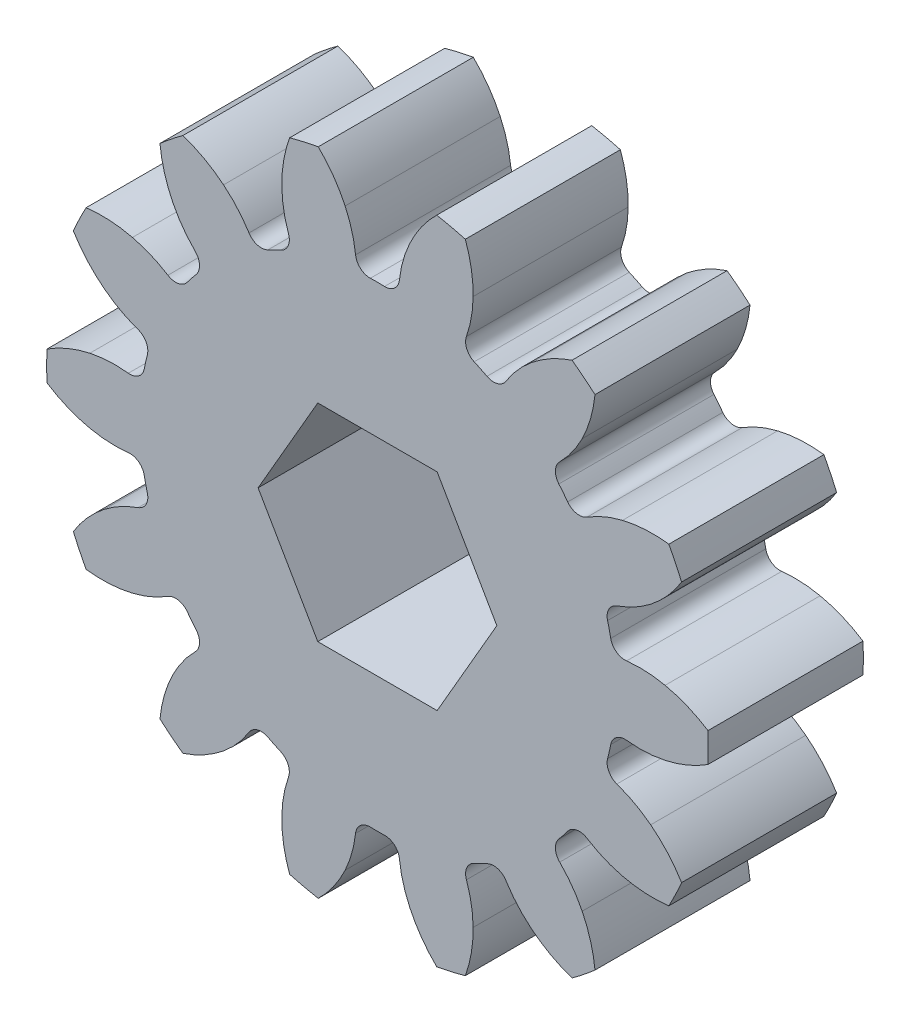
ISO-10303-21;
HEADER;
FILE_DESCRIPTION(('STEP AP214'),'2;1');
FILE_NAME('part.step','',(''),(''),'','','');
FILE_SCHEMA(('AUTOMOTIVE_DESIGN { 1 0 10303 214 1 1 1 1 }'));
ENDSEC;
DATA;
#1=APPLICATION_CONTEXT('core data for automotive mechanical design processes');
#2=APPLICATION_PROTOCOL_DEFINITION('international standard','automotive_design',2000,#1);
#3=PRODUCT_CONTEXT('',#1,'mechanical');
#4=PRODUCT('Part','Part','',(#3));
#5=PRODUCT_RELATED_PRODUCT_CATEGORY('part','',(#4));
#6=PRODUCT_DEFINITION_FORMATION('','',#4);
#7=PRODUCT_DEFINITION_CONTEXT('part definition',#1,'design');
#8=PRODUCT_DEFINITION('design','',#6,#7);
#9=PRODUCT_DEFINITION_SHAPE('','',#8);
#10=(LENGTH_UNIT() NAMED_UNIT(*) SI_UNIT(.MILLI.,.METRE.));
#11=(NAMED_UNIT(*) PLANE_ANGLE_UNIT() SI_UNIT($,.RADIAN.));
#12=(NAMED_UNIT(*) SI_UNIT($,.STERADIAN.) SOLID_ANGLE_UNIT());
#13=UNCERTAINTY_MEASURE_WITH_UNIT(LENGTH_MEASURE(1.E-05),#10,'distance_accuracy_value','');
#14=(GEOMETRIC_REPRESENTATION_CONTEXT(3) GLOBAL_UNCERTAINTY_ASSIGNED_CONTEXT((#13)) GLOBAL_UNIT_ASSIGNED_CONTEXT((#10,
#11,#12)) REPRESENTATION_CONTEXT('',''));
#15=CARTESIAN_POINT('',(0.,0.,0.));
#16=DIRECTION('',(0.,0.,1.));
#17=DIRECTION('',(1.,0.,0.));
#18=AXIS2_PLACEMENT_3D('',#15,#16,#17);
#19=CARTESIAN_POINT('',(0.,0.,4.7625));
#20=DIRECTION('',(0.,0.,-1.));
#21=DIRECTION('',(-1.,0.,0.));
#22=AXIS2_PLACEMENT_3D('',#19,#20,#21);
#23=CYLINDRICAL_SURFACE('',#22,20.32);
#24=CARTESIAN_POINT('',(0.,0.,4.7625));
#25=DIRECTION('',(0.,0.,1.));
#26=DIRECTION('',(1.,0.,0.));
#27=AXIS2_PLACEMENT_3D('',#24,#25,#26);
#28=CIRCLE('',#27,20.32);
#29=CARTESIAN_POINT('',(-13.3618660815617,-15.3089168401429,4.7625));
#30=VERTEX_POINT('',#29);
#31=CARTESIAN_POINT('',(-11.9517954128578,-16.4334106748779,4.7625));
#32=VERTEX_POINT('',#31);
#33=EDGE_CURVE('E63',#30,#32,#28,.T.);
#34=ORIENTED_EDGE('',*,*,#33,.F.);
#35=DIRECTION('',(0.,0.,1.));
#36=VECTOR('',#35,1.);
#37=CARTESIAN_POINT('',(-13.3618660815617,-15.3089168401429,-4.7625));
#38=LINE('',#37,#36);
#39=CARTESIAN_POINT('',(-13.3618660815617,-15.3089168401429,-4.7625));
#40=VERTEX_POINT('',#39);
#41=EDGE_CURVE('E903',#40,#30,#38,.T.);
#42=ORIENTED_EDGE('',*,*,#41,.F.);
#43=CARTESIAN_POINT('',(0.,0.,-4.7625));
#44=DIRECTION('',(0.,0.,1.));
#45=DIRECTION('',(1.,0.,0.));
#46=AXIS2_PLACEMENT_3D('',#43,#44,#45);
#47=CIRCLE('',#46,20.32);
#48=CARTESIAN_POINT('',(-11.9517954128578,-16.4334106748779,-4.7625));
#49=VERTEX_POINT('',#48);
#50=EDGE_CURVE('E2098',#40,#49,#47,.T.);
#51=ORIENTED_EDGE('',*,*,#50,.T.);
#52=DIRECTION('',(0.,0.,1.));
#53=VECTOR('',#52,1.);
#54=CARTESIAN_POINT('',(-11.9517954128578,-16.4334106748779,-4.7625));
#55=LINE('',#54,#53);
#56=EDGE_CURVE('E988',#49,#32,#55,.T.);
#57=ORIENTED_EDGE('',*,*,#56,.T.);
#58=EDGE_LOOP('',(#34,#42,#51,#57));
#59=FACE_BOUND('',#58,.T.);
#60=ADVANCED_FACE('F51',(#59),#23,.T.);
#61=CARTESIAN_POINT('',(-5.39633527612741,-19.5903538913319,4.7625));
#62=VERTEX_POINT('',#61);
#63=CARTESIAN_POINT('',(-3.63800591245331,-19.9916810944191,4.7625));
#64=VERTEX_POINT('',#63);
#65=EDGE_CURVE('E2038',#62,#64,#28,.T.);
#66=ORIENTED_EDGE('',*,*,#65,.F.);
#67=DIRECTION('',(0.,0.,1.));
#68=VECTOR('',#67,1.);
#69=CARTESIAN_POINT('',(-5.39633527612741,-19.5903538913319,-4.7625));
#70=LINE('',#69,#68);
#71=CARTESIAN_POINT('',(-5.39633527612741,-19.5903538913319,-4.7625));
#72=VERTEX_POINT('',#71);
#73=EDGE_CURVE('E987',#72,#62,#70,.T.);
#74=ORIENTED_EDGE('',*,*,#73,.F.);
#75=CARTESIAN_POINT('',(-3.63800591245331,-19.9916810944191,-4.7625));
#76=VERTEX_POINT('',#75);
#77=EDGE_CURVE('E2096',#72,#76,#47,.T.);
#78=ORIENTED_EDGE('',*,*,#77,.T.);
#79=DIRECTION('',(0.,0.,1.));
#80=VECTOR('',#79,1.);
#81=CARTESIAN_POINT('',(-3.63800591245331,-19.9916810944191,-4.7625));
#82=LINE('',#81,#80);
#83=EDGE_CURVE('E1073',#76,#64,#82,.T.);
#84=ORIENTED_EDGE('',*,*,#83,.T.);
#85=EDGE_LOOP('',(#66,#74,#78,#84));
#86=FACE_BOUND('',#85,.T.);
#87=ADVANCED_FACE('F2170',(#86),#23,.T.);
#88=CARTESIAN_POINT('',(3.63800591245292,-19.9916810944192,4.7625));
#89=VERTEX_POINT('',#88);
#90=CARTESIAN_POINT('',(5.39633527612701,-19.590353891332,4.7625));
#91=VERTEX_POINT('',#90);
#92=EDGE_CURVE('E2037',#89,#91,#28,.T.);
#93=ORIENTED_EDGE('',*,*,#92,.F.);
#94=DIRECTION('',(0.,0.,1.));
#95=VECTOR('',#94,1.);
#96=CARTESIAN_POINT('',(3.63800591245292,-19.9916810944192,-4.7625));
#97=LINE('',#96,#95);
#98=CARTESIAN_POINT('',(3.63800591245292,-19.9916810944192,-4.7625));
#99=VERTEX_POINT('',#98);
#100=EDGE_CURVE('E1070',#99,#89,#97,.T.);
#101=ORIENTED_EDGE('',*,*,#100,.F.);
#102=CARTESIAN_POINT('',(5.39633527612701,-19.590353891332,-4.7625));
#103=VERTEX_POINT('',#102);
#104=EDGE_CURVE('E2151',#99,#103,#47,.T.);
#105=ORIENTED_EDGE('',*,*,#104,.T.);
#106=DIRECTION('',(0.,0.,1.));
#107=VECTOR('',#106,1.);
#108=CARTESIAN_POINT('',(5.39633527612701,-19.590353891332,-4.7625));
#109=LINE('',#108,#107);
#110=EDGE_CURVE('E1155',#103,#91,#109,.T.);
#111=ORIENTED_EDGE('',*,*,#110,.T.);
#112=EDGE_LOOP('',(#93,#101,#105,#111));
#113=FACE_BOUND('',#112,.T.);
#114=ADVANCED_FACE('F2194',(#113),#23,.T.);
#115=CARTESIAN_POINT('',(11.9517954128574,-16.4334106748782,4.7625));
#116=VERTEX_POINT('',#115);
#117=CARTESIAN_POINT('',(13.3618660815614,-15.3089168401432,4.7625));
#118=VERTEX_POINT('',#117);
#119=EDGE_CURVE('E2044',#116,#118,#28,.T.);
#120=ORIENTED_EDGE('',*,*,#119,.F.);
#121=DIRECTION('',(0.,0.,1.));
#122=VECTOR('',#121,1.);
#123=CARTESIAN_POINT('',(11.9517954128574,-16.4334106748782,-4.7625));
#124=LINE('',#123,#122);
#125=CARTESIAN_POINT('',(11.9517954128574,-16.4334106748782,-4.7625));
#126=VERTEX_POINT('',#125);
#127=EDGE_CURVE('E1148',#126,#116,#124,.T.);
#128=ORIENTED_EDGE('',*,*,#127,.F.);
#129=CARTESIAN_POINT('',(13.3618660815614,-15.3089168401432,-4.7625));
#130=VERTEX_POINT('',#129);
#131=EDGE_CURVE('E2147',#126,#130,#47,.T.);
#132=ORIENTED_EDGE('',*,*,#131,.T.);
#133=DIRECTION('',(0.,0.,1.));
#134=VECTOR('',#133,1.);
#135=CARTESIAN_POINT('',(13.3618660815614,-15.3089168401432,-4.7625));
#136=LINE('',#135,#134);
#137=EDGE_CURVE('E1231',#130,#118,#136,.T.);
#138=ORIENTED_EDGE('',*,*,#137,.T.);
#139=EDGE_LOOP('',(#120,#128,#132,#138));
#140=FACE_BOUND('',#139,.T.);
#141=ADVANCED_FACE('F2222',(#140),#23,.T.);
#142=CARTESIAN_POINT('',(17.898385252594,-9.62030172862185,4.7625));
#143=VERTEX_POINT('',#142);
#144=CARTESIAN_POINT('',(18.6809154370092,-7.99536105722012,4.7625));
#145=VERTEX_POINT('',#144);
#146=EDGE_CURVE('E2046',#143,#145,#28,.T.);
#147=ORIENTED_EDGE('',*,*,#146,.F.);
#148=DIRECTION('',(0.,0.,1.));
#149=VECTOR('',#148,1.);
#150=CARTESIAN_POINT('',(17.898385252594,-9.62030172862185,-4.7625));
#151=LINE('',#150,#149);
#152=CARTESIAN_POINT('',(17.898385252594,-9.62030172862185,-4.7625));
#153=VERTEX_POINT('',#152);
#154=EDGE_CURVE('E1226',#153,#143,#151,.T.);
#155=ORIENTED_EDGE('',*,*,#154,.F.);
#156=CARTESIAN_POINT('',(18.6809154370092,-7.99536105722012,-4.7625));
#157=VERTEX_POINT('',#156);
#158=EDGE_CURVE('E2145',#153,#157,#47,.T.);
#159=ORIENTED_EDGE('',*,*,#158,.T.);
#160=DIRECTION('',(0.,0.,1.));
#161=VECTOR('',#160,1.);
#162=CARTESIAN_POINT('',(18.6809154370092,-7.99536105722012,-4.7625));
#163=LINE('',#162,#161);
#164=EDGE_CURVE('E1314',#157,#145,#163,.T.);
#165=ORIENTED_EDGE('',*,*,#164,.T.);
#166=EDGE_LOOP('',(#147,#155,#159,#165));
#167=FACE_BOUND('',#166,.T.);
#168=ADVANCED_FACE('F2250',(#167),#23,.T.);
#169=CARTESIAN_POINT('',(20.2999803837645,-0.901774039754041,4.7625));
#170=VERTEX_POINT('',#169);
#171=CARTESIAN_POINT('',(20.2999803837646,0.901774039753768,4.7625));
#172=VERTEX_POINT('',#171);
#173=EDGE_CURVE('E2051',#170,#172,#28,.T.);
#174=ORIENTED_EDGE('',*,*,#173,.F.);
#175=DIRECTION('',(0.,0.,1.));
#176=VECTOR('',#175,1.);
#177=CARTESIAN_POINT('',(20.2999803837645,-0.901774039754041,-4.7625));
#178=LINE('',#177,#176);
#179=CARTESIAN_POINT('',(20.2999803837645,-0.901774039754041,-4.7625));
#180=VERTEX_POINT('',#179);
#181=EDGE_CURVE('E1308',#180,#170,#178,.T.);
#182=ORIENTED_EDGE('',*,*,#181,.F.);
#183=CARTESIAN_POINT('',(20.2999803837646,0.901774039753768,-4.7625));
#184=VERTEX_POINT('',#183);
#185=EDGE_CURVE('E2137',#180,#184,#47,.T.);
#186=ORIENTED_EDGE('',*,*,#185,.T.);
#187=DIRECTION('',(0.,0.,1.));
#188=VECTOR('',#187,1.);
#189=CARTESIAN_POINT('',(20.2999803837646,0.901774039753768,-4.7625));
#190=LINE('',#189,#188);
#191=EDGE_CURVE('E1393',#184,#172,#190,.T.);
#192=ORIENTED_EDGE('',*,*,#191,.T.);
#193=EDGE_LOOP('',(#174,#182,#186,#192));
#194=FACE_BOUND('',#193,.T.);
#195=ADVANCED_FACE('F2271',(#194),#23,.T.);
#196=CARTESIAN_POINT('',(18.6809154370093,7.99536105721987,4.7625));
#197=VERTEX_POINT('',#196);
#198=CARTESIAN_POINT('',(17.8983852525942,9.62030172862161,4.7625));
#199=VERTEX_POINT('',#198);
#200=EDGE_CURVE('E2058',#197,#199,#28,.T.);
#201=ORIENTED_EDGE('',*,*,#200,.F.);
#202=DIRECTION('',(0.,0.,1.));
#203=VECTOR('',#202,1.);
#204=CARTESIAN_POINT('',(18.6809154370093,7.99536105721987,-4.7625));
#205=LINE('',#204,#203);
#206=CARTESIAN_POINT('',(18.6809154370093,7.99536105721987,-4.7625));
#207=VERTEX_POINT('',#206);
#208=EDGE_CURVE('E1392',#207,#197,#205,.T.);
#209=ORIENTED_EDGE('',*,*,#208,.F.);
#210=CARTESIAN_POINT('',(17.8983852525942,9.62030172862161,-4.7625));
#211=VERTEX_POINT('',#210);
#212=EDGE_CURVE('E2129',#207,#211,#47,.T.);
#213=ORIENTED_EDGE('',*,*,#212,.T.);
#214=DIRECTION('',(0.,0.,1.));
#215=VECTOR('',#214,1.);
#216=CARTESIAN_POINT('',(17.8983852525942,9.62030172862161,-4.7625));
#217=LINE('',#216,#215);
#218=EDGE_CURVE('E1476',#211,#199,#217,.T.);
#219=ORIENTED_EDGE('',*,*,#218,.T.);
#220=EDGE_LOOP('',(#201,#209,#213,#219));
#221=FACE_BOUND('',#220,.T.);
#222=ADVANCED_FACE('F2300',(#221),#23,.T.);
#223=CARTESIAN_POINT('',(13.3618660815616,15.308916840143,4.7625));
#224=VERTEX_POINT('',#223);
#225=CARTESIAN_POINT('',(11.9517954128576,16.433410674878,4.7625));
#226=VERTEX_POINT('',#225);
#227=EDGE_CURVE('E2063',#224,#226,#28,.T.);
#228=ORIENTED_EDGE('',*,*,#227,.F.);
#229=DIRECTION('',(0.,0.,1.));
#230=VECTOR('',#229,1.);
#231=CARTESIAN_POINT('',(13.3618660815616,15.308916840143,-4.7625));
#232=LINE('',#231,#230);
#233=CARTESIAN_POINT('',(13.3618660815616,15.308916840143,-4.7625));
#234=VERTEX_POINT('',#233);
#235=EDGE_CURVE('E1475',#234,#224,#232,.T.);
#236=ORIENTED_EDGE('',*,*,#235,.F.);
#237=CARTESIAN_POINT('',(11.9517954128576,16.433410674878,-4.7625));
#238=VERTEX_POINT('',#237);
#239=EDGE_CURVE('E2122',#234,#238,#47,.T.);
#240=ORIENTED_EDGE('',*,*,#239,.T.);
#241=DIRECTION('',(0.,0.,1.));
#242=VECTOR('',#241,1.);
#243=CARTESIAN_POINT('',(11.9517954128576,16.433410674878,-4.7625));
#244=LINE('',#243,#242);
#245=EDGE_CURVE('E1560',#238,#226,#244,.T.);
#246=ORIENTED_EDGE('',*,*,#245,.T.);
#247=EDGE_LOOP('',(#228,#236,#240,#246));
#248=FACE_BOUND('',#247,.T.);
#249=ADVANCED_FACE('F2324',(#248),#23,.T.);
#250=CARTESIAN_POINT('',(5.39633527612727,19.5903538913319,4.7625));
#251=VERTEX_POINT('',#250);
#252=CARTESIAN_POINT('',(3.63800591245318,19.9916810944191,4.7625));
#253=VERTEX_POINT('',#252);
#254=EDGE_CURVE('E2067',#251,#253,#28,.T.);
#255=ORIENTED_EDGE('',*,*,#254,.F.);
#256=DIRECTION('',(0.,0.,1.));
#257=VECTOR('',#256,1.);
#258=CARTESIAN_POINT('',(5.39633527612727,19.5903538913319,-4.7625));
#259=LINE('',#258,#257);
#260=CARTESIAN_POINT('',(5.39633527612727,19.5903538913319,-4.7625));
#261=VERTEX_POINT('',#260);
#262=EDGE_CURVE('E1554',#261,#251,#259,.T.);
#263=ORIENTED_EDGE('',*,*,#262,.F.);
#264=CARTESIAN_POINT('',(3.63800591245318,19.9916810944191,-4.7625));
#265=VERTEX_POINT('',#264);
#266=EDGE_CURVE('E2116',#261,#265,#47,.T.);
#267=ORIENTED_EDGE('',*,*,#266,.T.);
#268=DIRECTION('',(0.,0.,1.));
#269=VECTOR('',#268,1.);
#270=CARTESIAN_POINT('',(3.63800591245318,19.9916810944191,-4.7625));
#271=LINE('',#270,#269);
#272=EDGE_CURVE('E1636',#265,#253,#271,.T.);
#273=ORIENTED_EDGE('',*,*,#272,.T.);
#274=EDGE_LOOP('',(#255,#263,#267,#273));
#275=FACE_BOUND('',#274,.T.);
#276=ADVANCED_FACE('F2352',(#275),#23,.T.);
#277=CARTESIAN_POINT('',(-3.63800591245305,19.9916810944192,4.7625));
#278=VERTEX_POINT('',#277);
#279=CARTESIAN_POINT('',(-5.39633527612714,19.590353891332,4.7625));
#280=VERTEX_POINT('',#279);
#281=EDGE_CURVE('E2074',#278,#280,#28,.T.);
#282=ORIENTED_EDGE('',*,*,#281,.F.);
#283=DIRECTION('',(0.,0.,1.));
#284=VECTOR('',#283,1.);
#285=CARTESIAN_POINT('',(-3.63800591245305,19.9916810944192,-4.7625));
#286=LINE('',#285,#284);
#287=CARTESIAN_POINT('',(-3.63800591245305,19.9916810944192,-4.7625));
#288=VERTEX_POINT('',#287);
#289=EDGE_CURVE('E1631',#288,#278,#286,.T.);
#290=ORIENTED_EDGE('',*,*,#289,.F.);
#291=CARTESIAN_POINT('',(-5.39633527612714,19.590353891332,-4.7625));
#292=VERTEX_POINT('',#291);
#293=EDGE_CURVE('E2112',#288,#292,#47,.T.);
#294=ORIENTED_EDGE('',*,*,#293,.T.);
#295=DIRECTION('',(0.,0.,1.));
#296=VECTOR('',#295,1.);
#297=CARTESIAN_POINT('',(-5.39633527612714,19.590353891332,-4.7625));
#298=LINE('',#297,#296);
#299=EDGE_CURVE('E1716',#292,#280,#298,.T.);
#300=ORIENTED_EDGE('',*,*,#299,.T.);
#301=EDGE_LOOP('',(#282,#290,#294,#300));
#302=FACE_BOUND('',#301,.T.);
#303=ADVANCED_FACE('F2380',(#302),#23,.T.);
#304=CARTESIAN_POINT('',(-11.9517954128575,16.4334106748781,4.7625));
#305=VERTEX_POINT('',#304);
#306=CARTESIAN_POINT('',(-13.3618660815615,15.3089168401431,4.7625));
#307=VERTEX_POINT('',#306);
#308=EDGE_CURVE('E2076',#305,#307,#28,.T.);
#309=ORIENTED_EDGE('',*,*,#308,.F.);
#310=DIRECTION('',(0.,0.,1.));
#311=VECTOR('',#310,1.);
#312=CARTESIAN_POINT('',(-11.9517954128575,16.4334106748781,-4.7625));
#313=LINE('',#312,#311);
#314=CARTESIAN_POINT('',(-11.9517954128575,16.4334106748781,-4.7625));
#315=VERTEX_POINT('',#314);
#316=EDGE_CURVE('E1711',#315,#305,#313,.T.);
#317=ORIENTED_EDGE('',*,*,#316,.F.);
#318=CARTESIAN_POINT('',(-13.3618660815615,15.3089168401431,-4.7625));
#319=VERTEX_POINT('',#318);
#320=EDGE_CURVE('E2107',#315,#319,#47,.T.);
#321=ORIENTED_EDGE('',*,*,#320,.T.);
#322=DIRECTION('',(0.,0.,1.));
#323=VECTOR('',#322,1.);
#324=CARTESIAN_POINT('',(-13.3618660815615,15.3089168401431,-4.7625));
#325=LINE('',#324,#323);
#326=EDGE_CURVE('E1799',#319,#307,#325,.T.);
#327=ORIENTED_EDGE('',*,*,#326,.T.);
#328=EDGE_LOOP('',(#309,#317,#321,#327));
#329=FACE_BOUND('',#328,.T.);
#330=ADVANCED_FACE('F2401',(#329),#23,.T.);
#331=CARTESIAN_POINT('',(-17.8983852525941,9.62030172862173,4.7625));
#332=VERTEX_POINT('',#331);
#333=CARTESIAN_POINT('',(-18.6809154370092,7.99536105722,4.7625));
#334=VERTEX_POINT('',#333);
#335=EDGE_CURVE('E2082',#332,#334,#28,.T.);
#336=ORIENTED_EDGE('',*,*,#335,.F.);
#337=DIRECTION('',(0.,0.,1.));
#338=VECTOR('',#337,1.);
#339=CARTESIAN_POINT('',(-17.8983852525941,9.62030172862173,-4.7625));
#340=LINE('',#339,#338);
#341=CARTESIAN_POINT('',(-17.8983852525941,9.62030172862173,-4.7625));
#342=VERTEX_POINT('',#341);
#343=EDGE_CURVE('E1796',#342,#332,#340,.T.);
#344=ORIENTED_EDGE('',*,*,#343,.F.);
#345=CARTESIAN_POINT('',(-18.6809154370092,7.99536105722,-4.7625));
#346=VERTEX_POINT('',#345);
#347=EDGE_CURVE('E2099',#342,#346,#47,.T.);
#348=ORIENTED_EDGE('',*,*,#347,.T.);
#349=DIRECTION('',(0.,0.,1.));
#350=VECTOR('',#349,1.);
#351=CARTESIAN_POINT('',(-18.6809154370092,7.99536105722,-4.7625));
#352=LINE('',#351,#350);
#353=EDGE_CURVE('E1883',#346,#334,#352,.T.);
#354=ORIENTED_EDGE('',*,*,#353,.T.);
#355=EDGE_LOOP('',(#336,#344,#348,#354));
#356=FACE_BOUND('',#355,.T.);
#357=ADVANCED_FACE('F2430',(#356),#23,.T.);
#358=CARTESIAN_POINT('',(-20.2999803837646,0.901774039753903,4.7625));
#359=VERTEX_POINT('',#358);
#360=CARTESIAN_POINT('',(-20.2999803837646,-0.90177403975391,4.7625));
#361=VERTEX_POINT('',#360);
#362=EDGE_CURVE('E65',#359,#361,#28,.T.);
#363=ORIENTED_EDGE('',*,*,#362,.F.);
#364=DIRECTION('',(0.,0.,1.));
#365=VECTOR('',#364,1.);
#366=CARTESIAN_POINT('',(-20.2999803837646,0.901774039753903,-4.7625));
#367=LINE('',#366,#365);
#368=CARTESIAN_POINT('',(-20.2999803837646,0.901774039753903,-4.7625));
#369=VERTEX_POINT('',#368);
#370=EDGE_CURVE('E1880',#369,#359,#367,.T.);
#371=ORIENTED_EDGE('',*,*,#370,.F.);
#372=CARTESIAN_POINT('',(-20.2999803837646,-0.90177403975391,-4.7625));
#373=VERTEX_POINT('',#372);
#374=EDGE_CURVE('E1962',#369,#373,#47,.T.);
#375=ORIENTED_EDGE('',*,*,#374,.T.);
#376=DIRECTION('',(0.,0.,1.));
#377=VECTOR('',#376,1.);
#378=CARTESIAN_POINT('',(-20.2999803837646,-0.90177403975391,-4.7625));
#379=LINE('',#378,#377);
#380=EDGE_CURVE('E1965',#373,#361,#379,.T.);
#381=ORIENTED_EDGE('',*,*,#380,.T.);
#382=EDGE_LOOP('',(#363,#371,#375,#381));
#383=FACE_BOUND('',#382,.T.);
#384=ADVANCED_FACE('F2454',(#383),#23,.T.);
#385=CARTESIAN_POINT('',(-18.6809154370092,-7.99536105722,-4.7625));
#386=VERTEX_POINT('',#385);
#387=CARTESIAN_POINT('',(-17.8983852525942,-9.62030172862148,-4.7625));
#388=VERTEX_POINT('',#387);
#389=EDGE_CURVE('E54',#386,#388,#47,.T.);
#390=ORIENTED_EDGE('',*,*,#389,.T.);
#391=DIRECTION('',(0.,0.,1.));
#392=VECTOR('',#391,1.);
#393=CARTESIAN_POINT('',(-17.8983852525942,-9.62030172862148,-4.7625));
#394=LINE('',#393,#392);
#395=CARTESIAN_POINT('',(-17.8983852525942,-9.62030172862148,4.7625));
#396=VERTEX_POINT('',#395);
#397=EDGE_CURVE('E907',#388,#396,#394,.T.);
#398=ORIENTED_EDGE('',*,*,#397,.T.);
#399=CARTESIAN_POINT('',(-18.6809154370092,-7.99536105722,4.7625));
#400=VERTEX_POINT('',#399);
#401=EDGE_CURVE('E11',#400,#396,#28,.T.);
#402=ORIENTED_EDGE('',*,*,#401,.F.);
#403=DIRECTION('',(0.,0.,1.));
#404=VECTOR('',#403,1.);
#405=CARTESIAN_POINT('',(-18.6809154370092,-7.99536105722,-4.7625));
#406=LINE('',#405,#404);
#407=EDGE_CURVE('E1959',#386,#400,#406,.T.);
#408=ORIENTED_EDGE('',*,*,#407,.F.);
#409=EDGE_LOOP('',(#390,#398,#402,#408));
#410=FACE_BOUND('',#409,.T.);
#411=ADVANCED_FACE('F52',(#410),#23,.T.);
#412=CARTESIAN_POINT('',(0.,0.,4.7625));
#413=DIRECTION('',(0.,0.,1.));
#414=DIRECTION('',(1.,0.,0.));
#415=AXIS2_PLACEMENT_3D('',#412,#413,#414);
#416=PLANE('',#415);
#417=DIRECTION('',(-1.,0.,0.));
#418=VECTOR('',#417,1.);
#419=CARTESIAN_POINT('',(3.66617420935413,-6.35,4.7625));
#420=LINE('',#419,#418);
#421=CARTESIAN_POINT('',(3.66617420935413,-6.35,4.7625));
#422=VERTEX_POINT('',#421);
#423=CARTESIAN_POINT('',(-3.66617420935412,-6.35,4.7625));
#424=VERTEX_POINT('',#423);
#425=EDGE_CURVE('E783',#422,#424,#420,.T.);
#426=ORIENTED_EDGE('',*,*,#425,.T.);
#427=DIRECTION('',(-0.5,0.866025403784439,0.));
#428=VECTOR('',#427,1.);
#429=CARTESIAN_POINT('',(-3.66617420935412,-6.35,4.7625));
#430=LINE('',#429,#428);
#431=CARTESIAN_POINT('',(-7.33234841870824,0.,4.7625));
#432=VERTEX_POINT('',#431);
#433=EDGE_CURVE('E792',#424,#432,#430,.T.);
#434=ORIENTED_EDGE('',*,*,#433,.T.);
#435=DIRECTION('',(0.5,0.866025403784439,0.));
#436=VECTOR('',#435,1.);
#437=CARTESIAN_POINT('',(-7.33234841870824,0.,4.7625));
#438=LINE('',#437,#436);
#439=CARTESIAN_POINT('',(-3.66617420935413,6.35,4.7625));
#440=VERTEX_POINT('',#439);
#441=EDGE_CURVE('E70',#432,#440,#438,.T.);
#442=ORIENTED_EDGE('',*,*,#441,.T.);
#443=DIRECTION('',(1.,0.,0.));
#444=VECTOR('',#443,1.);
#445=CARTESIAN_POINT('',(-3.66617420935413,6.35,4.7625));
#446=LINE('',#445,#444);
#447=CARTESIAN_POINT('',(3.66617420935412,6.35,4.7625));
#448=VERTEX_POINT('',#447);
#449=EDGE_CURVE('E808',#440,#448,#446,.T.);
#450=ORIENTED_EDGE('',*,*,#449,.T.);
#451=DIRECTION('',(0.5,-0.866025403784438,0.));
#452=VECTOR('',#451,1.);
#453=CARTESIAN_POINT('',(3.66617420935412,6.35,4.7625));
#454=LINE('',#453,#452);
#455=CARTESIAN_POINT('',(7.33234841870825,0.,4.7625));
#456=VERTEX_POINT('',#455);
#457=EDGE_CURVE('E815',#448,#456,#454,.T.);
#458=ORIENTED_EDGE('',*,*,#457,.T.);
#459=DIRECTION('',(-0.5,-0.866025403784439,0.));
#460=VECTOR('',#459,1.);
#461=CARTESIAN_POINT('',(7.33234841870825,0.,4.7625));
#462=LINE('',#461,#460);
#463=EDGE_CURVE('E789',#456,#422,#462,.T.);
#464=ORIENTED_EDGE('',*,*,#463,.T.);
#465=EDGE_LOOP('',(#426,#434,#442,#450,#458,#464));
#466=FACE_BOUND('',#465,.T.);
#467=CARTESIAN_POINT('',(-5.42102749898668,-16.1053688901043,4.7625));
#468=DIRECTION('',(0.,0.,-1.));
#469=DIRECTION('',(-0.900968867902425,-0.433883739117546,0.));
#470=AXIS2_PLACEMENT_3D('',#467,#468,#469);
#471=CIRCLE('',#470,7.98068);
#472=CARTESIAN_POINT('',(-12.575518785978,-12.5691975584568,4.7625));
#473=VERTEX_POINT('',#472);
#474=EDGE_CURVE('E839',#30,#473,#471,.T.);
#475=ORIENTED_EDGE('',*,*,#474,.F.);
#476=ORIENTED_EDGE('',*,*,#33,.T.);
#477=CARTESIAN_POINT('',(-14.4952815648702,-8.86889274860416,4.7625));
#478=DIRECTION('',(0.,0.,-1.));
#479=DIRECTION('',(0.623489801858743,0.781831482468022,0.));
#480=AXIS2_PLACEMENT_3D('',#477,#478,#479);
#481=CIRCLE('',#480,7.98067999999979);
#482=CARTESIAN_POINT('',(-9.45574534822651,-15.0571338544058,4.7625));
#483=VERTEX_POINT('',#482);
#484=EDGE_CURVE('E931',#483,#32,#481,.T.);
#485=ORIENTED_EDGE('',*,*,#484,.F.);
#486=CARTESIAN_POINT('',(-14.0122248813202,-9.46205670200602,4.7625));
#487=DIRECTION('',(0.,0.,-1.));
#488=DIRECTION('',(0.623489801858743,0.781831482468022,0.));
#489=AXIS2_PLACEMENT_3D('',#486,#487,#488);
#490=CIRCLE('',#489,7.21570468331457);
#491=CARTESIAN_POINT('',(-7.89060791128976,-13.2820304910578,4.7625));
#492=VERTEX_POINT('',#491);
#493=EDGE_CURVE('E980',#492,#483,#490,.T.);
#494=ORIENTED_EDGE('',*,*,#493,.F.);
#495=CARTESIAN_POINT('',(-7.13640333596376,-13.7526645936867,4.7625));
#496=DIRECTION('',(0.,0.,1.));
#497=DIRECTION('',(-0.623489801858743,-0.781831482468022,0.));
#498=AXIS2_PLACEMENT_3D('',#495,#496,#497);
#499=CIRCLE('',#498,0.888999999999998);
#500=CARTESIAN_POINT('',(-6.72693757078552,-12.9635772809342,4.7625));
#501=VERTEX_POINT('',#500);
#502=EDGE_CURVE('E974',#501,#492,#499,.T.);
#503=ORIENTED_EDGE('',*,*,#502,.F.);
#504=CARTESIAN_POINT('',(0.,0.,4.7625));
#505=DIRECTION('',(0.,0.,-1.));
#506=DIRECTION('',(-0.623489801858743,-0.781831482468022,0.));
#507=AXIS2_PLACEMENT_3D('',#504,#505,#506);
#508=CIRCLE('',#507,14.605);
#509=CARTESIAN_POINT('',(-5.94115587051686,-13.3419898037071,4.7625));
#510=VERTEX_POINT('',#509);
#511=EDGE_CURVE('E973',#510,#501,#508,.T.);
#512=ORIENTED_EDGE('',*,*,#511,.F.);
#513=CARTESIAN_POINT('',(-6.30279144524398,-14.1541109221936,4.7625));
#514=DIRECTION('',(0.,0.,1.));
#515=DIRECTION('',(0.623489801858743,0.781831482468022,0.));
#516=AXIS2_PLACEMENT_3D('',#513,#514,#515);
#517=CIRCLE('',#516,0.888999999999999);
#518=CARTESIAN_POINT('',(-5.46459602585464,-14.4503362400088,4.7625));
#519=VERTEX_POINT('',#518);
#520=EDGE_CURVE('E970',#519,#510,#517,.T.);
#521=ORIENTED_EDGE('',*,*,#520,.F.);
#522=CARTESIAN_POINT('',(1.33874549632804,-16.8546944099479,4.7625));
#523=DIRECTION('',(0.,0.,-1.));
#524=DIRECTION('',(-0.623489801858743,-0.781831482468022,0.));
#525=AXIS2_PLACEMENT_3D('',#522,#523,#524);
#526=CIRCLE('',#525,7.21570468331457);
#527=CARTESIAN_POINT('',(-5.87658048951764,-16.7807688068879,4.7625));
#528=VERTEX_POINT('',#527);
#529=EDGE_CURVE('E962',#528,#519,#526,.T.);
#530=ORIENTED_EDGE('',*,*,#529,.F.);
#531=CARTESIAN_POINT('',(2.10368066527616,-16.8625316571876,4.7625));
#532=DIRECTION('',(0.,0.,-1.));
#533=DIRECTION('',(-0.623489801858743,-0.781831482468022,0.));
#534=AXIS2_PLACEMENT_3D('',#531,#532,#533);
#535=CIRCLE('',#534,7.98068);
#536=EDGE_CURVE('E906',#62,#528,#535,.T.);
#537=ORIENTED_EDGE('',*,*,#536,.F.);
#538=ORIENTED_EDGE('',*,*,#65,.T.);
#539=CARTESIAN_POINT('',(-9.21172907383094,-14.2798632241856,4.7625));
#540=DIRECTION('',(0.,0.,-1.));
#541=DIRECTION('',(0.222520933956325,0.974927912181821,0.));
#542=AXIS2_PLACEMENT_3D('',#539,#540,#541);
#543=CIRCLE('',#542,7.98067999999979);
#544=CARTESIAN_POINT('',(-1.98628664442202,-17.6687029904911,4.7625));
#545=VERTEX_POINT('',#544);
#546=EDGE_CURVE('E1016',#545,#64,#543,.T.);
#547=ORIENTED_EDGE('',*,*,#546,.F.);
#548=CARTESIAN_POINT('',(-8.51914584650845,-14.6046950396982,4.7625));
#549=DIRECTION('',(0.,0.,-1.));
#550=DIRECTION('',(0.222520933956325,0.974927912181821,0.));
#551=AXIS2_PLACEMENT_3D('',#548,#549,#550);
#552=CIRCLE('',#551,7.21570468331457);
#553=CARTESIAN_POINT('',(-1.346335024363,-15.3903024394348,4.7625));
#554=VERTEX_POINT('',#553);
#555=EDGE_CURVE('E1059',#554,#545,#552,.T.);
#556=ORIENTED_EDGE('',*,*,#555,.F.);
#557=CARTESIAN_POINT('',(-0.462619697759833,-15.4870920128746,4.7625));
#558=DIRECTION('',(0.,0.,1.));
#559=DIRECTION('',(-0.222520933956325,-0.974927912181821,0.));
#560=AXIS2_PLACEMENT_3D('',#557,#558,#559);
#561=CIRCLE('',#560,0.888999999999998);
#562=CARTESIAN_POINT('',(-0.436075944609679,-14.5984883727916,4.7625));
#563=VERTEX_POINT('',#562);
#564=EDGE_CURVE('E1058',#563,#554,#561,.T.);
#565=ORIENTED_EDGE('',*,*,#564,.F.);
#566=CARTESIAN_POINT('',(0.,0.,4.7625));
#567=DIRECTION('',(0.,0.,-1.));
#568=DIRECTION('',(-0.222520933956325,-0.974927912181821,0.));
#569=AXIS2_PLACEMENT_3D('',#566,#567,#568);
#570=CIRCLE('',#569,14.605);
#571=CARTESIAN_POINT('',(0.43607594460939,-14.5984883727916,4.7625));
#572=VERTEX_POINT('',#571);
#573=EDGE_CURVE('E1055',#572,#563,#570,.T.);
#574=ORIENTED_EDGE('',*,*,#573,.F.);
#575=CARTESIAN_POINT('',(0.462619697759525,-15.4870920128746,4.7625));
#576=DIRECTION('',(0.,0.,1.));
#577=DIRECTION('',(0.222520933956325,0.974927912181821,0.));
#578=AXIS2_PLACEMENT_3D('',#575,#576,#577);
#579=CIRCLE('',#578,0.888999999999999);
#580=CARTESIAN_POINT('',(1.34633502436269,-15.3903024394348,4.7625));
#581=VERTEX_POINT('',#580);
#582=EDGE_CURVE('E1049',#581,#572,#579,.T.);
#583=ORIENTED_EDGE('',*,*,#582,.F.);
#584=CARTESIAN_POINT('',(8.51914584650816,-14.6046950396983,4.7625));
#585=DIRECTION('',(0.,0.,-1.));
#586=DIRECTION('',(-0.222520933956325,-0.974927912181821,0.));
#587=AXIS2_PLACEMENT_3D('',#584,#585,#586);
#588=CIRCLE('',#587,7.21570468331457);
#589=CARTESIAN_POINT('',(1.98628664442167,-17.6687029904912,4.7625));
#590=VERTEX_POINT('',#589);
#591=EDGE_CURVE('E1045',#590,#581,#588,.T.);
#592=ORIENTED_EDGE('',*,*,#591,.F.);
#593=CARTESIAN_POINT('',(9.21172907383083,-14.2798632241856,4.7625));
#594=DIRECTION('',(0.,0.,-1.));
#595=DIRECTION('',(-0.222520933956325,-0.974927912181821,0.));
#596=AXIS2_PLACEMENT_3D('',#593,#594,#595);
#597=CIRCLE('',#596,7.98068);
#598=EDGE_CURVE('E989',#89,#590,#597,.T.);
#599=ORIENTED_EDGE('',*,*,#598,.F.);
#600=ORIENTED_EDGE('',*,*,#92,.T.);
#601=CARTESIAN_POINT('',(-2.10368066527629,-16.8625316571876,4.7625));
#602=DIRECTION('',(0.,0.,-1.));
#603=DIRECTION('',(-0.222520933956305,0.974927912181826,0.));
#604=AXIS2_PLACEMENT_3D('',#601,#602,#603);
#605=CIRCLE('',#604,7.98067999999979);
#606=CARTESIAN_POINT('',(5.87658048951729,-16.780768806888,4.7625));
#607=VERTEX_POINT('',#606);
#608=EDGE_CURVE('E1100',#607,#91,#605,.T.);
#609=ORIENTED_EDGE('',*,*,#608,.F.);
#610=CARTESIAN_POINT('',(-1.33874549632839,-16.8546944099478,4.7625));
#611=DIRECTION('',(0.,0.,-1.));
#612=DIRECTION('',(-0.222520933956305,0.974927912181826,0.));
#613=AXIS2_PLACEMENT_3D('',#610,#611,#612);
#614=CIRCLE('',#613,7.21570468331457);
#615=CARTESIAN_POINT('',(5.46459602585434,-14.4503362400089,4.7625));
#616=VERTEX_POINT('',#615);
#617=EDGE_CURVE('E1143',#616,#607,#614,.T.);
#618=ORIENTED_EDGE('',*,*,#617,.F.);
#619=CARTESIAN_POINT('',(6.30279144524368,-14.1541109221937,4.7625));
#620=DIRECTION('',(0.,0.,1.));
#621=DIRECTION('',(0.222520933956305,-0.974927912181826,0.));
#622=AXIS2_PLACEMENT_3D('',#619,#620,#621);
#623=CIRCLE('',#622,0.888999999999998);
#624=CARTESIAN_POINT('',(5.94115587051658,-13.3419898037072,4.7625));
#625=VERTEX_POINT('',#624);
#626=EDGE_CURVE('E1137',#625,#616,#623,.T.);
#627=ORIENTED_EDGE('',*,*,#626,.F.);
#628=CARTESIAN_POINT('',(0.,0.,4.7625));
#629=DIRECTION('',(0.,0.,-1.));
#630=DIRECTION('',(0.222520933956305,-0.974927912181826,0.));
#631=AXIS2_PLACEMENT_3D('',#628,#629,#630);
#632=CIRCLE('',#631,14.605);
#633=CARTESIAN_POINT('',(6.72693757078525,-12.9635772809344,4.7625));
#634=VERTEX_POINT('',#633);
#635=EDGE_CURVE('E1134',#634,#625,#632,.T.);
#636=ORIENTED_EDGE('',*,*,#635,.F.);
#637=CARTESIAN_POINT('',(7.13640333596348,-13.7526645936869,4.7625));
#638=DIRECTION('',(0.,0.,1.));
#639=DIRECTION('',(-0.222520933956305,0.974927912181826,0.));
#640=AXIS2_PLACEMENT_3D('',#637,#638,#639);
#641=CIRCLE('',#640,0.888999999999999);
#642=CARTESIAN_POINT('',(7.89060791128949,-13.282030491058,4.7625));
#643=VERTEX_POINT('',#642);
#644=EDGE_CURVE('E1130',#643,#634,#641,.T.);
#645=ORIENTED_EDGE('',*,*,#644,.F.);
#646=CARTESIAN_POINT('',(14.01222488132,-9.46205670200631,4.7625));
#647=DIRECTION('',(0.,0.,-1.));
#648=DIRECTION('',(0.222520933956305,-0.974927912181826,0.));
#649=AXIS2_PLACEMENT_3D('',#646,#647,#648);
#650=CIRCLE('',#649,7.21570468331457);
#651=CARTESIAN_POINT('',(9.45574534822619,-15.057133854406,4.7625));
#652=VERTEX_POINT('',#651);
#653=EDGE_CURVE('E1124',#652,#643,#650,.T.);
#654=ORIENTED_EDGE('',*,*,#653,.F.);
#655=CARTESIAN_POINT('',(14.4952815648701,-8.86889274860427,4.7625));
#656=DIRECTION('',(0.,0.,-1.));
#657=DIRECTION('',(0.222520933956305,-0.974927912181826,0.));
#658=AXIS2_PLACEMENT_3D('',#655,#656,#657);
#659=CIRCLE('',#658,7.98068);
#660=EDGE_CURVE('E1068',#116,#652,#659,.T.);
#661=ORIENTED_EDGE('',*,*,#660,.F.);
#662=ORIENTED_EDGE('',*,*,#119,.T.);
#663=CARTESIAN_POINT('',(5.42102749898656,-16.1053688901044,4.7625));
#664=DIRECTION('',(0.,0.,-1.));
#665=DIRECTION('',(-0.623489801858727,0.781831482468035,0.));
#666=AXIS2_PLACEMENT_3D('',#663,#664,#665);
#667=CIRCLE('',#666,7.98067999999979);
#668=CARTESIAN_POINT('',(12.5755187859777,-12.569197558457,4.7625));
#669=VERTEX_POINT('',#668);
#670=EDGE_CURVE('E1179',#669,#118,#667,.T.);
#671=ORIENTED_EDGE('',*,*,#670,.F.);
#672=CARTESIAN_POINT('',(6.10680981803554,-15.7664148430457,4.7625));
#673=DIRECTION('',(0.,0.,-1.));
#674=DIRECTION('',(-0.623489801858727,0.781831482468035,0.));
#675=AXIS2_PLACEMENT_3D('',#672,#673,#674);
#676=CIRCLE('',#675,7.21570468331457);
#677=CARTESIAN_POINT('',(11.1931968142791,-10.6483037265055,4.7625));
#678=VERTEX_POINT('',#677);
#679=EDGE_CURVE('E1225',#678,#669,#676,.T.);
#680=ORIENTED_EDGE('',*,*,#679,.F.);
#681=CARTESIAN_POINT('',(11.8198574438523,-10.0177345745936,4.7625));
#682=DIRECTION('',(0.,0.,1.));
#683=DIRECTION('',(0.623489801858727,-0.781831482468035,0.));
#684=AXIS2_PLACEMENT_3D('',#681,#682,#683);
#685=CIRCLE('',#684,0.888999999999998);
#686=CARTESIAN_POINT('',(11.141668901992,-9.4429465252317,4.7625));
#687=VERTEX_POINT('',#686);
#688=EDGE_CURVE('E1218',#687,#678,#685,.T.);
#689=ORIENTED_EDGE('',*,*,#688,.F.);
#690=CARTESIAN_POINT('',(0.,0.,4.7625));
#691=DIRECTION('',(0.,0.,-1.));
#692=DIRECTION('',(0.623489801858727,-0.781831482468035,0.));
#693=AXIS2_PLACEMENT_3D('',#690,#691,#692);
#694=CIRCLE('',#693,14.605);
#695=CARTESIAN_POINT('',(11.6854467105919,-8.76107072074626,4.7625));
#696=VERTEX_POINT('',#695);
#697=EDGE_CURVE('E1212',#696,#687,#694,.T.);
#698=ORIENTED_EDGE('',*,*,#697,.F.);
#699=CARTESIAN_POINT('',(12.3967347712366,-9.29435328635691,4.7625));
#700=DIRECTION('',(0.,0.,1.));
#701=DIRECTION('',(-0.623489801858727,0.781831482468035,0.));
#702=AXIS2_PLACEMENT_3D('',#699,#700,#701);
#703=CIRCLE('',#702,0.888999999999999);
#704=CARTESIAN_POINT('',(12.87204912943,-8.54308951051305,4.7625));
#705=VERTEX_POINT('',#704);
#706=EDGE_CURVE('E1207',#705,#696,#703,.T.);
#707=ORIENTED_EDGE('',*,*,#706,.F.);
#708=CARTESIAN_POINT('',(16.7300109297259,-2.44534198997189,4.7625));
#709=DIRECTION('',(0.,0.,-1.));
#710=DIRECTION('',(0.623489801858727,-0.781831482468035,0.));
#711=AXIS2_PLACEMENT_3D('',#708,#709,#710);
#712=CIRCLE('',#711,7.21570468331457);
#713=CARTESIAN_POINT('',(15.0523777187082,-9.46331469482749,4.7625));
#714=VERTEX_POINT('',#713);
#715=EDGE_CURVE('E1208',#714,#705,#712,.T.);
#716=ORIENTED_EDGE('',*,*,#715,.F.);
#717=CARTESIAN_POINT('',(16.9078657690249,-1.70132929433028,4.7625));
#718=DIRECTION('',(0.,0.,-1.));
#719=DIRECTION('',(0.623489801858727,-0.781831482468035,0.));
#720=AXIS2_PLACEMENT_3D('',#717,#718,#719);
#721=CIRCLE('',#720,7.98068);
#722=EDGE_CURVE('E1151',#143,#714,#721,.T.);
#723=ORIENTED_EDGE('',*,*,#722,.F.);
#724=ORIENTED_EDGE('',*,*,#146,.T.);
#725=CARTESIAN_POINT('',(11.8720346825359,-12.1583402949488,4.7625));
#726=DIRECTION('',(0.,0.,-1.));
#727=DIRECTION('',(-0.900968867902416,0.433883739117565,0.));
#728=AXIS2_PLACEMENT_3D('',#725,#726,#727);
#729=CIRCLE('',#728,7.98067999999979);
#730=CARTESIAN_POINT('',(16.7837213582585,-5.86814258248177,4.7625));
#731=VERTEX_POINT('',#730);
#732=EDGE_CURVE('E1260',#731,#145,#729,.T.);
#733=ORIENTED_EDGE('',*,*,#732,.F.);
#734=CARTESIAN_POINT('',(12.3428365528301,-11.5554034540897,4.7625));
#735=DIRECTION('',(0.,0.,-1.));
#736=DIRECTION('',(-0.900968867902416,0.433883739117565,0.));
#737=AXIS2_PLACEMENT_3D('',#734,#735,#736);
#738=CIRCLE('',#737,7.21570468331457);
#739=CARTESIAN_POINT('',(14.7048476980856,-4.73724406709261,4.7625));
#740=VERTEX_POINT('',#739);
#741=EDGE_CURVE('E1302',#740,#731,#738,.T.);
#742=ORIENTED_EDGE('',*,*,#741,.F.);
#743=CARTESIAN_POINT('',(14.9958557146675,-3.89722303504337,4.7625));
#744=DIRECTION('',(0.,0.,1.));
#745=DIRECTION('',(0.900968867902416,-0.433883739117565,0.));
#746=AXIS2_PLACEMENT_3D('',#743,#744,#745);
#747=CIRCLE('',#746,0.888999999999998);
#748=CARTESIAN_POINT('',(14.135437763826,-3.67361187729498,4.7625));
#749=VERTEX_POINT('',#748);
#750=EDGE_CURVE('E1297',#749,#740,#747,.T.);
#751=ORIENTED_EDGE('',*,*,#750,.F.);
#752=CARTESIAN_POINT('',(0.,0.,4.7625));
#753=DIRECTION('',(0.,0.,-1.));
#754=DIRECTION('',(0.900968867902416,-0.433883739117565,0.));
#755=AXIS2_PLACEMENT_3D('',#752,#753,#754);
#756=CIRCLE('',#755,14.605);
#757=CARTESIAN_POINT('',(14.3295098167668,-2.82332665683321,4.7625));
#758=VERTEX_POINT('',#757);
#759=EDGE_CURVE('E1293',#758,#749,#756,.T.);
#760=ORIENTED_EDGE('',*,*,#759,.F.);
#761=CARTESIAN_POINT('',(15.2017408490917,-2.99518132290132,4.7625));
#762=DIRECTION('',(0.,0.,1.));
#763=DIRECTION('',(-0.900968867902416,0.433883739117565,0.));
#764=AXIS2_PLACEMENT_3D('',#761,#762,#763);
#765=CIRCLE('',#764,0.888999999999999);
#766=CARTESIAN_POINT('',(15.3040231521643,-2.11208487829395,4.7625));
#767=VERTEX_POINT('',#766);
#768=EDGE_CURVE('E1292',#767,#758,#765,.T.);
#769=ORIENTED_EDGE('',*,*,#768,.F.);
#770=CARTESIAN_POINT('',(16.1342131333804,5.05570269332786,4.7625));
#771=DIRECTION('',(0.,0.,-1.));
#772=DIRECTION('',(0.900968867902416,-0.433883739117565,0.));
#773=AXIS2_PLACEMENT_3D('',#770,#771,#772);
#774=CIRCLE('',#773,7.21570468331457);
#775=CARTESIAN_POINT('',(17.667702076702,-1.99517000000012,4.7625));
#776=VERTEX_POINT('',#775);
#777=EDGE_CURVE('E1290',#776,#767,#774,.T.);
#778=ORIENTED_EDGE('',*,*,#777,.F.);
#779=CARTESIAN_POINT('',(15.9716397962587,5.80320329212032,4.7625));
#780=DIRECTION('',(0.,0.,-1.));
#781=DIRECTION('',(0.900968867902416,-0.433883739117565,0.));
#782=AXIS2_PLACEMENT_3D('',#779,#780,#781);
#783=CIRCLE('',#782,7.98068);
#784=EDGE_CURVE('E1235',#170,#776,#783,.T.);
#785=ORIENTED_EDGE('',*,*,#784,.F.);
#786=ORIENTED_EDGE('',*,*,#173,.T.);
#787=CARTESIAN_POINT('',(15.9716397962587,-5.80320329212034,4.7625));
#788=DIRECTION('',(0.,0.,-1.));
#789=DIRECTION('',(-1.,0.,0.));
#790=AXIS2_PLACEMENT_3D('',#787,#788,#789);
#791=CIRCLE('',#790,7.98067999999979);
#792=CARTESIAN_POINT('',(17.667702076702,1.99516999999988,4.7625));
#793=VERTEX_POINT('',#792);
#794=EDGE_CURVE('E1337',#793,#172,#791,.T.);
#795=ORIENTED_EDGE('',*,*,#794,.F.);
#796=CARTESIAN_POINT('',(16.1342131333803,-5.05570269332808,4.7625));
#797=DIRECTION('',(0.,0.,-1.));
#798=DIRECTION('',(-1.,0.,0.));
#799=AXIS2_PLACEMENT_3D('',#796,#797,#798);
#800=CIRCLE('',#799,7.21570468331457);
#801=CARTESIAN_POINT('',(15.3040231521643,2.11208487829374,4.7625));
#802=VERTEX_POINT('',#801);
#803=EDGE_CURVE('E1382',#802,#793,#800,.T.);
#804=ORIENTED_EDGE('',*,*,#803,.F.);
#805=CARTESIAN_POINT('',(15.2017408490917,2.99518132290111,4.7625));
#806=DIRECTION('',(0.,0.,1.));
#807=DIRECTION('',(1.,0.,0.));
#808=AXIS2_PLACEMENT_3D('',#805,#806,#807);
#809=CIRCLE('',#808,0.888999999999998);
#810=CARTESIAN_POINT('',(14.3295098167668,2.82332665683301,4.7625));
#811=VERTEX_POINT('',#810);
#812=EDGE_CURVE('E1378',#811,#802,#809,.T.);
#813=ORIENTED_EDGE('',*,*,#812,.F.);
#814=CARTESIAN_POINT('',(0.,0.,4.7625));
#815=DIRECTION('',(0.,0.,-1.));
#816=DIRECTION('',(1.,0.,0.));
#817=AXIS2_PLACEMENT_3D('',#814,#815,#816);
#818=CIRCLE('',#817,14.605);
#819=CARTESIAN_POINT('',(14.135437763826,3.67361187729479,4.7625));
#820=VERTEX_POINT('',#819);
#821=EDGE_CURVE('E1377',#820,#811,#818,.T.);
#822=ORIENTED_EDGE('',*,*,#821,.F.);
#823=CARTESIAN_POINT('',(14.9958557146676,3.89722303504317,4.7625));
#824=DIRECTION('',(0.,0.,1.));
#825=DIRECTION('',(-1.,0.,0.));
#826=AXIS2_PLACEMENT_3D('',#823,#824,#825);
#827=CIRCLE('',#826,0.888999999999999);
#828=CARTESIAN_POINT('',(14.7048476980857,4.73724406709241,4.7625));
#829=VERTEX_POINT('',#828);
#830=EDGE_CURVE('E1375',#829,#820,#827,.T.);
#831=ORIENTED_EDGE('',*,*,#830,.F.);
#832=CARTESIAN_POINT('',(12.3428365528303,11.5554034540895,4.7625));
#833=DIRECTION('',(0.,0.,-1.));
#834=DIRECTION('',(1.,0.,0.));
#835=AXIS2_PLACEMENT_3D('',#832,#833,#834);
#836=CIRCLE('',#835,7.21570468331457);
#837=CARTESIAN_POINT('',(16.7837213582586,5.86814258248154,4.7625));
#838=VERTEX_POINT('',#837);
#839=EDGE_CURVE('E1367',#838,#829,#836,.T.);
#840=ORIENTED_EDGE('',*,*,#839,.F.);
#841=CARTESIAN_POINT('',(11.8720346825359,12.1583402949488,4.7625));
#842=DIRECTION('',(0.,0.,-1.));
#843=DIRECTION('',(1.,0.,0.));
#844=AXIS2_PLACEMENT_3D('',#841,#842,#843);
#845=CIRCLE('',#844,7.98068);
#846=EDGE_CURVE('E1311',#197,#838,#845,.T.);
#847=ORIENTED_EDGE('',*,*,#846,.F.);
#848=ORIENTED_EDGE('',*,*,#200,.T.);
#849=CARTESIAN_POINT('',(16.9078657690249,1.70132929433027,4.7625));
#850=DIRECTION('',(0.,0.,-1.));
#851=DIRECTION('',(-0.900968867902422,-0.433883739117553,0.));
#852=AXIS2_PLACEMENT_3D('',#849,#850,#851);
#853=CIRCLE('',#852,7.98067999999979);
#854=CARTESIAN_POINT('',(15.0523777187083,9.46331469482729,4.7625));
#855=VERTEX_POINT('',#854);
#856=EDGE_CURVE('E1422',#855,#199,#853,.T.);
#857=ORIENTED_EDGE('',*,*,#856,.F.);
#858=CARTESIAN_POINT('',(16.7300109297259,2.44534198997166,4.7625));
#859=DIRECTION('',(0.,0.,-1.));
#860=DIRECTION('',(-0.900968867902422,-0.433883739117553,0.));
#861=AXIS2_PLACEMENT_3D('',#858,#859,#860);
#862=CIRCLE('',#861,7.21570468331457);
#863=CARTESIAN_POINT('',(12.8720491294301,8.54308951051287,4.7625));
#864=VERTEX_POINT('',#863);
#865=EDGE_CURVE('E1464',#864,#855,#862,.T.);
#866=ORIENTED_EDGE('',*,*,#865,.F.);
#867=CARTESIAN_POINT('',(12.3967347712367,9.29435328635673,4.7625));
#868=DIRECTION('',(0.,0.,1.));
#869=DIRECTION('',(0.900968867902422,0.433883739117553,0.));
#870=AXIS2_PLACEMENT_3D('',#867,#868,#869);
#871=CIRCLE('',#870,0.888999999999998);
#872=CARTESIAN_POINT('',(11.685446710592,8.7610707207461,4.7625));
#873=VERTEX_POINT('',#872);
#874=EDGE_CURVE('E1463',#873,#864,#871,.T.);
#875=ORIENTED_EDGE('',*,*,#874,.F.);
#876=CARTESIAN_POINT('',(0.,0.,4.7625));
#877=DIRECTION('',(0.,0.,-1.));
#878=DIRECTION('',(0.900968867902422,0.433883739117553,0.));
#879=AXIS2_PLACEMENT_3D('',#876,#877,#878);
#880=CIRCLE('',#879,14.605);
#881=CARTESIAN_POINT('',(11.1416689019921,9.44294652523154,4.7625));
#882=VERTEX_POINT('',#881);
#883=EDGE_CURVE('E1460',#882,#873,#880,.T.);
#884=ORIENTED_EDGE('',*,*,#883,.F.);
#885=CARTESIAN_POINT('',(11.8198574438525,10.0177345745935,4.7625));
#886=DIRECTION('',(0.,0.,1.));
#887=DIRECTION('',(-0.900968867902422,-0.433883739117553,0.));
#888=AXIS2_PLACEMENT_3D('',#885,#886,#887);
#889=CIRCLE('',#888,0.888999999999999);
#890=CARTESIAN_POINT('',(11.1931968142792,10.6483037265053,4.7625));
#891=VERTEX_POINT('',#890);
#892=EDGE_CURVE('E1452',#891,#882,#889,.T.);
#893=ORIENTED_EDGE('',*,*,#892,.F.);
#894=CARTESIAN_POINT('',(6.10680981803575,15.7664148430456,4.7625));
#895=DIRECTION('',(0.,0.,-1.));
#896=DIRECTION('',(0.900968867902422,0.433883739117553,0.));
#897=AXIS2_PLACEMENT_3D('',#894,#895,#896);
#898=CIRCLE('',#897,7.21570468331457);
#899=CARTESIAN_POINT('',(12.5755187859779,12.5691975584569,4.7625));
#900=VERTEX_POINT('',#899);
#901=EDGE_CURVE('E1447',#900,#891,#898,.T.);
#902=ORIENTED_EDGE('',*,*,#901,.F.);
#903=CARTESIAN_POINT('',(5.42102749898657,16.1053688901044,4.7625));
#904=DIRECTION('',(0.,0.,-1.));
#905=DIRECTION('',(0.900968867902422,0.433883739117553,0.));
#906=AXIS2_PLACEMENT_3D('',#903,#904,#905);
#907=CIRCLE('',#906,7.98068);
#908=EDGE_CURVE('E1391',#224,#900,#907,.T.);
#909=ORIENTED_EDGE('',*,*,#908,.F.);
#910=ORIENTED_EDGE('',*,*,#227,.T.);
#911=CARTESIAN_POINT('',(14.4952815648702,8.86889274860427,4.7625));
#912=DIRECTION('',(0.,0.,-1.));
#913=DIRECTION('',(-0.623489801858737,-0.781831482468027,0.));
#914=AXIS2_PLACEMENT_3D('',#911,#912,#913);
#915=CIRCLE('',#914,7.98067999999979);
#916=CARTESIAN_POINT('',(9.4557453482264,15.0571338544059,4.7625));
#917=VERTEX_POINT('',#916);
#918=EDGE_CURVE('E1505',#917,#226,#915,.T.);
#919=ORIENTED_EDGE('',*,*,#918,.F.);
#920=CARTESIAN_POINT('',(14.0122248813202,9.46205670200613,4.7625));
#921=DIRECTION('',(0.,0.,-1.));
#922=DIRECTION('',(-0.623489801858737,-0.781831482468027,0.));
#923=AXIS2_PLACEMENT_3D('',#920,#921,#922);
#924=CIRCLE('',#923,7.21570468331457);
#925=CARTESIAN_POINT('',(7.89060791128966,13.2820304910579,4.7625));
#926=VERTEX_POINT('',#925);
#927=EDGE_CURVE('E1546',#926,#917,#924,.T.);
#928=ORIENTED_EDGE('',*,*,#927,.F.);
#929=CARTESIAN_POINT('',(7.13640333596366,13.7526645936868,4.7625));
#930=DIRECTION('',(0.,0.,1.));
#931=DIRECTION('',(0.623489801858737,0.781831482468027,0.));
#932=AXIS2_PLACEMENT_3D('',#929,#930,#931);
#933=CIRCLE('',#932,0.888999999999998);
#934=CARTESIAN_POINT('',(6.72693757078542,12.9635772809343,4.7625));
#935=VERTEX_POINT('',#934);
#936=EDGE_CURVE('E1545',#935,#926,#933,.T.);
#937=ORIENTED_EDGE('',*,*,#936,.F.);
#938=CARTESIAN_POINT('',(0.,0.,4.7625));
#939=DIRECTION('',(0.,0.,-1.));
#940=DIRECTION('',(0.623489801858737,0.781831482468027,0.));
#941=AXIS2_PLACEMENT_3D('',#938,#939,#940);
#942=CIRCLE('',#941,14.605);
#943=CARTESIAN_POINT('',(5.94115587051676,13.3419898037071,4.7625));
#944=VERTEX_POINT('',#943);
#945=EDGE_CURVE('E1538',#944,#935,#942,.T.);
#946=ORIENTED_EDGE('',*,*,#945,.F.);
#947=CARTESIAN_POINT('',(6.30279144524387,14.1541109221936,4.7625));
#948=DIRECTION('',(0.,0.,1.));
#949=DIRECTION('',(-0.623489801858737,-0.781831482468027,0.));
#950=AXIS2_PLACEMENT_3D('',#947,#948,#949);
#951=CIRCLE('',#950,0.888999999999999);
#952=CARTESIAN_POINT('',(5.46459602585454,14.4503362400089,4.7625));
#953=VERTEX_POINT('',#952);
#954=EDGE_CURVE('E1534',#953,#944,#951,.T.);
#955=ORIENTED_EDGE('',*,*,#954,.F.);
#956=CARTESIAN_POINT('',(-1.33874549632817,16.8546944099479,4.7625));
#957=DIRECTION('',(0.,0.,-1.));
#958=DIRECTION('',(0.623489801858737,0.781831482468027,0.));
#959=AXIS2_PLACEMENT_3D('',#956,#957,#958);
#960=CIRCLE('',#959,7.21570468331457);
#961=CARTESIAN_POINT('',(5.87658048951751,16.7807688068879,4.7625));
#962=VERTEX_POINT('',#961);
#963=EDGE_CURVE('E1529',#962,#953,#960,.T.);
#964=ORIENTED_EDGE('',*,*,#963,.F.);
#965=CARTESIAN_POINT('',(-2.10368066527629,16.8625316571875,4.7625));
#966=DIRECTION('',(0.,0.,-1.));
#967=DIRECTION('',(0.623489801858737,0.781831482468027,0.));
#968=AXIS2_PLACEMENT_3D('',#965,#966,#967);
#969=CIRCLE('',#968,7.98068);
#970=EDGE_CURVE('E1474',#251,#962,#969,.T.);
#971=ORIENTED_EDGE('',*,*,#970,.F.);
#972=ORIENTED_EDGE('',*,*,#254,.T.);
#973=CARTESIAN_POINT('',(9.21172907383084,14.2798632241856,4.7625));
#974=DIRECTION('',(0.,0.,-1.));
#975=DIRECTION('',(-0.222520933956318,-0.974927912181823,0.));
#976=AXIS2_PLACEMENT_3D('',#973,#974,#975);
#977=CIRCLE('',#976,7.98067999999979);
#978=CARTESIAN_POINT('',(1.9862866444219,17.6687029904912,4.7625));
#979=VERTEX_POINT('',#978);
#980=EDGE_CURVE('E1582',#979,#253,#977,.T.);
#981=ORIENTED_EDGE('',*,*,#980,.F.);
#982=CARTESIAN_POINT('',(8.51914584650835,14.6046950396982,4.7625));
#983=DIRECTION('',(0.,0.,-1.));
#984=DIRECTION('',(-0.222520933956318,-0.974927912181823,0.));
#985=AXIS2_PLACEMENT_3D('',#982,#983,#984);
#986=CIRCLE('',#985,7.21570468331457);
#987=CARTESIAN_POINT('',(1.3463350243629,15.3903024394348,4.7625));
#988=VERTEX_POINT('',#987);
#989=EDGE_CURVE('E1629',#988,#979,#986,.T.);
#990=ORIENTED_EDGE('',*,*,#989,.F.);
#991=CARTESIAN_POINT('',(0.462619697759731,15.4870920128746,4.7625));
#992=DIRECTION('',(0.,0.,1.));
#993=DIRECTION('',(0.222520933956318,0.974927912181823,0.));
#994=AXIS2_PLACEMENT_3D('',#991,#992,#993);
#995=CIRCLE('',#994,0.888999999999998);
#996=CARTESIAN_POINT('',(0.436075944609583,14.5984883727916,4.7625));
#997=VERTEX_POINT('',#996);
#998=EDGE_CURVE('E1621',#997,#988,#995,.T.);
#999=ORIENTED_EDGE('',*,*,#998,.F.);
#1000=CARTESIAN_POINT('',(0.,0.,4.7625));
#1001=DIRECTION('',(0.,0.,-1.));
#1002=DIRECTION('',(0.222520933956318,0.974927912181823,0.));
#1003=AXIS2_PLACEMENT_3D('',#1000,#1001,#1002);
#1004=CIRCLE('',#1003,14.605);
#1005=CARTESIAN_POINT('',(-0.436075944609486,14.5984883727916,4.7625));
#1006=VERTEX_POINT('',#1005);
#1007=EDGE_CURVE('E1616',#1006,#997,#1004,.T.);
#1008=ORIENTED_EDGE('',*,*,#1007,.F.);
#1009=CARTESIAN_POINT('',(-0.462619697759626,15.4870920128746,4.7625));
#1010=DIRECTION('',(0.,0.,1.));
#1011=DIRECTION('',(-0.222520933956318,-0.974927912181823,0.));
#1012=AXIS2_PLACEMENT_3D('',#1009,#1010,#1011);
#1013=CIRCLE('',#1012,0.888999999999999);
#1014=CARTESIAN_POINT('',(-1.34633502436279,15.3903024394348,4.7625));
#1015=VERTEX_POINT('',#1014);
#1016=EDGE_CURVE('E1614',#1015,#1006,#1013,.T.);
#1017=ORIENTED_EDGE('',*,*,#1016,.F.);
#1018=CARTESIAN_POINT('',(-8.51914584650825,14.6046950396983,4.7625));
#1019=DIRECTION('',(0.,0.,-1.));
#1020=DIRECTION('',(0.222520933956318,0.974927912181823,0.));
#1021=AXIS2_PLACEMENT_3D('',#1018,#1019,#1020);
#1022=CIRCLE('',#1021,7.21570468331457);
#1023=CARTESIAN_POINT('',(-1.98628664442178,17.6687029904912,4.7625));
#1024=VERTEX_POINT('',#1023);
#1025=EDGE_CURVE('E1611',#1024,#1015,#1022,.T.);
#1026=ORIENTED_EDGE('',*,*,#1025,.F.);
#1027=CARTESIAN_POINT('',(-9.21172907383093,14.2798632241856,4.7625));
#1028=DIRECTION('',(0.,0.,-1.));
#1029=DIRECTION('',(0.222520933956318,0.974927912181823,0.));
#1030=AXIS2_PLACEMENT_3D('',#1027,#1028,#1029);
#1031=CIRCLE('',#1030,7.98068);
#1032=EDGE_CURVE('E1558',#278,#1024,#1031,.T.);
#1033=ORIENTED_EDGE('',*,*,#1032,.F.);
#1034=ORIENTED_EDGE('',*,*,#281,.T.);
#1035=CARTESIAN_POINT('',(2.10368066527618,16.8625316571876,4.7625));
#1036=DIRECTION('',(0.,0.,-1.));
#1037=DIRECTION('',(0.222520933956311,-0.974927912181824,0.));
#1038=AXIS2_PLACEMENT_3D('',#1035,#1036,#1037);
#1039=CIRCLE('',#1038,7.98067999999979);
#1040=CARTESIAN_POINT('',(-5.8765804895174,16.7807688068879,4.7625));
#1041=VERTEX_POINT('',#1040);
#1042=EDGE_CURVE('E1664',#1041,#280,#1039,.T.);
#1043=ORIENTED_EDGE('',*,*,#1042,.F.);
#1044=CARTESIAN_POINT('',(1.33874549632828,16.8546944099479,4.7625));
#1045=DIRECTION('',(0.,0.,-1.));
#1046=DIRECTION('',(0.222520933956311,-0.974927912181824,0.));
#1047=AXIS2_PLACEMENT_3D('',#1044,#1045,#1046);
#1048=CIRCLE('',#1047,7.21570468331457);
#1049=CARTESIAN_POINT('',(-5.46459602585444,14.4503362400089,4.7625));
#1050=VERTEX_POINT('',#1049);
#1051=EDGE_CURVE('E1706',#1050,#1041,#1048,.T.);
#1052=ORIENTED_EDGE('',*,*,#1051,.F.);
#1053=CARTESIAN_POINT('',(-6.30279144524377,14.1541109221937,4.7625));
#1054=DIRECTION('',(0.,0.,1.));
#1055=DIRECTION('',(-0.222520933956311,0.974927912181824,0.));
#1056=AXIS2_PLACEMENT_3D('',#1053,#1054,#1055);
#1057=CIRCLE('',#1056,0.888999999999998);
#1058=CARTESIAN_POINT('',(-5.94115587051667,13.3419898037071,4.7625));
#1059=VERTEX_POINT('',#1058);
#1060=EDGE_CURVE('E1704',#1059,#1050,#1057,.T.);
#1061=ORIENTED_EDGE('',*,*,#1060,.F.);
#1062=CARTESIAN_POINT('',(0.,0.,4.7625));
#1063=DIRECTION('',(0.,0.,-1.));
#1064=DIRECTION('',(-0.222520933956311,0.974927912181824,0.));
#1065=AXIS2_PLACEMENT_3D('',#1062,#1063,#1064);
#1066=CIRCLE('',#1065,14.605);
#1067=CARTESIAN_POINT('',(-6.72693757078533,12.9635772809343,4.7625));
#1068=VERTEX_POINT('',#1067);
#1069=EDGE_CURVE('E1698',#1068,#1059,#1066,.T.);
#1070=ORIENTED_EDGE('',*,*,#1069,.F.);
#1071=CARTESIAN_POINT('',(-7.13640333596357,13.7526645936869,4.7625));
#1072=DIRECTION('',(0.,0.,1.));
#1073=DIRECTION('',(0.222520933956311,-0.974927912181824,0.));
#1074=AXIS2_PLACEMENT_3D('',#1071,#1072,#1073);
#1075=CIRCLE('',#1074,0.888999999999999);
#1076=CARTESIAN_POINT('',(-7.89060791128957,13.2820304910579,4.7625));
#1077=VERTEX_POINT('',#1076);
#1078=EDGE_CURVE('E1697',#1077,#1068,#1075,.T.);
#1079=ORIENTED_EDGE('',*,*,#1078,.F.);
#1080=CARTESIAN_POINT('',(-14.0122248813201,9.46205670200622,4.7625));
#1081=DIRECTION('',(0.,0.,-1.));
#1082=DIRECTION('',(-0.222520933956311,0.974927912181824,0.));
#1083=AXIS2_PLACEMENT_3D('',#1080,#1081,#1082);
#1084=CIRCLE('',#1083,7.21570468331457);
#1085=CARTESIAN_POINT('',(-9.45574534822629,15.0571338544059,4.7625));
#1086=VERTEX_POINT('',#1085);
#1087=EDGE_CURVE('E1694',#1086,#1077,#1084,.T.);
#1088=ORIENTED_EDGE('',*,*,#1087,.F.);
#1089=CARTESIAN_POINT('',(-14.4952815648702,8.86889274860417,4.7625));
#1090=DIRECTION('',(0.,0.,-1.));
#1091=DIRECTION('',(-0.222520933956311,0.974927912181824,0.));
#1092=AXIS2_PLACEMENT_3D('',#1089,#1090,#1091);
#1093=CIRCLE('',#1092,7.98068);
#1094=EDGE_CURVE('E1640',#305,#1086,#1093,.T.);
#1095=ORIENTED_EDGE('',*,*,#1094,.F.);
#1096=ORIENTED_EDGE('',*,*,#308,.T.);
#1097=CARTESIAN_POINT('',(-5.42102749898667,16.1053688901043,4.7625));
#1098=DIRECTION('',(0.,0.,-1.));
#1099=DIRECTION('',(0.623489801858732,-0.781831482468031,0.));
#1100=AXIS2_PLACEMENT_3D('',#1097,#1098,#1099);
#1101=CIRCLE('',#1100,7.98067999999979);
#1102=CARTESIAN_POINT('',(-12.5755187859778,12.5691975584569,4.7625));
#1103=VERTEX_POINT('',#1102);
#1104=EDGE_CURVE('E1744',#1103,#307,#1101,.T.);
#1105=ORIENTED_EDGE('',*,*,#1104,.F.);
#1106=CARTESIAN_POINT('',(-6.10680981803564,15.7664148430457,4.7625));
#1107=DIRECTION('',(0.,0.,-1.));
#1108=DIRECTION('',(0.623489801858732,-0.781831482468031,0.));
#1109=AXIS2_PLACEMENT_3D('',#1106,#1107,#1108);
#1110=CIRCLE('',#1109,7.21570468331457);
#1111=CARTESIAN_POINT('',(-11.1931968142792,10.6483037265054,4.7625));
#1112=VERTEX_POINT('',#1111);
#1113=EDGE_CURVE('E1790',#1112,#1103,#1110,.T.);
#1114=ORIENTED_EDGE('',*,*,#1113,.F.);
#1115=CARTESIAN_POINT('',(-11.8198574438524,10.0177345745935,4.7625));
#1116=DIRECTION('',(0.,0.,1.));
#1117=DIRECTION('',(-0.623489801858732,0.781831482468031,0.));
#1118=AXIS2_PLACEMENT_3D('',#1115,#1116,#1117);
#1119=CIRCLE('',#1118,0.888999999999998);
#1120=CARTESIAN_POINT('',(-11.141668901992,9.44294652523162,4.7625));
#1121=VERTEX_POINT('',#1120);
#1122=EDGE_CURVE('E1783',#1121,#1112,#1119,.T.);
#1123=ORIENTED_EDGE('',*,*,#1122,.F.);
#1124=CARTESIAN_POINT('',(0.,0.,4.7625));
#1125=DIRECTION('',(0.,0.,-1.));
#1126=DIRECTION('',(-0.623489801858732,0.781831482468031,0.));
#1127=AXIS2_PLACEMENT_3D('',#1124,#1125,#1126);
#1128=CIRCLE('',#1127,14.605);
#1129=CARTESIAN_POINT('',(-11.6854467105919,8.76107072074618,4.7625));
#1130=VERTEX_POINT('',#1129);
#1131=EDGE_CURVE('E1782',#1130,#1121,#1128,.T.);
#1132=ORIENTED_EDGE('',*,*,#1131,.F.);
#1133=CARTESIAN_POINT('',(-12.3967347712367,9.29435328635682,4.7625));
#1134=DIRECTION('',(0.,0.,1.));
#1135=DIRECTION('',(0.623489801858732,-0.781831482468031,0.));
#1136=AXIS2_PLACEMENT_3D('',#1133,#1134,#1135);
#1137=CIRCLE('',#1136,0.888999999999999);
#1138=CARTESIAN_POINT('',(-12.8720491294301,8.54308951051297,4.7625));
#1139=VERTEX_POINT('',#1138);
#1140=EDGE_CURVE('E1779',#1139,#1130,#1137,.T.);
#1141=ORIENTED_EDGE('',*,*,#1140,.F.);
#1142=CARTESIAN_POINT('',(-16.7300109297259,2.44534198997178,4.7625));
#1143=DIRECTION('',(0.,0.,-1.));
#1144=DIRECTION('',(-0.623489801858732,0.781831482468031,0.));
#1145=AXIS2_PLACEMENT_3D('',#1142,#1143,#1144);
#1146=CIRCLE('',#1145,7.21570468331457);
#1147=CARTESIAN_POINT('',(-15.0523777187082,9.46331469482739,4.7625));
#1148=VERTEX_POINT('',#1147);
#1149=EDGE_CURVE('E1771',#1148,#1139,#1146,.T.);
#1150=ORIENTED_EDGE('',*,*,#1149,.F.);
#1151=CARTESIAN_POINT('',(-16.9078657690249,1.70132929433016,4.7625));
#1152=DIRECTION('',(0.,0.,-1.));
#1153=DIRECTION('',(-0.623489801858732,0.781831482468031,0.));
#1154=AXIS2_PLACEMENT_3D('',#1151,#1152,#1153);
#1155=CIRCLE('',#1154,7.98068);
#1156=EDGE_CURVE('E1719',#332,#1148,#1155,.T.);
#1157=ORIENTED_EDGE('',*,*,#1156,.F.);
#1158=ORIENTED_EDGE('',*,*,#335,.T.);
#1159=CARTESIAN_POINT('',(-11.872034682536,12.1583402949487,4.7625));
#1160=DIRECTION('',(0.,0.,-1.));
#1161=DIRECTION('',(0.900968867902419,-0.433883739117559,0.));
#1162=AXIS2_PLACEMENT_3D('',#1159,#1160,#1161);
#1163=CIRCLE('',#1162,7.98067999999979);
#1164=CARTESIAN_POINT('',(-16.7837213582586,5.86814258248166,4.7625));
#1165=VERTEX_POINT('',#1164);
#1166=EDGE_CURVE('E1827',#1165,#334,#1163,.T.);
#1167=ORIENTED_EDGE('',*,*,#1166,.F.);
#1168=CARTESIAN_POINT('',(-12.3428365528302,11.5554034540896,4.7625));
#1169=DIRECTION('',(0.,0.,-1.));
#1170=DIRECTION('',(0.900968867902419,-0.433883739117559,0.));
#1171=AXIS2_PLACEMENT_3D('',#1168,#1169,#1170);
#1172=CIRCLE('',#1171,7.21570468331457);
#1173=CARTESIAN_POINT('',(-14.7048476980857,4.73724406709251,4.7625));
#1174=VERTEX_POINT('',#1173);
#1175=EDGE_CURVE('E1869',#1174,#1165,#1172,.T.);
#1176=ORIENTED_EDGE('',*,*,#1175,.F.);
#1177=CARTESIAN_POINT('',(-14.9958557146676,3.89722303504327,4.7625));
#1178=DIRECTION('',(0.,0.,1.));
#1179=DIRECTION('',(-0.900968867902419,0.433883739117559,0.));
#1180=AXIS2_PLACEMENT_3D('',#1177,#1178,#1179);
#1181=CIRCLE('',#1180,0.888999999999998);
#1182=CARTESIAN_POINT('',(-14.135437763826,3.67361187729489,4.7625));
#1183=VERTEX_POINT('',#1182);
#1184=EDGE_CURVE('E1866',#1183,#1174,#1181,.T.);
#1185=ORIENTED_EDGE('',*,*,#1184,.F.);
#1186=CARTESIAN_POINT('',(0.,0.,4.7625));
#1187=DIRECTION('',(0.,0.,-1.));
#1188=DIRECTION('',(-0.900968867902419,0.433883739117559,0.));
#1189=AXIS2_PLACEMENT_3D('',#1186,#1187,#1188);
#1190=CIRCLE('',#1189,14.605);
#1191=CARTESIAN_POINT('',(-14.3295098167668,2.82332665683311,4.7625));
#1192=VERTEX_POINT('',#1191);
#1193=EDGE_CURVE('E1865',#1192,#1183,#1190,.T.);
#1194=ORIENTED_EDGE('',*,*,#1193,.F.);
#1195=CARTESIAN_POINT('',(-15.2017408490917,2.99518132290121,4.7625));
#1196=DIRECTION('',(0.,0.,1.));
#1197=DIRECTION('',(0.900968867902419,-0.433883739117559,0.));
#1198=AXIS2_PLACEMENT_3D('',#1195,#1196,#1197);
#1199=CIRCLE('',#1198,0.888999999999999);
#1200=CARTESIAN_POINT('',(-15.3040231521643,2.11208487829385,4.7625));
#1201=VERTEX_POINT('',#1200);
#1202=EDGE_CURVE('E1856',#1201,#1192,#1199,.T.);
#1203=ORIENTED_EDGE('',*,*,#1202,.F.);
#1204=CARTESIAN_POINT('',(-16.1342131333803,-5.05570269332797,4.7625));
#1205=DIRECTION('',(0.,0.,-1.));
#1206=DIRECTION('',(-0.900968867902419,0.433883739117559,0.));
#1207=AXIS2_PLACEMENT_3D('',#1204,#1205,#1206);
#1208=CIRCLE('',#1207,7.21570468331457);
#1209=CARTESIAN_POINT('',(-17.667702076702,1.99517,4.7625));
#1210=VERTEX_POINT('',#1209);
#1211=EDGE_CURVE('E1855',#1210,#1201,#1208,.T.);
#1212=ORIENTED_EDGE('',*,*,#1211,.F.);
#1213=CARTESIAN_POINT('',(-15.9716397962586,-5.80320329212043,4.7625));
#1214=DIRECTION('',(0.,0.,-1.));
#1215=DIRECTION('',(-0.900968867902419,0.433883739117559,0.));
#1216=AXIS2_PLACEMENT_3D('',#1213,#1214,#1215);
#1217=CIRCLE('',#1216,7.98068);
#1218=EDGE_CURVE('E1797',#359,#1210,#1217,.T.);
#1219=ORIENTED_EDGE('',*,*,#1218,.F.);
#1220=ORIENTED_EDGE('',*,*,#362,.T.);
#1221=CARTESIAN_POINT('',(-15.9716397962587,5.80320329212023,4.7625));
#1222=DIRECTION('',(0.,0.,-1.));
#1223=DIRECTION('',(1.,0.,0.));
#1224=AXIS2_PLACEMENT_3D('',#1221,#1222,#1223);
#1225=CIRCLE('',#1224,7.98067999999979);
#1226=CARTESIAN_POINT('',(-17.667702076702,-1.99517,4.7625));
#1227=VERTEX_POINT('',#1226);
#1228=EDGE_CURVE('E1909',#1227,#361,#1225,.T.);
#1229=ORIENTED_EDGE('',*,*,#1228,.F.);
#1230=CARTESIAN_POINT('',(-16.1342131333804,5.05570269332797,4.7625));
#1231=DIRECTION('',(0.,0.,-1.));
#1232=DIRECTION('',(1.,0.,0.));
#1233=AXIS2_PLACEMENT_3D('',#1230,#1231,#1232);
#1234=CIRCLE('',#1233,7.21570468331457);
#1235=CARTESIAN_POINT('',(-15.3040231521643,-2.11208487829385,4.7625));
#1236=VERTEX_POINT('',#1235);
#1237=EDGE_CURVE('E1953',#1236,#1227,#1234,.T.);
#1238=ORIENTED_EDGE('',*,*,#1237,.F.);
#1239=CARTESIAN_POINT('',(-15.2017408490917,-2.99518132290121,4.7625));
#1240=DIRECTION('',(0.,0.,1.));
#1241=DIRECTION('',(-1.,0.,0.));
#1242=AXIS2_PLACEMENT_3D('',#1239,#1240,#1241);
#1243=CIRCLE('',#1242,0.888999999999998);
#1244=CARTESIAN_POINT('',(-14.3295098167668,-2.82332665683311,4.7625));
#1245=VERTEX_POINT('',#1244);
#1246=EDGE_CURVE('E1950',#1245,#1236,#1243,.T.);
#1247=ORIENTED_EDGE('',*,*,#1246,.F.);
#1248=CARTESIAN_POINT('',(0.,0.,4.7625));
#1249=DIRECTION('',(0.,0.,-1.));
#1250=DIRECTION('',(-1.,0.,0.));
#1251=AXIS2_PLACEMENT_3D('',#1248,#1249,#1250);
#1252=CIRCLE('',#1251,14.605);
#1253=CARTESIAN_POINT('',(-14.135437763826,-3.67361187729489,4.7625));
#1254=VERTEX_POINT('',#1253);
#1255=EDGE_CURVE('E1944',#1254,#1245,#1252,.T.);
#1256=ORIENTED_EDGE('',*,*,#1255,.F.);
#1257=CARTESIAN_POINT('',(-14.9958557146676,-3.89722303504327,4.7625));
#1258=DIRECTION('',(0.,0.,1.));
#1259=DIRECTION('',(1.,0.,0.));
#1260=AXIS2_PLACEMENT_3D('',#1257,#1258,#1259);
#1261=CIRCLE('',#1260,0.888999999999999);
#1262=CARTESIAN_POINT('',(-14.7048476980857,-4.73724406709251,4.7625));
#1263=VERTEX_POINT('',#1262);
#1264=EDGE_CURVE('E1938',#1263,#1254,#1261,.T.);
#1265=ORIENTED_EDGE('',*,*,#1264,.F.);
#1266=CARTESIAN_POINT('',(-12.3428365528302,-11.5554034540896,4.7625));
#1267=DIRECTION('',(0.,0.,-1.));
#1268=DIRECTION('',(-1.,0.,0.));
#1269=AXIS2_PLACEMENT_3D('',#1266,#1267,#1268);
#1270=CIRCLE('',#1269,7.21570468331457);
#1271=CARTESIAN_POINT('',(-16.7837213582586,-5.86814258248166,4.7625));
#1272=VERTEX_POINT('',#1271);
#1273=EDGE_CURVE('E1934',#1272,#1263,#1270,.T.);
#1274=ORIENTED_EDGE('',*,*,#1273,.F.);
#1275=CARTESIAN_POINT('',(-11.8720346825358,-12.1583402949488,4.7625));
#1276=DIRECTION('',(0.,0.,-1.));
#1277=DIRECTION('',(-1.,0.,0.));
#1278=AXIS2_PLACEMENT_3D('',#1275,#1276,#1277);
#1279=CIRCLE('',#1278,7.98068);
#1280=EDGE_CURVE('E1878',#400,#1272,#1279,.T.);
#1281=ORIENTED_EDGE('',*,*,#1280,.F.);
#1282=ORIENTED_EDGE('',*,*,#401,.T.);
#1283=CARTESIAN_POINT('',(-16.9078657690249,-1.70132929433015,4.7625));
#1284=DIRECTION('',(0.,0.,-1.));
#1285=DIRECTION('',(0.900968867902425,0.433883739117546,0.));
#1286=AXIS2_PLACEMENT_3D('',#1283,#1284,#1285);
#1287=CIRCLE('',#1286,7.98067999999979);
#1288=CARTESIAN_POINT('',(-15.0523777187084,-9.46331469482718,4.7625));
#1289=VERTEX_POINT('',#1288);
#1290=EDGE_CURVE('E853',#1289,#396,#1287,.T.);
#1291=ORIENTED_EDGE('',*,*,#1290,.F.);
#1292=CARTESIAN_POINT('',(-16.7300109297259,-2.44534198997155,4.7625));
#1293=DIRECTION('',(0.,0.,-1.));
#1294=DIRECTION('',(0.900968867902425,0.433883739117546,0.));
#1295=AXIS2_PLACEMENT_3D('',#1292,#1293,#1294);
#1296=CIRCLE('',#1295,7.21570468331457);
#1297=CARTESIAN_POINT('',(-12.8720491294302,-8.54308951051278,4.7625));
#1298=VERTEX_POINT('',#1297);
#1299=EDGE_CURVE('E898',#1298,#1289,#1296,.T.);
#1300=ORIENTED_EDGE('',*,*,#1299,.F.);
#1301=CARTESIAN_POINT('',(-12.3967347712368,-9.29435328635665,4.7625));
#1302=DIRECTION('',(0.,0.,1.));
#1303=DIRECTION('',(-0.900968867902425,-0.433883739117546,0.));
#1304=AXIS2_PLACEMENT_3D('',#1301,#1302,#1303);
#1305=CIRCLE('',#1304,0.888999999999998);
#1306=CARTESIAN_POINT('',(-11.6854467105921,-8.76107072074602,4.7625));
#1307=VERTEX_POINT('',#1306);
#1308=EDGE_CURVE('E894',#1307,#1298,#1305,.T.);
#1309=ORIENTED_EDGE('',*,*,#1308,.F.);
#1310=CARTESIAN_POINT('',(0.,0.,4.7625));
#1311=DIRECTION('',(0.,0.,-1.));
#1312=DIRECTION('',(-0.900968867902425,-0.433883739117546,0.));
#1313=AXIS2_PLACEMENT_3D('',#1310,#1311,#1312);
#1314=CIRCLE('',#1313,14.605);
#1315=CARTESIAN_POINT('',(-11.1416689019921,-9.44294652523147,4.7625));
#1316=VERTEX_POINT('',#1315);
#1317=EDGE_CURVE('E891',#1316,#1307,#1314,.T.);
#1318=ORIENTED_EDGE('',*,*,#1317,.F.);
#1319=CARTESIAN_POINT('',(-11.8198574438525,-10.0177345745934,4.7625));
#1320=DIRECTION('',(0.,0.,1.));
#1321=DIRECTION('',(0.900968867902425,0.433883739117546,0.));
#1322=AXIS2_PLACEMENT_3D('',#1319,#1320,#1321);
#1323=CIRCLE('',#1322,0.888999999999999);
#1324=CARTESIAN_POINT('',(-11.1931968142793,-10.6483037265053,4.7625));
#1325=VERTEX_POINT('',#1324);
#1326=EDGE_CURVE('E890',#1325,#1316,#1323,.T.);
#1327=ORIENTED_EDGE('',*,*,#1326,.F.);
#1328=CARTESIAN_POINT('',(-6.10680981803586,-15.7664148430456,4.7625));
#1329=DIRECTION('',(0.,0.,-1.));
#1330=DIRECTION('',(-0.900968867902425,-0.433883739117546,0.));
#1331=AXIS2_PLACEMENT_3D('',#1328,#1329,#1330);
#1332=CIRCLE('',#1331,7.21570468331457);
#1333=EDGE_CURVE('E881',#473,#1325,#1332,.T.);
#1334=ORIENTED_EDGE('',*,*,#1333,.F.);
#1335=EDGE_LOOP('',(#475,#476,#485,#494,#503,#512,#521,#530,#537,#538,#547,#556,#565,#574,#583,
#592,#599,#600,#609,#618,#627,#636,#645,#654,#661,#662,#671,#680,#689,#698,#707,#716,#723,#724,
#733,#742,#751,#760,#769,#778,#785,#786,#795,#804,#813,#822,#831,#840,#847,#848,#857,#866,#875,
#884,#893,#902,#909,#910,#919,#928,#937,#946,#955,#964,#971,#972,#981,#990,#999,#1008,#1017,
#1026,#1033,#1034,#1043,#1052,#1061,#1070,#1079,#1088,#1095,#1096,#1105,#1114,#1123,#1132,#1141,
#1150,#1157,#1158,#1167,#1176,#1185,#1194,#1203,#1212,#1219,#1220,#1229,#1238,#1247,#1256,#1265,
#1274,#1281,#1282,#1291,#1300,#1309,#1318,#1327,#1334));
#1336=FACE_BOUND('',#1335,.T.);
#1337=ADVANCED_FACE('F798',(#466,#1336),#416,.T.);
#1338=CARTESIAN_POINT('',(0.,0.,-4.7625));
#1339=DIRECTION('',(0.,0.,1.));
#1340=DIRECTION('',(1.,0.,0.));
#1341=AXIS2_PLACEMENT_3D('',#1338,#1339,#1340);
#1342=PLANE('',#1341);
#1343=DIRECTION('',(-0.5,0.866025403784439,0.));
#1344=VECTOR('',#1343,1.);
#1345=CARTESIAN_POINT('',(-3.66617420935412,-6.35,-4.7625));
#1346=LINE('',#1345,#1344);
#1347=CARTESIAN_POINT('',(-3.66617420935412,-6.35,-4.7625));
#1348=VERTEX_POINT('',#1347);
#1349=CARTESIAN_POINT('',(-7.33234841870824,0.,-4.7625));
#1350=VERTEX_POINT('',#1349);
#1351=EDGE_CURVE('E821',#1348,#1350,#1346,.T.);
#1352=ORIENTED_EDGE('',*,*,#1351,.F.);
#1353=DIRECTION('',(-1.,0.,0.));
#1354=VECTOR('',#1353,1.);
#1355=CARTESIAN_POINT('',(3.66617420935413,-6.35,-4.7625));
#1356=LINE('',#1355,#1354);
#1357=CARTESIAN_POINT('',(3.66617420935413,-6.35,-4.7625));
#1358=VERTEX_POINT('',#1357);
#1359=EDGE_CURVE('E80',#1358,#1348,#1356,.T.);
#1360=ORIENTED_EDGE('',*,*,#1359,.F.);
#1361=DIRECTION('',(-0.5,-0.866025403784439,0.));
#1362=VECTOR('',#1361,1.);
#1363=CARTESIAN_POINT('',(7.33234841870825,0.,-4.7625));
#1364=LINE('',#1363,#1362);
#1365=CARTESIAN_POINT('',(7.33234841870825,0.,-4.7625));
#1366=VERTEX_POINT('',#1365);
#1367=EDGE_CURVE('E803',#1366,#1358,#1364,.T.);
#1368=ORIENTED_EDGE('',*,*,#1367,.F.);
#1369=DIRECTION('',(0.5,-0.866025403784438,0.));
#1370=VECTOR('',#1369,1.);
#1371=CARTESIAN_POINT('',(3.66617420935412,6.35,-4.7625));
#1372=LINE('',#1371,#1370);
#1373=CARTESIAN_POINT('',(3.66617420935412,6.35,-4.7625));
#1374=VERTEX_POINT('',#1373);
#1375=EDGE_CURVE('E801',#1374,#1366,#1372,.T.);
#1376=ORIENTED_EDGE('',*,*,#1375,.F.);
#1377=DIRECTION('',(1.,0.,0.));
#1378=VECTOR('',#1377,1.);
#1379=CARTESIAN_POINT('',(-3.66617420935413,6.35,-4.7625));
#1380=LINE('',#1379,#1378);
#1381=CARTESIAN_POINT('',(-3.66617420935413,6.35,-4.7625));
#1382=VERTEX_POINT('',#1381);
#1383=EDGE_CURVE('E828',#1382,#1374,#1380,.T.);
#1384=ORIENTED_EDGE('',*,*,#1383,.F.);
#1385=DIRECTION('',(0.5,0.866025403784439,0.));
#1386=VECTOR('',#1385,1.);
#1387=CARTESIAN_POINT('',(-7.33234841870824,0.,-4.7625));
#1388=LINE('',#1387,#1386);
#1389=EDGE_CURVE('E822',#1350,#1382,#1388,.T.);
#1390=ORIENTED_EDGE('',*,*,#1389,.F.);
#1391=EDGE_LOOP('',(#1352,#1360,#1368,#1376,#1384,#1390));
#1392=FACE_BOUND('',#1391,.T.);
#1393=ORIENTED_EDGE('',*,*,#50,.F.);
#1394=CARTESIAN_POINT('',(-5.42102749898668,-16.1053688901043,-4.7625));
#1395=DIRECTION('',(0.,0.,-1.));
#1396=DIRECTION('',(-0.900968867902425,-0.433883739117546,0.));
#1397=AXIS2_PLACEMENT_3D('',#1394,#1395,#1396);
#1398=CIRCLE('',#1397,7.98068);
#1399=CARTESIAN_POINT('',(-12.575518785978,-12.5691975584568,-4.7625));
#1400=VERTEX_POINT('',#1399);
#1401=EDGE_CURVE('E846',#40,#1400,#1398,.T.);
#1402=ORIENTED_EDGE('',*,*,#1401,.T.);
#1403=CARTESIAN_POINT('',(-6.10680981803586,-15.7664148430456,-4.7625));
#1404=DIRECTION('',(0.,0.,-1.));
#1405=DIRECTION('',(-0.900968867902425,-0.433883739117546,0.));
#1406=AXIS2_PLACEMENT_3D('',#1403,#1404,#1405);
#1407=CIRCLE('',#1406,7.21570468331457);
#1408=CARTESIAN_POINT('',(-11.1931968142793,-10.6483037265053,-4.7625));
#1409=VERTEX_POINT('',#1408);
#1410=EDGE_CURVE('E851',#1400,#1409,#1407,.T.);
#1411=ORIENTED_EDGE('',*,*,#1410,.T.);
#1412=CARTESIAN_POINT('',(-11.8198574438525,-10.0177345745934,-4.7625));
#1413=DIRECTION('',(0.,0.,1.));
#1414=DIRECTION('',(0.900968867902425,0.433883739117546,0.));
#1415=AXIS2_PLACEMENT_3D('',#1412,#1413,#1414);
#1416=CIRCLE('',#1415,0.888999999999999);
#1417=CARTESIAN_POINT('',(-11.1416689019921,-9.44294652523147,-4.7625));
#1418=VERTEX_POINT('',#1417);
#1419=EDGE_CURVE('E859',#1409,#1418,#1416,.T.);
#1420=ORIENTED_EDGE('',*,*,#1419,.T.);
#1421=CARTESIAN_POINT('',(0.,0.,-4.7625));
#1422=DIRECTION('',(0.,0.,-1.));
#1423=DIRECTION('',(-0.900968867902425,-0.433883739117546,0.));
#1424=AXIS2_PLACEMENT_3D('',#1421,#1422,#1423);
#1425=CIRCLE('',#1424,14.605);
#1426=CARTESIAN_POINT('',(-11.6854467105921,-8.76107072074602,-4.7625));
#1427=VERTEX_POINT('',#1426);
#1428=EDGE_CURVE('E861',#1418,#1427,#1425,.T.);
#1429=ORIENTED_EDGE('',*,*,#1428,.T.);
#1430=CARTESIAN_POINT('',(-12.3967347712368,-9.29435328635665,-4.7625));
#1431=DIRECTION('',(0.,0.,1.));
#1432=DIRECTION('',(-0.900968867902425,-0.433883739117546,0.));
#1433=AXIS2_PLACEMENT_3D('',#1430,#1431,#1432);
#1434=CIRCLE('',#1433,0.888999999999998);
#1435=CARTESIAN_POINT('',(-12.8720491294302,-8.54308951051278,-4.7625));
#1436=VERTEX_POINT('',#1435);
#1437=EDGE_CURVE('E869',#1427,#1436,#1434,.T.);
#1438=ORIENTED_EDGE('',*,*,#1437,.T.);
#1439=CARTESIAN_POINT('',(-16.7300109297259,-2.44534198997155,-4.7625));
#1440=DIRECTION('',(0.,0.,-1.));
#1441=DIRECTION('',(0.900968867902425,0.433883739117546,0.));
#1442=AXIS2_PLACEMENT_3D('',#1439,#1440,#1441);
#1443=CIRCLE('',#1442,7.21570468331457);
#1444=CARTESIAN_POINT('',(-15.0523777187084,-9.46331469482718,-4.7625));
#1445=VERTEX_POINT('',#1444);
#1446=EDGE_CURVE('E872',#1436,#1445,#1443,.T.);
#1447=ORIENTED_EDGE('',*,*,#1446,.T.);
#1448=CARTESIAN_POINT('',(-16.9078657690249,-1.70132929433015,-4.7625));
#1449=DIRECTION('',(0.,0.,-1.));
#1450=DIRECTION('',(0.900968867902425,0.433883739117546,0.));
#1451=AXIS2_PLACEMENT_3D('',#1448,#1449,#1450);
#1452=CIRCLE('',#1451,7.98067999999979);
#1453=EDGE_CURVE('E873',#1445,#388,#1452,.T.);
#1454=ORIENTED_EDGE('',*,*,#1453,.T.);
#1455=ORIENTED_EDGE('',*,*,#389,.F.);
#1456=CARTESIAN_POINT('',(-11.8720346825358,-12.1583402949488,-4.7625));
#1457=DIRECTION('',(0.,0.,-1.));
#1458=DIRECTION('',(-1.,0.,0.));
#1459=AXIS2_PLACEMENT_3D('',#1456,#1457,#1458);
#1460=CIRCLE('',#1459,7.98068);
#1461=CARTESIAN_POINT('',(-16.7837213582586,-5.86814258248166,-4.7625));
#1462=VERTEX_POINT('',#1461);
#1463=EDGE_CURVE('E1905',#386,#1462,#1460,.T.);
#1464=ORIENTED_EDGE('',*,*,#1463,.T.);
#1465=CARTESIAN_POINT('',(-12.3428365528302,-11.5554034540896,-4.7625));
#1466=DIRECTION('',(0.,0.,-1.));
#1467=DIRECTION('',(-1.,0.,0.));
#1468=AXIS2_PLACEMENT_3D('',#1465,#1466,#1467);
#1469=CIRCLE('',#1468,7.21570468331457);
#1470=CARTESIAN_POINT('',(-14.7048476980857,-4.73724406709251,-4.7625));
#1471=VERTEX_POINT('',#1470);
#1472=EDGE_CURVE('E1908',#1462,#1471,#1469,.T.);
#1473=ORIENTED_EDGE('',*,*,#1472,.T.);
#1474=CARTESIAN_POINT('',(-14.9958557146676,-3.89722303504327,-4.7625));
#1475=DIRECTION('',(0.,0.,1.));
#1476=DIRECTION('',(1.,0.,0.));
#1477=AXIS2_PLACEMENT_3D('',#1474,#1475,#1476);
#1478=CIRCLE('',#1477,0.888999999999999);
#1479=CARTESIAN_POINT('',(-14.135437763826,-3.67361187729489,-4.7625));
#1480=VERTEX_POINT('',#1479);
#1481=EDGE_CURVE('E1912',#1471,#1480,#1478,.T.);
#1482=ORIENTED_EDGE('',*,*,#1481,.T.);
#1483=CARTESIAN_POINT('',(0.,0.,-4.7625));
#1484=DIRECTION('',(0.,0.,-1.));
#1485=DIRECTION('',(-1.,0.,0.));
#1486=AXIS2_PLACEMENT_3D('',#1483,#1484,#1485);
#1487=CIRCLE('',#1486,14.605);
#1488=CARTESIAN_POINT('',(-14.3295098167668,-2.82332665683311,-4.7625));
#1489=VERTEX_POINT('',#1488);
#1490=EDGE_CURVE('E1913',#1480,#1489,#1487,.T.);
#1491=ORIENTED_EDGE('',*,*,#1490,.T.);
#1492=CARTESIAN_POINT('',(-15.2017408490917,-2.99518132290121,-4.7625));
#1493=DIRECTION('',(0.,0.,1.));
#1494=DIRECTION('',(-1.,0.,0.));
#1495=AXIS2_PLACEMENT_3D('',#1492,#1493,#1494);
#1496=CIRCLE('',#1495,0.888999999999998);
#1497=CARTESIAN_POINT('',(-15.3040231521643,-2.11208487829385,-4.7625));
#1498=VERTEX_POINT('',#1497);
#1499=EDGE_CURVE('E1920',#1489,#1498,#1496,.T.);
#1500=ORIENTED_EDGE('',*,*,#1499,.T.);
#1501=CARTESIAN_POINT('',(-16.1342131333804,5.05570269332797,-4.7625));
#1502=DIRECTION('',(0.,0.,-1.));
#1503=DIRECTION('',(1.,0.,0.));
#1504=AXIS2_PLACEMENT_3D('',#1501,#1502,#1503);
#1505=CIRCLE('',#1504,7.21570468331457);
#1506=CARTESIAN_POINT('',(-17.667702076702,-1.99517,-4.7625));
#1507=VERTEX_POINT('',#1506);
#1508=EDGE_CURVE('E1921',#1498,#1507,#1505,.T.);
#1509=ORIENTED_EDGE('',*,*,#1508,.T.);
#1510=CARTESIAN_POINT('',(-15.9716397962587,5.80320329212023,-4.7625));
#1511=DIRECTION('',(0.,0.,-1.));
#1512=DIRECTION('',(1.,0.,0.));
#1513=AXIS2_PLACEMENT_3D('',#1510,#1511,#1512);
#1514=CIRCLE('',#1513,7.98067999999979);
#1515=EDGE_CURVE('E1930',#1507,#373,#1514,.T.);
#1516=ORIENTED_EDGE('',*,*,#1515,.T.);
#1517=ORIENTED_EDGE('',*,*,#374,.F.);
#1518=CARTESIAN_POINT('',(-15.9716397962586,-5.80320329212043,-4.7625));
#1519=DIRECTION('',(0.,0.,-1.));
#1520=DIRECTION('',(-0.900968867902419,0.433883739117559,0.));
#1521=AXIS2_PLACEMENT_3D('',#1518,#1519,#1520);
#1522=CIRCLE('',#1521,7.98068);
#1523=CARTESIAN_POINT('',(-17.667702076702,1.99517,-4.7625));
#1524=VERTEX_POINT('',#1523);
#1525=EDGE_CURVE('E1823',#369,#1524,#1522,.T.);
#1526=ORIENTED_EDGE('',*,*,#1525,.T.);
#1527=CARTESIAN_POINT('',(-16.1342131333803,-5.05570269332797,-4.7625));
#1528=DIRECTION('',(0.,0.,-1.));
#1529=DIRECTION('',(-0.900968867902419,0.433883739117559,0.));
#1530=AXIS2_PLACEMENT_3D('',#1527,#1528,#1529);
#1531=CIRCLE('',#1530,7.21570468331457);
#1532=CARTESIAN_POINT('',(-15.3040231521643,2.11208487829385,-4.7625));
#1533=VERTEX_POINT('',#1532);
#1534=EDGE_CURVE('E1821',#1524,#1533,#1531,.T.);
#1535=ORIENTED_EDGE('',*,*,#1534,.T.);
#1536=CARTESIAN_POINT('',(-15.2017408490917,2.99518132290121,-4.7625));
#1537=DIRECTION('',(0.,0.,1.));
#1538=DIRECTION('',(0.900968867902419,-0.433883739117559,0.));
#1539=AXIS2_PLACEMENT_3D('',#1536,#1537,#1538);
#1540=CIRCLE('',#1539,0.888999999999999);
#1541=CARTESIAN_POINT('',(-14.3295098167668,2.82332665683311,-4.7625));
#1542=VERTEX_POINT('',#1541);
#1543=EDGE_CURVE('E1828',#1533,#1542,#1540,.T.);
#1544=ORIENTED_EDGE('',*,*,#1543,.T.);
#1545=CARTESIAN_POINT('',(0.,0.,-4.7625));
#1546=DIRECTION('',(0.,0.,-1.));
#1547=DIRECTION('',(-0.900968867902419,0.433883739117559,0.));
#1548=AXIS2_PLACEMENT_3D('',#1545,#1546,#1547);
#1549=CIRCLE('',#1548,14.605);
#1550=CARTESIAN_POINT('',(-14.135437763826,3.67361187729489,-4.7625));
#1551=VERTEX_POINT('',#1550);
#1552=EDGE_CURVE('E1834',#1542,#1551,#1549,.T.);
#1553=ORIENTED_EDGE('',*,*,#1552,.T.);
#1554=CARTESIAN_POINT('',(-14.9958557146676,3.89722303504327,-4.7625));
#1555=DIRECTION('',(0.,0.,1.));
#1556=DIRECTION('',(-0.900968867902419,0.433883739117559,0.));
#1557=AXIS2_PLACEMENT_3D('',#1554,#1555,#1556);
#1558=CIRCLE('',#1557,0.888999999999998);
#1559=CARTESIAN_POINT('',(-14.7048476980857,4.73724406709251,-4.7625));
#1560=VERTEX_POINT('',#1559);
#1561=EDGE_CURVE('E1836',#1551,#1560,#1558,.T.);
#1562=ORIENTED_EDGE('',*,*,#1561,.T.);
#1563=CARTESIAN_POINT('',(-12.3428365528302,11.5554034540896,-4.7625));
#1564=DIRECTION('',(0.,0.,-1.));
#1565=DIRECTION('',(0.900968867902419,-0.433883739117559,0.));
#1566=AXIS2_PLACEMENT_3D('',#1563,#1564,#1565);
#1567=CIRCLE('',#1566,7.21570468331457);
#1568=CARTESIAN_POINT('',(-16.7837213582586,5.86814258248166,-4.7625));
#1569=VERTEX_POINT('',#1568);
#1570=EDGE_CURVE('E1844',#1560,#1569,#1567,.T.);
#1571=ORIENTED_EDGE('',*,*,#1570,.T.);
#1572=CARTESIAN_POINT('',(-11.872034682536,12.1583402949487,-4.7625));
#1573=DIRECTION('',(0.,0.,-1.));
#1574=DIRECTION('',(0.900968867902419,-0.433883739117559,0.));
#1575=AXIS2_PLACEMENT_3D('',#1572,#1573,#1574);
#1576=CIRCLE('',#1575,7.98067999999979);
#1577=EDGE_CURVE('E1847',#1569,#346,#1576,.T.);
#1578=ORIENTED_EDGE('',*,*,#1577,.T.);
#1579=ORIENTED_EDGE('',*,*,#347,.F.);
#1580=CARTESIAN_POINT('',(-16.9078657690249,1.70132929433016,-4.7625));
#1581=DIRECTION('',(0.,0.,-1.));
#1582=DIRECTION('',(-0.623489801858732,0.781831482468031,0.));
#1583=AXIS2_PLACEMENT_3D('',#1580,#1581,#1582);
#1584=CIRCLE('',#1583,7.98068);
#1585=CARTESIAN_POINT('',(-15.0523777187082,9.46331469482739,-4.7625));
#1586=VERTEX_POINT('',#1585);
#1587=EDGE_CURVE('E1739',#342,#1586,#1584,.T.);
#1588=ORIENTED_EDGE('',*,*,#1587,.T.);
#1589=CARTESIAN_POINT('',(-16.7300109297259,2.44534198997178,-4.7625));
#1590=DIRECTION('',(0.,0.,-1.));
#1591=DIRECTION('',(-0.623489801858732,0.781831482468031,0.));
#1592=AXIS2_PLACEMENT_3D('',#1589,#1590,#1591);
#1593=CIRCLE('',#1592,7.21570468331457);
#1594=CARTESIAN_POINT('',(-12.8720491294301,8.54308951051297,-4.7625));
#1595=VERTEX_POINT('',#1594);
#1596=EDGE_CURVE('E1743',#1586,#1595,#1593,.T.);
#1597=ORIENTED_EDGE('',*,*,#1596,.T.);
#1598=CARTESIAN_POINT('',(-12.3967347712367,9.29435328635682,-4.7625));
#1599=DIRECTION('',(0.,0.,1.));
#1600=DIRECTION('',(0.623489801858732,-0.781831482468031,0.));
#1601=AXIS2_PLACEMENT_3D('',#1598,#1599,#1600);
#1602=CIRCLE('',#1601,0.888999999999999);
#1603=CARTESIAN_POINT('',(-11.6854467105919,8.76107072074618,-4.7625));
#1604=VERTEX_POINT('',#1603);
#1605=EDGE_CURVE('E1746',#1595,#1604,#1602,.T.);
#1606=ORIENTED_EDGE('',*,*,#1605,.T.);
#1607=CARTESIAN_POINT('',(0.,0.,-4.7625));
#1608=DIRECTION('',(0.,0.,-1.));
#1609=DIRECTION('',(-0.623489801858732,0.781831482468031,0.));
#1610=AXIS2_PLACEMENT_3D('',#1607,#1608,#1609);
#1611=CIRCLE('',#1610,14.605);
#1612=CARTESIAN_POINT('',(-11.141668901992,9.44294652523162,-4.7625));
#1613=VERTEX_POINT('',#1612);
#1614=EDGE_CURVE('E1751',#1604,#1613,#1611,.T.);
#1615=ORIENTED_EDGE('',*,*,#1614,.T.);
#1616=CARTESIAN_POINT('',(-11.8198574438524,10.0177345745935,-4.7625));
#1617=DIRECTION('',(0.,0.,1.));
#1618=DIRECTION('',(-0.623489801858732,0.781831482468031,0.));
#1619=AXIS2_PLACEMENT_3D('',#1616,#1617,#1618);
#1620=CIRCLE('',#1619,0.888999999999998);
#1621=CARTESIAN_POINT('',(-11.1931968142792,10.6483037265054,-4.7625));
#1622=VERTEX_POINT('',#1621);
#1623=EDGE_CURVE('E1759',#1613,#1622,#1620,.T.);
#1624=ORIENTED_EDGE('',*,*,#1623,.T.);
#1625=CARTESIAN_POINT('',(-6.10680981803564,15.7664148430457,-4.7625));
#1626=DIRECTION('',(0.,0.,-1.));
#1627=DIRECTION('',(0.623489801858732,-0.781831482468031,0.));
#1628=AXIS2_PLACEMENT_3D('',#1625,#1626,#1627);
#1629=CIRCLE('',#1628,7.21570468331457);
#1630=CARTESIAN_POINT('',(-12.5755187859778,12.5691975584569,-4.7625));
#1631=VERTEX_POINT('',#1630);
#1632=EDGE_CURVE('E1762',#1622,#1631,#1629,.T.);
#1633=ORIENTED_EDGE('',*,*,#1632,.T.);
#1634=CARTESIAN_POINT('',(-5.42102749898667,16.1053688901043,-4.7625));
#1635=DIRECTION('',(0.,0.,-1.));
#1636=DIRECTION('',(0.623489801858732,-0.781831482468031,0.));
#1637=AXIS2_PLACEMENT_3D('',#1634,#1635,#1636);
#1638=CIRCLE('',#1637,7.98067999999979);
#1639=EDGE_CURVE('E1763',#1631,#319,#1638,.T.);
#1640=ORIENTED_EDGE('',*,*,#1639,.T.);
#1641=ORIENTED_EDGE('',*,*,#320,.F.);
#1642=CARTESIAN_POINT('',(-14.4952815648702,8.86889274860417,-4.7625));
#1643=DIRECTION('',(0.,0.,-1.));
#1644=DIRECTION('',(-0.222520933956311,0.974927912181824,0.));
#1645=AXIS2_PLACEMENT_3D('',#1642,#1643,#1644);
#1646=CIRCLE('',#1645,7.98068);
#1647=CARTESIAN_POINT('',(-9.45574534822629,15.0571338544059,-4.7625));
#1648=VERTEX_POINT('',#1647);
#1649=EDGE_CURVE('E1660',#315,#1648,#1646,.T.);
#1650=ORIENTED_EDGE('',*,*,#1649,.T.);
#1651=CARTESIAN_POINT('',(-14.0122248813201,9.46205670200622,-4.7625));
#1652=DIRECTION('',(0.,0.,-1.));
#1653=DIRECTION('',(-0.222520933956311,0.974927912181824,0.));
#1654=AXIS2_PLACEMENT_3D('',#1651,#1652,#1653);
#1655=CIRCLE('',#1654,7.21570468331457);
#1656=CARTESIAN_POINT('',(-7.89060791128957,13.2820304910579,-4.7625));
#1657=VERTEX_POINT('',#1656);
#1658=EDGE_CURVE('E1661',#1648,#1657,#1655,.T.);
#1659=ORIENTED_EDGE('',*,*,#1658,.T.);
#1660=CARTESIAN_POINT('',(-7.13640333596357,13.7526645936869,-4.7625));
#1661=DIRECTION('',(0.,0.,1.));
#1662=DIRECTION('',(0.222520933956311,-0.974927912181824,0.));
#1663=AXIS2_PLACEMENT_3D('',#1660,#1661,#1662);
#1664=CIRCLE('',#1663,0.888999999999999);
#1665=CARTESIAN_POINT('',(-6.72693757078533,12.9635772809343,-4.7625));
#1666=VERTEX_POINT('',#1665);
#1667=EDGE_CURVE('E1668',#1657,#1666,#1664,.T.);
#1668=ORIENTED_EDGE('',*,*,#1667,.T.);
#1669=CARTESIAN_POINT('',(0.,0.,-4.7625));
#1670=DIRECTION('',(0.,0.,-1.));
#1671=DIRECTION('',(-0.222520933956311,0.974927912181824,0.));
#1672=AXIS2_PLACEMENT_3D('',#1669,#1670,#1671);
#1673=CIRCLE('',#1672,14.605);
#1674=CARTESIAN_POINT('',(-5.94115587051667,13.3419898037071,-4.7625));
#1675=VERTEX_POINT('',#1674);
#1676=EDGE_CURVE('E1675',#1666,#1675,#1673,.T.);
#1677=ORIENTED_EDGE('',*,*,#1676,.T.);
#1678=CARTESIAN_POINT('',(-6.30279144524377,14.1541109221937,-4.7625));
#1679=DIRECTION('',(0.,0.,1.));
#1680=DIRECTION('',(-0.222520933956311,0.974927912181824,0.));
#1681=AXIS2_PLACEMENT_3D('',#1678,#1679,#1680);
#1682=CIRCLE('',#1681,0.888999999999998);
#1683=CARTESIAN_POINT('',(-5.46459602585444,14.4503362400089,-4.7625));
#1684=VERTEX_POINT('',#1683);
#1685=EDGE_CURVE('E1676',#1675,#1684,#1682,.T.);
#1686=ORIENTED_EDGE('',*,*,#1685,.T.);
#1687=CARTESIAN_POINT('',(1.33874549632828,16.8546944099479,-4.7625));
#1688=DIRECTION('',(0.,0.,-1.));
#1689=DIRECTION('',(0.222520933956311,-0.974927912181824,0.));
#1690=AXIS2_PLACEMENT_3D('',#1687,#1688,#1689);
#1691=CIRCLE('',#1690,7.21570468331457);
#1692=CARTESIAN_POINT('',(-5.8765804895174,16.7807688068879,-4.7625));
#1693=VERTEX_POINT('',#1692);
#1694=EDGE_CURVE('E1679',#1684,#1693,#1691,.T.);
#1695=ORIENTED_EDGE('',*,*,#1694,.T.);
#1696=CARTESIAN_POINT('',(2.10368066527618,16.8625316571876,-4.7625));
#1697=DIRECTION('',(0.,0.,-1.));
#1698=DIRECTION('',(0.222520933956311,-0.974927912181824,0.));
#1699=AXIS2_PLACEMENT_3D('',#1696,#1697,#1698);
#1700=CIRCLE('',#1699,7.98067999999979);
#1701=EDGE_CURVE('E1681',#1693,#292,#1700,.T.);
#1702=ORIENTED_EDGE('',*,*,#1701,.T.);
#1703=ORIENTED_EDGE('',*,*,#293,.F.);
#1704=CARTESIAN_POINT('',(-9.21172907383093,14.2798632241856,-4.7625));
#1705=DIRECTION('',(0.,0.,-1.));
#1706=DIRECTION('',(0.222520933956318,0.974927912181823,0.));
#1707=AXIS2_PLACEMENT_3D('',#1704,#1705,#1706);
#1708=CIRCLE('',#1707,7.98068);
#1709=CARTESIAN_POINT('',(-1.98628664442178,17.6687029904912,-4.7625));
#1710=VERTEX_POINT('',#1709);
#1711=EDGE_CURVE('E1576',#288,#1710,#1708,.T.);
#1712=ORIENTED_EDGE('',*,*,#1711,.T.);
#1713=CARTESIAN_POINT('',(-8.51914584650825,14.6046950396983,-4.7625));
#1714=DIRECTION('',(0.,0.,-1.));
#1715=DIRECTION('',(0.222520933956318,0.974927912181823,0.));
#1716=AXIS2_PLACEMENT_3D('',#1713,#1714,#1715);
#1717=CIRCLE('',#1716,7.21570468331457);
#1718=CARTESIAN_POINT('',(-1.34633502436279,15.3903024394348,-4.7625));
#1719=VERTEX_POINT('',#1718);
#1720=EDGE_CURVE('E1584',#1710,#1719,#1717,.T.);
#1721=ORIENTED_EDGE('',*,*,#1720,.T.);
#1722=CARTESIAN_POINT('',(-0.462619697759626,15.4870920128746,-4.7625));
#1723=DIRECTION('',(0.,0.,1.));
#1724=DIRECTION('',(-0.222520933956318,-0.974927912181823,0.));
#1725=AXIS2_PLACEMENT_3D('',#1722,#1723,#1724);
#1726=CIRCLE('',#1725,0.888999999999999);
#1727=CARTESIAN_POINT('',(-0.436075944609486,14.5984883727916,-4.7625));
#1728=VERTEX_POINT('',#1727);
#1729=EDGE_CURVE('E1590',#1719,#1728,#1726,.T.);
#1730=ORIENTED_EDGE('',*,*,#1729,.T.);
#1731=CARTESIAN_POINT('',(0.,0.,-4.7625));
#1732=DIRECTION('',(0.,0.,-1.));
#1733=DIRECTION('',(0.222520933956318,0.974927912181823,0.));
#1734=AXIS2_PLACEMENT_3D('',#1731,#1732,#1733);
#1735=CIRCLE('',#1734,14.605);
#1736=CARTESIAN_POINT('',(0.436075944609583,14.5984883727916,-4.7625));
#1737=VERTEX_POINT('',#1736);
#1738=EDGE_CURVE('E1593',#1728,#1737,#1735,.T.);
#1739=ORIENTED_EDGE('',*,*,#1738,.T.);
#1740=CARTESIAN_POINT('',(0.462619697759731,15.4870920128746,-4.7625));
#1741=DIRECTION('',(0.,0.,1.));
#1742=DIRECTION('',(0.222520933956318,0.974927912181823,0.));
#1743=AXIS2_PLACEMENT_3D('',#1740,#1741,#1742);
#1744=CIRCLE('',#1743,0.888999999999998);
#1745=CARTESIAN_POINT('',(1.3463350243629,15.3903024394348,-4.7625));
#1746=VERTEX_POINT('',#1745);
#1747=EDGE_CURVE('E1594',#1737,#1746,#1744,.T.);
#1748=ORIENTED_EDGE('',*,*,#1747,.T.);
#1749=CARTESIAN_POINT('',(8.51914584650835,14.6046950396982,-4.7625));
#1750=DIRECTION('',(0.,0.,-1.));
#1751=DIRECTION('',(-0.222520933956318,-0.974927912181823,0.));
#1752=AXIS2_PLACEMENT_3D('',#1749,#1750,#1751);
#1753=CIRCLE('',#1752,7.21570468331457);
#1754=CARTESIAN_POINT('',(1.9862866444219,17.6687029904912,-4.7625));
#1755=VERTEX_POINT('',#1754);
#1756=EDGE_CURVE('E1599',#1746,#1755,#1753,.T.);
#1757=ORIENTED_EDGE('',*,*,#1756,.T.);
#1758=CARTESIAN_POINT('',(9.21172907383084,14.2798632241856,-4.7625));
#1759=DIRECTION('',(0.,0.,-1.));
#1760=DIRECTION('',(-0.222520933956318,-0.974927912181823,0.));
#1761=AXIS2_PLACEMENT_3D('',#1758,#1759,#1760);
#1762=CIRCLE('',#1761,7.98067999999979);
#1763=EDGE_CURVE('E1603',#1755,#265,#1762,.T.);
#1764=ORIENTED_EDGE('',*,*,#1763,.T.);
#1765=ORIENTED_EDGE('',*,*,#266,.F.);
#1766=CARTESIAN_POINT('',(-2.10368066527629,16.8625316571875,-4.7625));
#1767=DIRECTION('',(0.,0.,-1.));
#1768=DIRECTION('',(0.623489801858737,0.781831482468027,0.));
#1769=AXIS2_PLACEMENT_3D('',#1766,#1767,#1768);
#1770=CIRCLE('',#1769,7.98068);
#1771=CARTESIAN_POINT('',(5.87658048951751,16.7807688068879,-4.7625));
#1772=VERTEX_POINT('',#1771);
#1773=EDGE_CURVE('E1499',#261,#1772,#1770,.T.);
#1774=ORIENTED_EDGE('',*,*,#1773,.T.);
#1775=CARTESIAN_POINT('',(-1.33874549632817,16.8546944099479,-4.7625));
#1776=DIRECTION('',(0.,0.,-1.));
#1777=DIRECTION('',(0.623489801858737,0.781831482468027,0.));
#1778=AXIS2_PLACEMENT_3D('',#1775,#1776,#1777);
#1779=CIRCLE('',#1778,7.21570468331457);
#1780=CARTESIAN_POINT('',(5.46459602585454,14.4503362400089,-4.7625));
#1781=VERTEX_POINT('',#1780);
#1782=EDGE_CURVE('E1502',#1772,#1781,#1779,.T.);
#1783=ORIENTED_EDGE('',*,*,#1782,.T.);
#1784=CARTESIAN_POINT('',(6.30279144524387,14.1541109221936,-4.7625));
#1785=DIRECTION('',(0.,0.,1.));
#1786=DIRECTION('',(-0.623489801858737,-0.781831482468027,0.));
#1787=AXIS2_PLACEMENT_3D('',#1784,#1785,#1786);
#1788=CIRCLE('',#1787,0.888999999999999);
#1789=CARTESIAN_POINT('',(5.94115587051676,13.3419898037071,-4.7625));
#1790=VERTEX_POINT('',#1789);
#1791=EDGE_CURVE('E1507',#1781,#1790,#1788,.T.);
#1792=ORIENTED_EDGE('',*,*,#1791,.T.);
#1793=CARTESIAN_POINT('',(0.,0.,-4.7625));
#1794=DIRECTION('',(0.,0.,-1.));
#1795=DIRECTION('',(0.623489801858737,0.781831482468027,0.));
#1796=AXIS2_PLACEMENT_3D('',#1793,#1794,#1795);
#1797=CIRCLE('',#1796,14.605);
#1798=CARTESIAN_POINT('',(6.72693757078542,12.9635772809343,-4.7625));
#1799=VERTEX_POINT('',#1798);
#1800=EDGE_CURVE('E1508',#1790,#1799,#1797,.T.);
#1801=ORIENTED_EDGE('',*,*,#1800,.T.);
#1802=CARTESIAN_POINT('',(7.13640333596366,13.7526645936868,-4.7625));
#1803=DIRECTION('',(0.,0.,1.));
#1804=DIRECTION('',(0.623489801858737,0.781831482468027,0.));
#1805=AXIS2_PLACEMENT_3D('',#1802,#1803,#1804);
#1806=CIRCLE('',#1805,0.888999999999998);
#1807=CARTESIAN_POINT('',(7.89060791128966,13.2820304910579,-4.7625));
#1808=VERTEX_POINT('',#1807);
#1809=EDGE_CURVE('E1512',#1799,#1808,#1806,.T.);
#1810=ORIENTED_EDGE('',*,*,#1809,.T.);
#1811=CARTESIAN_POINT('',(14.0122248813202,9.46205670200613,-4.7625));
#1812=DIRECTION('',(0.,0.,-1.));
#1813=DIRECTION('',(-0.623489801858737,-0.781831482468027,0.));
#1814=AXIS2_PLACEMENT_3D('',#1811,#1812,#1813);
#1815=CIRCLE('',#1814,7.21570468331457);
#1816=CARTESIAN_POINT('',(9.4557453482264,15.0571338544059,-4.7625));
#1817=VERTEX_POINT('',#1816);
#1818=EDGE_CURVE('E1517',#1808,#1817,#1815,.T.);
#1819=ORIENTED_EDGE('',*,*,#1818,.T.);
#1820=CARTESIAN_POINT('',(14.4952815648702,8.86889274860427,-4.7625));
#1821=DIRECTION('',(0.,0.,-1.));
#1822=DIRECTION('',(-0.623489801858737,-0.781831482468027,0.));
#1823=AXIS2_PLACEMENT_3D('',#1820,#1821,#1822);
#1824=CIRCLE('',#1823,7.98067999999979);
#1825=EDGE_CURVE('E1525',#1817,#238,#1824,.T.);
#1826=ORIENTED_EDGE('',*,*,#1825,.T.);
#1827=ORIENTED_EDGE('',*,*,#239,.F.);
#1828=CARTESIAN_POINT('',(5.42102749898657,16.1053688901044,-4.7625));
#1829=DIRECTION('',(0.,0.,-1.));
#1830=DIRECTION('',(0.900968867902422,0.433883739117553,0.));
#1831=AXIS2_PLACEMENT_3D('',#1828,#1829,#1830);
#1832=CIRCLE('',#1831,7.98068);
#1833=CARTESIAN_POINT('',(12.5755187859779,12.5691975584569,-4.7625));
#1834=VERTEX_POINT('',#1833);
#1835=EDGE_CURVE('E1416',#234,#1834,#1832,.T.);
#1836=ORIENTED_EDGE('',*,*,#1835,.T.);
#1837=CARTESIAN_POINT('',(6.10680981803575,15.7664148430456,-4.7625));
#1838=DIRECTION('',(0.,0.,-1.));
#1839=DIRECTION('',(0.900968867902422,0.433883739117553,0.));
#1840=AXIS2_PLACEMENT_3D('',#1837,#1838,#1839);
#1841=CIRCLE('',#1840,7.21570468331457);
#1842=CARTESIAN_POINT('',(11.1931968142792,10.6483037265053,-4.7625));
#1843=VERTEX_POINT('',#1842);
#1844=EDGE_CURVE('E1419',#1834,#1843,#1841,.T.);
#1845=ORIENTED_EDGE('',*,*,#1844,.T.);
#1846=CARTESIAN_POINT('',(11.8198574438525,10.0177345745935,-4.7625));
#1847=DIRECTION('',(0.,0.,1.));
#1848=DIRECTION('',(-0.900968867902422,-0.433883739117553,0.));
#1849=AXIS2_PLACEMENT_3D('',#1846,#1847,#1848);
#1850=CIRCLE('',#1849,0.888999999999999);
#1851=CARTESIAN_POINT('',(11.1416689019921,9.44294652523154,-4.7625));
#1852=VERTEX_POINT('',#1851);
#1853=EDGE_CURVE('E1423',#1843,#1852,#1850,.T.);
#1854=ORIENTED_EDGE('',*,*,#1853,.T.);
#1855=CARTESIAN_POINT('',(0.,0.,-4.7625));
#1856=DIRECTION('',(0.,0.,-1.));
#1857=DIRECTION('',(0.900968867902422,0.433883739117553,0.));
#1858=AXIS2_PLACEMENT_3D('',#1855,#1856,#1857);
#1859=CIRCLE('',#1858,14.605);
#1860=CARTESIAN_POINT('',(11.685446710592,8.7610707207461,-4.7625));
#1861=VERTEX_POINT('',#1860);
#1862=EDGE_CURVE('E1427',#1852,#1861,#1859,.T.);
#1863=ORIENTED_EDGE('',*,*,#1862,.T.);
#1864=CARTESIAN_POINT('',(12.3967347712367,9.29435328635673,-4.7625));
#1865=DIRECTION('',(0.,0.,1.));
#1866=DIRECTION('',(0.900968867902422,0.433883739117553,0.));
#1867=AXIS2_PLACEMENT_3D('',#1864,#1865,#1866);
#1868=CIRCLE('',#1867,0.888999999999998);
#1869=CARTESIAN_POINT('',(12.8720491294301,8.54308951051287,-4.7625));
#1870=VERTEX_POINT('',#1869);
#1871=EDGE_CURVE('E1432',#1861,#1870,#1868,.T.);
#1872=ORIENTED_EDGE('',*,*,#1871,.T.);
#1873=CARTESIAN_POINT('',(16.7300109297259,2.44534198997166,-4.7625));
#1874=DIRECTION('',(0.,0.,-1.));
#1875=DIRECTION('',(-0.900968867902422,-0.433883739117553,0.));
#1876=AXIS2_PLACEMENT_3D('',#1873,#1874,#1875);
#1877=CIRCLE('',#1876,7.21570468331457);
#1878=CARTESIAN_POINT('',(15.0523777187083,9.46331469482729,-4.7625));
#1879=VERTEX_POINT('',#1878);
#1880=EDGE_CURVE('E1440',#1870,#1879,#1877,.T.);
#1881=ORIENTED_EDGE('',*,*,#1880,.T.);
#1882=CARTESIAN_POINT('',(16.9078657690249,1.70132929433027,-4.7625));
#1883=DIRECTION('',(0.,0.,-1.));
#1884=DIRECTION('',(-0.900968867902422,-0.433883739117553,0.));
#1885=AXIS2_PLACEMENT_3D('',#1882,#1883,#1884);
#1886=CIRCLE('',#1885,7.98067999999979);
#1887=EDGE_CURVE('E1442',#1879,#211,#1886,.T.);
#1888=ORIENTED_EDGE('',*,*,#1887,.T.);
#1889=ORIENTED_EDGE('',*,*,#212,.F.);
#1890=CARTESIAN_POINT('',(11.8720346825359,12.1583402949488,-4.7625));
#1891=DIRECTION('',(0.,0.,-1.));
#1892=DIRECTION('',(1.,0.,0.));
#1893=AXIS2_PLACEMENT_3D('',#1890,#1891,#1892);
#1894=CIRCLE('',#1893,7.98068);
#1895=CARTESIAN_POINT('',(16.7837213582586,5.86814258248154,-4.7625));
#1896=VERTEX_POINT('',#1895);
#1897=EDGE_CURVE('E1334',#207,#1896,#1894,.T.);
#1898=ORIENTED_EDGE('',*,*,#1897,.T.);
#1899=CARTESIAN_POINT('',(12.3428365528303,11.5554034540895,-4.7625));
#1900=DIRECTION('',(0.,0.,-1.));
#1901=DIRECTION('',(1.,0.,0.));
#1902=AXIS2_PLACEMENT_3D('',#1899,#1900,#1901);
#1903=CIRCLE('',#1902,7.21570468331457);
#1904=CARTESIAN_POINT('',(14.7048476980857,4.73724406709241,-4.7625));
#1905=VERTEX_POINT('',#1904);
#1906=EDGE_CURVE('E1339',#1896,#1905,#1903,.T.);
#1907=ORIENTED_EDGE('',*,*,#1906,.T.);
#1908=CARTESIAN_POINT('',(14.9958557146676,3.89722303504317,-4.7625));
#1909=DIRECTION('',(0.,0.,1.));
#1910=DIRECTION('',(-1.,0.,0.));
#1911=AXIS2_PLACEMENT_3D('',#1908,#1909,#1910);
#1912=CIRCLE('',#1911,0.888999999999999);
#1913=CARTESIAN_POINT('',(14.135437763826,3.67361187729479,-4.7625));
#1914=VERTEX_POINT('',#1913);
#1915=EDGE_CURVE('E1342',#1905,#1914,#1912,.T.);
#1916=ORIENTED_EDGE('',*,*,#1915,.T.);
#1917=CARTESIAN_POINT('',(0.,0.,-4.7625));
#1918=DIRECTION('',(0.,0.,-1.));
#1919=DIRECTION('',(1.,0.,0.));
#1920=AXIS2_PLACEMENT_3D('',#1917,#1918,#1919);
#1921=CIRCLE('',#1920,14.605);
#1922=CARTESIAN_POINT('',(14.3295098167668,2.82332665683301,-4.7625));
#1923=VERTEX_POINT('',#1922);
#1924=EDGE_CURVE('E1348',#1914,#1923,#1921,.T.);
#1925=ORIENTED_EDGE('',*,*,#1924,.T.);
#1926=CARTESIAN_POINT('',(15.2017408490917,2.99518132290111,-4.7625));
#1927=DIRECTION('',(0.,0.,1.));
#1928=DIRECTION('',(1.,0.,0.));
#1929=AXIS2_PLACEMENT_3D('',#1926,#1927,#1928);
#1930=CIRCLE('',#1929,0.888999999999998);
#1931=CARTESIAN_POINT('',(15.3040231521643,2.11208487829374,-4.7625));
#1932=VERTEX_POINT('',#1931);
#1933=EDGE_CURVE('E1355',#1923,#1932,#1930,.T.);
#1934=ORIENTED_EDGE('',*,*,#1933,.T.);
#1935=CARTESIAN_POINT('',(16.1342131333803,-5.05570269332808,-4.7625));
#1936=DIRECTION('',(0.,0.,-1.));
#1937=DIRECTION('',(-1.,0.,0.));
#1938=AXIS2_PLACEMENT_3D('',#1935,#1936,#1937);
#1939=CIRCLE('',#1938,7.21570468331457);
#1940=CARTESIAN_POINT('',(17.667702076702,1.99516999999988,-4.7625));
#1941=VERTEX_POINT('',#1940);
#1942=EDGE_CURVE('E1357',#1932,#1941,#1939,.T.);
#1943=ORIENTED_EDGE('',*,*,#1942,.T.);
#1944=CARTESIAN_POINT('',(15.9716397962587,-5.80320329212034,-4.7625));
#1945=DIRECTION('',(0.,0.,-1.));
#1946=DIRECTION('',(-1.,0.,0.));
#1947=AXIS2_PLACEMENT_3D('',#1944,#1945,#1946);
#1948=CIRCLE('',#1947,7.98067999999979);
#1949=EDGE_CURVE('E1358',#1941,#184,#1948,.T.);
#1950=ORIENTED_EDGE('',*,*,#1949,.T.);
#1951=ORIENTED_EDGE('',*,*,#185,.F.);
#1952=CARTESIAN_POINT('',(15.9716397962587,5.80320329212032,-4.7625));
#1953=DIRECTION('',(0.,0.,-1.));
#1954=DIRECTION('',(0.900968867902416,-0.433883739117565,0.));
#1955=AXIS2_PLACEMENT_3D('',#1952,#1953,#1954);
#1956=CIRCLE('',#1955,7.98068);
#1957=CARTESIAN_POINT('',(17.667702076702,-1.99517000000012,-4.7625));
#1958=VERTEX_POINT('',#1957);
#1959=EDGE_CURVE('E1252',#180,#1958,#1956,.T.);
#1960=ORIENTED_EDGE('',*,*,#1959,.T.);
#1961=CARTESIAN_POINT('',(16.1342131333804,5.05570269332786,-4.7625));
#1962=DIRECTION('',(0.,0.,-1.));
#1963=DIRECTION('',(0.900968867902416,-0.433883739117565,0.));
#1964=AXIS2_PLACEMENT_3D('',#1961,#1962,#1963);
#1965=CIRCLE('',#1964,7.21570468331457);
#1966=CARTESIAN_POINT('',(15.3040231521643,-2.11208487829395,-4.7625));
#1967=VERTEX_POINT('',#1966);
#1968=EDGE_CURVE('E1257',#1958,#1967,#1965,.T.);
#1969=ORIENTED_EDGE('',*,*,#1968,.T.);
#1970=CARTESIAN_POINT('',(15.2017408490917,-2.99518132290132,-4.7625));
#1971=DIRECTION('',(0.,0.,1.));
#1972=DIRECTION('',(-0.900968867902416,0.433883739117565,0.));
#1973=AXIS2_PLACEMENT_3D('',#1970,#1971,#1972);
#1974=CIRCLE('',#1973,0.888999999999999);
#1975=CARTESIAN_POINT('',(14.3295098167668,-2.82332665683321,-4.7625));
#1976=VERTEX_POINT('',#1975);
#1977=EDGE_CURVE('E1264',#1967,#1976,#1974,.T.);
#1978=ORIENTED_EDGE('',*,*,#1977,.T.);
#1979=CARTESIAN_POINT('',(0.,0.,-4.7625));
#1980=DIRECTION('',(0.,0.,-1.));
#1981=DIRECTION('',(0.900968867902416,-0.433883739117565,0.));
#1982=AXIS2_PLACEMENT_3D('',#1979,#1980,#1981);
#1983=CIRCLE('',#1982,14.605);
#1984=CARTESIAN_POINT('',(14.135437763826,-3.67361187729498,-4.7625));
#1985=VERTEX_POINT('',#1984);
#1986=EDGE_CURVE('E1267',#1976,#1985,#1983,.T.);
#1987=ORIENTED_EDGE('',*,*,#1986,.T.);
#1988=CARTESIAN_POINT('',(14.9958557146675,-3.89722303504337,-4.7625));
#1989=DIRECTION('',(0.,0.,1.));
#1990=DIRECTION('',(0.900968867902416,-0.433883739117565,0.));
#1991=AXIS2_PLACEMENT_3D('',#1988,#1989,#1990);
#1992=CIRCLE('',#1991,0.888999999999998);
#1993=CARTESIAN_POINT('',(14.7048476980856,-4.73724406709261,-4.7625));
#1994=VERTEX_POINT('',#1993);
#1995=EDGE_CURVE('E1273',#1985,#1994,#1992,.T.);
#1996=ORIENTED_EDGE('',*,*,#1995,.T.);
#1997=CARTESIAN_POINT('',(12.3428365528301,-11.5554034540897,-4.7625));
#1998=DIRECTION('',(0.,0.,-1.));
#1999=DIRECTION('',(-0.900968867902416,0.433883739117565,0.));
#2000=AXIS2_PLACEMENT_3D('',#1997,#1998,#1999);
#2001=CIRCLE('',#2000,7.21570468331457);
#2002=CARTESIAN_POINT('',(16.7837213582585,-5.86814258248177,-4.7625));
#2003=VERTEX_POINT('',#2002);
#2004=EDGE_CURVE('E1272',#1994,#2003,#2001,.T.);
#2005=ORIENTED_EDGE('',*,*,#2004,.T.);
#2006=CARTESIAN_POINT('',(11.8720346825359,-12.1583402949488,-4.7625));
#2007=DIRECTION('',(0.,0.,-1.));
#2008=DIRECTION('',(-0.900968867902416,0.433883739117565,0.));
#2009=AXIS2_PLACEMENT_3D('',#2006,#2007,#2008);
#2010=CIRCLE('',#2009,7.98067999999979);
#2011=EDGE_CURVE('E1277',#2003,#157,#2010,.T.);
#2012=ORIENTED_EDGE('',*,*,#2011,.T.);
#2013=ORIENTED_EDGE('',*,*,#158,.F.);
#2014=CARTESIAN_POINT('',(16.9078657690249,-1.70132929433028,-4.7625));
#2015=DIRECTION('',(0.,0.,-1.));
#2016=DIRECTION('',(0.623489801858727,-0.781831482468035,0.));
#2017=AXIS2_PLACEMENT_3D('',#2014,#2015,#2016);
#2018=CIRCLE('',#2017,7.98068);
#2019=CARTESIAN_POINT('',(15.0523777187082,-9.46331469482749,-4.7625));
#2020=VERTEX_POINT('',#2019);
#2021=EDGE_CURVE('E1172',#153,#2020,#2018,.T.);
#2022=ORIENTED_EDGE('',*,*,#2021,.T.);
#2023=CARTESIAN_POINT('',(16.7300109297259,-2.44534198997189,-4.7625));
#2024=DIRECTION('',(0.,0.,-1.));
#2025=DIRECTION('',(0.623489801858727,-0.781831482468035,0.));
#2026=AXIS2_PLACEMENT_3D('',#2023,#2024,#2025);
#2027=CIRCLE('',#2026,7.21570468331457);
#2028=CARTESIAN_POINT('',(12.87204912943,-8.54308951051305,-4.7625));
#2029=VERTEX_POINT('',#2028);
#2030=EDGE_CURVE('E1180',#2020,#2029,#2027,.T.);
#2031=ORIENTED_EDGE('',*,*,#2030,.T.);
#2032=CARTESIAN_POINT('',(12.3967347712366,-9.29435328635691,-4.7625));
#2033=DIRECTION('',(0.,0.,1.));
#2034=DIRECTION('',(-0.623489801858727,0.781831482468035,0.));
#2035=AXIS2_PLACEMENT_3D('',#2032,#2033,#2034);
#2036=CIRCLE('',#2035,0.888999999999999);
#2037=CARTESIAN_POINT('',(11.6854467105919,-8.76107072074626,-4.7625));
#2038=VERTEX_POINT('',#2037);
#2039=EDGE_CURVE('E1185',#2029,#2038,#2036,.T.);
#2040=ORIENTED_EDGE('',*,*,#2039,.T.);
#2041=CARTESIAN_POINT('',(0.,0.,-4.7625));
#2042=DIRECTION('',(0.,0.,-1.));
#2043=DIRECTION('',(0.623489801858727,-0.781831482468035,0.));
#2044=AXIS2_PLACEMENT_3D('',#2041,#2042,#2043);
#2045=CIRCLE('',#2044,14.605);
#2046=CARTESIAN_POINT('',(11.141668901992,-9.4429465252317,-4.7625));
#2047=VERTEX_POINT('',#2046);
#2048=EDGE_CURVE('E1188',#2038,#2047,#2045,.T.);
#2049=ORIENTED_EDGE('',*,*,#2048,.T.);
#2050=CARTESIAN_POINT('',(11.8198574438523,-10.0177345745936,-4.7625));
#2051=DIRECTION('',(0.,0.,1.));
#2052=DIRECTION('',(0.623489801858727,-0.781831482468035,0.));
#2053=AXIS2_PLACEMENT_3D('',#2050,#2051,#2052);
#2054=CIRCLE('',#2053,0.888999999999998);
#2055=CARTESIAN_POINT('',(11.1931968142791,-10.6483037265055,-4.7625));
#2056=VERTEX_POINT('',#2055);
#2057=EDGE_CURVE('E1189',#2047,#2056,#2054,.T.);
#2058=ORIENTED_EDGE('',*,*,#2057,.T.);
#2059=CARTESIAN_POINT('',(6.10680981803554,-15.7664148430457,-4.7625));
#2060=DIRECTION('',(0.,0.,-1.));
#2061=DIRECTION('',(-0.623489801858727,0.781831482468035,0.));
#2062=AXIS2_PLACEMENT_3D('',#2059,#2060,#2061);
#2063=CIRCLE('',#2062,7.21570468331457);
#2064=CARTESIAN_POINT('',(12.5755187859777,-12.569197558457,-4.7625));
#2065=VERTEX_POINT('',#2064);
#2066=EDGE_CURVE('E1195',#2056,#2065,#2063,.T.);
#2067=ORIENTED_EDGE('',*,*,#2066,.T.);
#2068=CARTESIAN_POINT('',(5.42102749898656,-16.1053688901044,-4.7625));
#2069=DIRECTION('',(0.,0.,-1.));
#2070=DIRECTION('',(-0.623489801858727,0.781831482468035,0.));
#2071=AXIS2_PLACEMENT_3D('',#2068,#2069,#2070);
#2072=CIRCLE('',#2071,7.98067999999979);
#2073=EDGE_CURVE('E1199',#2065,#130,#2072,.T.);
#2074=ORIENTED_EDGE('',*,*,#2073,.T.);
#2075=ORIENTED_EDGE('',*,*,#131,.F.);
#2076=CARTESIAN_POINT('',(14.4952815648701,-8.86889274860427,-4.7625));
#2077=DIRECTION('',(0.,0.,-1.));
#2078=DIRECTION('',(0.222520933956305,-0.974927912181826,0.));
#2079=AXIS2_PLACEMENT_3D('',#2076,#2077,#2078);
#2080=CIRCLE('',#2079,7.98068);
#2081=CARTESIAN_POINT('',(9.45574534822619,-15.057133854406,-4.7625));
#2082=VERTEX_POINT('',#2081);
#2083=EDGE_CURVE('E1095',#126,#2082,#2080,.T.);
#2084=ORIENTED_EDGE('',*,*,#2083,.T.);
#2085=CARTESIAN_POINT('',(14.01222488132,-9.46205670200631,-4.7625));
#2086=DIRECTION('',(0.,0.,-1.));
#2087=DIRECTION('',(0.222520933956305,-0.974927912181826,0.));
#2088=AXIS2_PLACEMENT_3D('',#2085,#2086,#2087);
#2089=CIRCLE('',#2088,7.21570468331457);
#2090=CARTESIAN_POINT('',(7.89060791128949,-13.282030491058,-4.7625));
#2091=VERTEX_POINT('',#2090);
#2092=EDGE_CURVE('E1097',#2082,#2091,#2089,.T.);
#2093=ORIENTED_EDGE('',*,*,#2092,.T.);
#2094=CARTESIAN_POINT('',(7.13640333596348,-13.7526645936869,-4.7625));
#2095=DIRECTION('',(0.,0.,1.));
#2096=DIRECTION('',(-0.222520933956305,0.974927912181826,0.));
#2097=AXIS2_PLACEMENT_3D('',#2094,#2095,#2096);
#2098=CIRCLE('',#2097,0.888999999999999);
#2099=CARTESIAN_POINT('',(6.72693757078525,-12.9635772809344,-4.7625));
#2100=VERTEX_POINT('',#2099);
#2101=EDGE_CURVE('E1103',#2091,#2100,#2098,.T.);
#2102=ORIENTED_EDGE('',*,*,#2101,.T.);
#2103=CARTESIAN_POINT('',(0.,0.,-4.7625));
#2104=DIRECTION('',(0.,0.,-1.));
#2105=DIRECTION('',(0.222520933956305,-0.974927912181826,0.));
#2106=AXIS2_PLACEMENT_3D('',#2103,#2104,#2105);
#2107=CIRCLE('',#2106,14.605);
#2108=CARTESIAN_POINT('',(5.94115587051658,-13.3419898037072,-4.7625));
#2109=VERTEX_POINT('',#2108);
#2110=EDGE_CURVE('E1104',#2100,#2109,#2107,.T.);
#2111=ORIENTED_EDGE('',*,*,#2110,.T.);
#2112=CARTESIAN_POINT('',(6.30279144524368,-14.1541109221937,-4.7625));
#2113=DIRECTION('',(0.,0.,1.));
#2114=DIRECTION('',(0.222520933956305,-0.974927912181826,0.));
#2115=AXIS2_PLACEMENT_3D('',#2112,#2113,#2114);
#2116=CIRCLE('',#2115,0.888999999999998);
#2117=CARTESIAN_POINT('',(5.46459602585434,-14.4503362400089,-4.7625));
#2118=VERTEX_POINT('',#2117);
#2119=EDGE_CURVE('E1110',#2109,#2118,#2116,.T.);
#2120=ORIENTED_EDGE('',*,*,#2119,.T.);
#2121=CARTESIAN_POINT('',(-1.33874549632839,-16.8546944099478,-4.7625));
#2122=DIRECTION('',(0.,0.,-1.));
#2123=DIRECTION('',(-0.222520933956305,0.974927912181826,0.));
#2124=AXIS2_PLACEMENT_3D('',#2121,#2122,#2123);
#2125=CIRCLE('',#2124,7.21570468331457);
#2126=CARTESIAN_POINT('',(5.87658048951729,-16.780768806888,-4.7625));
#2127=VERTEX_POINT('',#2126);
#2128=EDGE_CURVE('E1114',#2118,#2127,#2125,.T.);
#2129=ORIENTED_EDGE('',*,*,#2128,.T.);
#2130=CARTESIAN_POINT('',(-2.10368066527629,-16.8625316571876,-4.7625));
#2131=DIRECTION('',(0.,0.,-1.));
#2132=DIRECTION('',(-0.222520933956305,0.974927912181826,0.));
#2133=AXIS2_PLACEMENT_3D('',#2130,#2131,#2132);
#2134=CIRCLE('',#2133,7.98067999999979);
#2135=EDGE_CURVE('E1120',#2127,#103,#2134,.T.);
#2136=ORIENTED_EDGE('',*,*,#2135,.T.);
#2137=ORIENTED_EDGE('',*,*,#104,.F.);
#2138=CARTESIAN_POINT('',(9.21172907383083,-14.2798632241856,-4.7625));
#2139=DIRECTION('',(0.,0.,-1.));
#2140=DIRECTION('',(-0.222520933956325,-0.974927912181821,0.));
#2141=AXIS2_PLACEMENT_3D('',#2138,#2139,#2140);
#2142=CIRCLE('',#2141,7.98068);
#2143=CARTESIAN_POINT('',(1.98628664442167,-17.6687029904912,-4.7625));
#2144=VERTEX_POINT('',#2143);
#2145=EDGE_CURVE('E1013',#99,#2144,#2142,.T.);
#2146=ORIENTED_EDGE('',*,*,#2145,.T.);
#2147=CARTESIAN_POINT('',(8.51914584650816,-14.6046950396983,-4.7625));
#2148=DIRECTION('',(0.,0.,-1.));
#2149=DIRECTION('',(-0.222520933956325,-0.974927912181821,0.));
#2150=AXIS2_PLACEMENT_3D('',#2147,#2148,#2149);
#2151=CIRCLE('',#2150,7.21570468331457);
#2152=CARTESIAN_POINT('',(1.34633502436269,-15.3903024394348,-4.7625));
#2153=VERTEX_POINT('',#2152);
#2154=EDGE_CURVE('E1012',#2144,#2153,#2151,.T.);
#2155=ORIENTED_EDGE('',*,*,#2154,.T.);
#2156=CARTESIAN_POINT('',(0.462619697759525,-15.4870920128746,-4.7625));
#2157=DIRECTION('',(0.,0.,1.));
#2158=DIRECTION('',(0.222520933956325,0.974927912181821,0.));
#2159=AXIS2_PLACEMENT_3D('',#2156,#2157,#2158);
#2160=CIRCLE('',#2159,0.888999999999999);
#2161=CARTESIAN_POINT('',(0.43607594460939,-14.5984883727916,-4.7625));
#2162=VERTEX_POINT('',#2161);
#2163=EDGE_CURVE('E1019',#2153,#2162,#2160,.T.);
#2164=ORIENTED_EDGE('',*,*,#2163,.T.);
#2165=CARTESIAN_POINT('',(0.,0.,-4.7625));
#2166=DIRECTION('',(0.,0.,-1.));
#2167=DIRECTION('',(-0.222520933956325,-0.974927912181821,0.));
#2168=AXIS2_PLACEMENT_3D('',#2165,#2166,#2167);
#2169=CIRCLE('',#2168,14.605);
#2170=CARTESIAN_POINT('',(-0.436075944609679,-14.5984883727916,-4.7625));
#2171=VERTEX_POINT('',#2170);
#2172=EDGE_CURVE('E1022',#2162,#2171,#2169,.T.);
#2173=ORIENTED_EDGE('',*,*,#2172,.T.);
#2174=CARTESIAN_POINT('',(-0.462619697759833,-15.4870920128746,-4.7625));
#2175=DIRECTION('',(0.,0.,1.));
#2176=DIRECTION('',(-0.222520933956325,-0.974927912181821,0.));
#2177=AXIS2_PLACEMENT_3D('',#2174,#2175,#2176);
#2178=CIRCLE('',#2177,0.888999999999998);
#2179=CARTESIAN_POINT('',(-1.346335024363,-15.3903024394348,-4.7625));
#2180=VERTEX_POINT('',#2179);
#2181=EDGE_CURVE('E1027',#2171,#2180,#2178,.T.);
#2182=ORIENTED_EDGE('',*,*,#2181,.T.);
#2183=CARTESIAN_POINT('',(-8.51914584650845,-14.6046950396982,-4.7625));
#2184=DIRECTION('',(0.,0.,-1.));
#2185=DIRECTION('',(0.222520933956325,0.974927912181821,0.));
#2186=AXIS2_PLACEMENT_3D('',#2183,#2184,#2185);
#2187=CIRCLE('',#2186,7.21570468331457);
#2188=CARTESIAN_POINT('',(-1.98628664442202,-17.6687029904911,-4.7625));
#2189=VERTEX_POINT('',#2188);
#2190=EDGE_CURVE('E1035',#2180,#2189,#2187,.T.);
#2191=ORIENTED_EDGE('',*,*,#2190,.T.);
#2192=CARTESIAN_POINT('',(-9.21172907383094,-14.2798632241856,-4.7625));
#2193=DIRECTION('',(0.,0.,-1.));
#2194=DIRECTION('',(0.222520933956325,0.974927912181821,0.));
#2195=AXIS2_PLACEMENT_3D('',#2192,#2193,#2194);
#2196=CIRCLE('',#2195,7.98067999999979);
#2197=EDGE_CURVE('E1038',#2189,#76,#2196,.T.);
#2198=ORIENTED_EDGE('',*,*,#2197,.T.);
#2199=ORIENTED_EDGE('',*,*,#77,.F.);
#2200=CARTESIAN_POINT('',(2.10368066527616,-16.8625316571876,-4.7625));
#2201=DIRECTION('',(0.,0.,-1.));
#2202=DIRECTION('',(-0.623489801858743,-0.781831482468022,0.));
#2203=AXIS2_PLACEMENT_3D('',#2200,#2201,#2202);
#2204=CIRCLE('',#2203,7.98068);
#2205=CARTESIAN_POINT('',(-5.87658048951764,-16.7807688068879,-4.7625));
#2206=VERTEX_POINT('',#2205);
#2207=EDGE_CURVE('E929',#72,#2206,#2204,.T.);
#2208=ORIENTED_EDGE('',*,*,#2207,.T.);
#2209=CARTESIAN_POINT('',(1.33874549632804,-16.8546944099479,-4.7625));
#2210=DIRECTION('',(0.,0.,-1.));
#2211=DIRECTION('',(-0.623489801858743,-0.781831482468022,0.));
#2212=AXIS2_PLACEMENT_3D('',#2209,#2210,#2211);
#2213=CIRCLE('',#2212,7.21570468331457);
#2214=CARTESIAN_POINT('',(-5.46459602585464,-14.4503362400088,-4.7625));
#2215=VERTEX_POINT('',#2214);
#2216=EDGE_CURVE('E935',#2206,#2215,#2213,.T.);
#2217=ORIENTED_EDGE('',*,*,#2216,.T.);
#2218=CARTESIAN_POINT('',(-6.30279144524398,-14.1541109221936,-4.7625));
#2219=DIRECTION('',(0.,0.,1.));
#2220=DIRECTION('',(0.623489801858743,0.781831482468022,0.));
#2221=AXIS2_PLACEMENT_3D('',#2218,#2219,#2220);
#2222=CIRCLE('',#2221,0.888999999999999);
#2223=CARTESIAN_POINT('',(-5.94115587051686,-13.3419898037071,-4.7625));
#2224=VERTEX_POINT('',#2223);
#2225=EDGE_CURVE('E936',#2215,#2224,#2222,.T.);
#2226=ORIENTED_EDGE('',*,*,#2225,.T.);
#2227=CARTESIAN_POINT('',(0.,0.,-4.7625));
#2228=DIRECTION('',(0.,0.,-1.));
#2229=DIRECTION('',(-0.623489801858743,-0.781831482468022,0.));
#2230=AXIS2_PLACEMENT_3D('',#2227,#2228,#2229);
#2231=CIRCLE('',#2230,14.605);
#2232=CARTESIAN_POINT('',(-6.72693757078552,-12.9635772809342,-4.7625));
#2233=VERTEX_POINT('',#2232);
#2234=EDGE_CURVE('E941',#2224,#2233,#2231,.T.);
#2235=ORIENTED_EDGE('',*,*,#2234,.T.);
#2236=CARTESIAN_POINT('',(-7.13640333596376,-13.7526645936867,-4.7625));
#2237=DIRECTION('',(0.,0.,1.));
#2238=DIRECTION('',(-0.623489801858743,-0.781831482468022,0.));
#2239=AXIS2_PLACEMENT_3D('',#2236,#2237,#2238);
#2240=CIRCLE('',#2239,0.888999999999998);
#2241=CARTESIAN_POINT('',(-7.89060791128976,-13.2820304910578,-4.7625));
#2242=VERTEX_POINT('',#2241);
#2243=EDGE_CURVE('E950',#2233,#2242,#2240,.T.);
#2244=ORIENTED_EDGE('',*,*,#2243,.T.);
#2245=CARTESIAN_POINT('',(-14.0122248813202,-9.46205670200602,-4.7625));
#2246=DIRECTION('',(0.,0.,-1.));
#2247=DIRECTION('',(0.623489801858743,0.781831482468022,0.));
#2248=AXIS2_PLACEMENT_3D('',#2245,#2246,#2247);
#2249=CIRCLE('',#2248,7.21570468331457);
#2250=CARTESIAN_POINT('',(-9.45574534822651,-15.0571338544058,-4.7625));
#2251=VERTEX_POINT('',#2250);
#2252=EDGE_CURVE('E951',#2242,#2251,#2249,.T.);
#2253=ORIENTED_EDGE('',*,*,#2252,.T.);
#2254=CARTESIAN_POINT('',(-14.4952815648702,-8.86889274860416,-4.7625));
#2255=DIRECTION('',(0.,0.,-1.));
#2256=DIRECTION('',(0.623489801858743,0.781831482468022,0.));
#2257=AXIS2_PLACEMENT_3D('',#2254,#2255,#2256);
#2258=CIRCLE('',#2257,7.98067999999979);
#2259=EDGE_CURVE('E954',#2251,#49,#2258,.T.);
#2260=ORIENTED_EDGE('',*,*,#2259,.T.);
#2261=EDGE_LOOP('',(#1393,#1402,#1411,#1420,#1429,#1438,#1447,#1454,#1455,#1464,#1473,#1482,
#1491,#1500,#1509,#1516,#1517,#1526,#1535,#1544,#1553,#1562,#1571,#1578,#1579,#1588,#1597,#1606,
#1615,#1624,#1633,#1640,#1641,#1650,#1659,#1668,#1677,#1686,#1695,#1702,#1703,#1712,#1721,#1730,
#1739,#1748,#1757,#1764,#1765,#1774,#1783,#1792,#1801,#1810,#1819,#1826,#1827,#1836,#1845,#1854,
#1863,#1872,#1881,#1888,#1889,#1898,#1907,#1916,#1925,#1934,#1943,#1950,#1951,#1960,#1969,#1978,
#1987,#1996,#2005,#2012,#2013,#2022,#2031,#2040,#2049,#2058,#2067,#2074,#2075,#2084,#2093,#2102,
#2111,#2120,#2129,#2136,#2137,#2146,#2155,#2164,#2173,#2182,#2191,#2198,#2199,#2208,#2217,#2226,
#2235,#2244,#2253,#2260));
#2262=FACE_BOUND('',#2261,.T.);
#2263=ADVANCED_FACE('F2001',(#1392,#2262),#1342,.F.);
#2264=CARTESIAN_POINT('',(-11.8720346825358,-12.1583402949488,-4.7625));
#2265=DIRECTION('',(0.,0.,1.));
#2266=DIRECTION('',(1.,0.,0.));
#2267=AXIS2_PLACEMENT_3D('',#2264,#2265,#2266);
#2268=CYLINDRICAL_SURFACE('',#2267,7.98068);
#2269=ORIENTED_EDGE('',*,*,#1280,.T.);
#2270=DIRECTION('',(0.,0.,1.));
#2271=VECTOR('',#2270,1.);
#2272=CARTESIAN_POINT('',(-16.7837213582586,-5.86814258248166,-4.7625));
#2273=LINE('',#2272,#2271);
#2274=EDGE_CURVE('E1931',#1462,#1272,#2273,.T.);
#2275=ORIENTED_EDGE('',*,*,#2274,.F.);
#2276=ORIENTED_EDGE('',*,*,#1463,.F.);
#2277=ORIENTED_EDGE('',*,*,#407,.T.);
#2278=EDGE_LOOP('',(#2269,#2275,#2276,#2277));
#2279=FACE_BOUND('',#2278,.T.);
#2280=ADVANCED_FACE('F1987',(#2279),#2268,.T.);
#2281=CARTESIAN_POINT('',(-15.9716397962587,5.80320329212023,-4.7625));
#2282=DIRECTION('',(0.,0.,1.));
#2283=DIRECTION('',(1.,0.,0.));
#2284=AXIS2_PLACEMENT_3D('',#2281,#2282,#2283);
#2285=CYLINDRICAL_SURFACE('',#2284,7.98067999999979);
#2286=ORIENTED_EDGE('',*,*,#1228,.T.);
#2287=ORIENTED_EDGE('',*,*,#380,.F.);
#2288=ORIENTED_EDGE('',*,*,#1515,.F.);
#2289=DIRECTION('',(0.,0.,1.));
#2290=VECTOR('',#2289,1.);
#2291=CARTESIAN_POINT('',(-17.667702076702,-1.99517,-4.7625));
#2292=LINE('',#2291,#2290);
#2293=EDGE_CURVE('E1968',#1507,#1227,#2292,.T.);
#2294=ORIENTED_EDGE('',*,*,#2293,.T.);
#2295=EDGE_LOOP('',(#2286,#2287,#2288,#2294));
#2296=FACE_BOUND('',#2295,.T.);
#2297=ADVANCED_FACE('F2458',(#2296),#2285,.T.);
#2298=CARTESIAN_POINT('',(-16.1342131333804,5.05570269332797,-4.7625));
#2299=DIRECTION('',(0.,0.,1.));
#2300=DIRECTION('',(1.,0.,0.));
#2301=AXIS2_PLACEMENT_3D('',#2298,#2299,#2300);
#2302=CYLINDRICAL_SURFACE('',#2301,7.21570468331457);
#2303=ORIENTED_EDGE('',*,*,#1237,.T.);
#2304=ORIENTED_EDGE('',*,*,#2293,.F.);
#2305=ORIENTED_EDGE('',*,*,#1508,.F.);
#2306=DIRECTION('',(0.,0.,1.));
#2307=VECTOR('',#2306,1.);
#2308=CARTESIAN_POINT('',(-15.3040231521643,-2.11208487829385,-4.7625));
#2309=LINE('',#2308,#2307);
#2310=EDGE_CURVE('E1967',#1498,#1236,#2309,.T.);
#2311=ORIENTED_EDGE('',*,*,#2310,.T.);
#2312=EDGE_LOOP('',(#2303,#2304,#2305,#2311));
#2313=FACE_BOUND('',#2312,.T.);
#2314=ADVANCED_FACE('F2465',(#2313),#2302,.T.);
#2315=CARTESIAN_POINT('',(-15.2017408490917,-2.99518132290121,-4.7625));
#2316=DIRECTION('',(0.,0.,1.));
#2317=DIRECTION('',(1.,0.,0.));
#2318=AXIS2_PLACEMENT_3D('',#2315,#2316,#2317);
#2319=CYLINDRICAL_SURFACE('',#2318,0.888999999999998);
#2320=ORIENTED_EDGE('',*,*,#1246,.T.);
#2321=ORIENTED_EDGE('',*,*,#2310,.F.);
#2322=ORIENTED_EDGE('',*,*,#1499,.F.);
#2323=DIRECTION('',(0.,0.,1.));
#2324=VECTOR('',#2323,1.);
#2325=CARTESIAN_POINT('',(-14.3295098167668,-2.82332665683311,-4.7625));
#2326=LINE('',#2325,#2324);
#2327=EDGE_CURVE('E1974',#1489,#1245,#2326,.T.);
#2328=ORIENTED_EDGE('',*,*,#2327,.T.);
#2329=EDGE_LOOP('',(#2320,#2321,#2322,#2328));
#2330=FACE_BOUND('',#2329,.T.);
#2331=ADVANCED_FACE('F2463',(#2330),#2319,.F.);
#2332=CARTESIAN_POINT('',(0.,0.,-4.7625));
#2333=DIRECTION('',(0.,0.,1.));
#2334=DIRECTION('',(1.,0.,0.));
#2335=AXIS2_PLACEMENT_3D('',#2332,#2333,#2334);
#2336=CYLINDRICAL_SURFACE('',#2335,14.605);
#2337=ORIENTED_EDGE('',*,*,#1255,.T.);
#2338=ORIENTED_EDGE('',*,*,#2327,.F.);
#2339=ORIENTED_EDGE('',*,*,#1490,.F.);
#2340=DIRECTION('',(0.,0.,1.));
#2341=VECTOR('',#2340,1.);
#2342=CARTESIAN_POINT('',(-14.135437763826,-3.67361187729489,-4.7625));
#2343=LINE('',#2342,#2341);
#2344=EDGE_CURVE('E1971',#1480,#1254,#2343,.T.);
#2345=ORIENTED_EDGE('',*,*,#2344,.T.);
#2346=EDGE_LOOP('',(#2337,#2338,#2339,#2345));
#2347=FACE_BOUND('',#2346,.T.);
#2348=ADVANCED_FACE('F2470',(#2347),#2336,.T.);
#2349=CARTESIAN_POINT('',(-14.9958557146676,-3.89722303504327,-4.7625));
#2350=DIRECTION('',(0.,0.,1.));
#2351=DIRECTION('',(1.,0.,0.));
#2352=AXIS2_PLACEMENT_3D('',#2349,#2350,#2351);
#2353=CYLINDRICAL_SURFACE('',#2352,0.888999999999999);
#2354=ORIENTED_EDGE('',*,*,#1264,.T.);
#2355=ORIENTED_EDGE('',*,*,#2344,.F.);
#2356=ORIENTED_EDGE('',*,*,#1481,.F.);
#2357=DIRECTION('',(0.,0.,1.));
#2358=VECTOR('',#2357,1.);
#2359=CARTESIAN_POINT('',(-14.7048476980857,-4.73724406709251,-4.7625));
#2360=LINE('',#2359,#2358);
#2361=EDGE_CURVE('E1979',#1471,#1263,#2360,.T.);
#2362=ORIENTED_EDGE('',*,*,#2361,.T.);
#2363=EDGE_LOOP('',(#2354,#2355,#2356,#2362));
#2364=FACE_BOUND('',#2363,.T.);
#2365=ADVANCED_FACE('F2000',(#2364),#2353,.F.);
#2366=CARTESIAN_POINT('',(-12.3428365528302,-11.5554034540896,-4.7625));
#2367=DIRECTION('',(0.,0.,1.));
#2368=DIRECTION('',(1.,0.,0.));
#2369=AXIS2_PLACEMENT_3D('',#2366,#2367,#2368);
#2370=CYLINDRICAL_SURFACE('',#2369,7.21570468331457);
#2371=ORIENTED_EDGE('',*,*,#1273,.T.);
#2372=ORIENTED_EDGE('',*,*,#2361,.F.);
#2373=ORIENTED_EDGE('',*,*,#1472,.F.);
#2374=ORIENTED_EDGE('',*,*,#2274,.T.);
#2375=EDGE_LOOP('',(#2371,#2372,#2373,#2374));
#2376=FACE_BOUND('',#2375,.T.);
#2377=ADVANCED_FACE('F1985',(#2376),#2370,.T.);
#2378=CARTESIAN_POINT('',(-15.9716397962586,-5.80320329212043,-4.7625));
#2379=DIRECTION('',(0.,0.,1.));
#2380=DIRECTION('',(1.,0.,0.));
#2381=AXIS2_PLACEMENT_3D('',#2378,#2379,#2380);
#2382=CYLINDRICAL_SURFACE('',#2381,7.98068);
#2383=ORIENTED_EDGE('',*,*,#1218,.T.);
#2384=DIRECTION('',(0.,0.,1.));
#2385=VECTOR('',#2384,1.);
#2386=CARTESIAN_POINT('',(-17.667702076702,1.99517,-4.7625));
#2387=LINE('',#2386,#2385);
#2388=EDGE_CURVE('E1848',#1524,#1210,#2387,.T.);
#2389=ORIENTED_EDGE('',*,*,#2388,.F.);
#2390=ORIENTED_EDGE('',*,*,#1525,.F.);
#2391=ORIENTED_EDGE('',*,*,#370,.T.);
#2392=EDGE_LOOP('',(#2383,#2389,#2390,#2391));
#2393=FACE_BOUND('',#2392,.T.);
#2394=ADVANCED_FACE('F2452',(#2393),#2382,.T.);
#2395=CARTESIAN_POINT('',(-11.872034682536,12.1583402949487,-4.7625));
#2396=DIRECTION('',(0.,0.,1.));
#2397=DIRECTION('',(1.,0.,0.));
#2398=AXIS2_PLACEMENT_3D('',#2395,#2396,#2397);
#2399=CYLINDRICAL_SURFACE('',#2398,7.98067999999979);
#2400=ORIENTED_EDGE('',*,*,#1166,.T.);
#2401=ORIENTED_EDGE('',*,*,#353,.F.);
#2402=ORIENTED_EDGE('',*,*,#1577,.F.);
#2403=DIRECTION('',(0.,0.,1.));
#2404=VECTOR('',#2403,1.);
#2405=CARTESIAN_POINT('',(-16.7837213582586,5.86814258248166,-4.7625));
#2406=LINE('',#2405,#2404);
#2407=EDGE_CURVE('E1884',#1569,#1165,#2406,.T.);
#2408=ORIENTED_EDGE('',*,*,#2407,.T.);
#2409=EDGE_LOOP('',(#2400,#2401,#2402,#2408));
#2410=FACE_BOUND('',#2409,.T.);
#2411=ADVANCED_FACE('F2435',(#2410),#2399,.T.);
#2412=CARTESIAN_POINT('',(-12.3428365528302,11.5554034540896,-4.7625));
#2413=DIRECTION('',(0.,0.,1.));
#2414=DIRECTION('',(1.,0.,0.));
#2415=AXIS2_PLACEMENT_3D('',#2412,#2413,#2414);
#2416=CYLINDRICAL_SURFACE('',#2415,7.21570468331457);
#2417=ORIENTED_EDGE('',*,*,#1175,.T.);
#2418=ORIENTED_EDGE('',*,*,#2407,.F.);
#2419=ORIENTED_EDGE('',*,*,#1570,.F.);
#2420=DIRECTION('',(0.,0.,1.));
#2421=VECTOR('',#2420,1.);
#2422=CARTESIAN_POINT('',(-14.7048476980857,4.73724406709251,-4.7625));
#2423=LINE('',#2422,#2421);
#2424=EDGE_CURVE('E1887',#1560,#1174,#2423,.T.);
#2425=ORIENTED_EDGE('',*,*,#2424,.T.);
#2426=EDGE_LOOP('',(#2417,#2418,#2419,#2425));
#2427=FACE_BOUND('',#2426,.T.);
#2428=ADVANCED_FACE('F2438',(#2427),#2416,.T.);
#2429=CARTESIAN_POINT('',(-14.9958557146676,3.89722303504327,-4.7625));
#2430=DIRECTION('',(0.,0.,1.));
#2431=DIRECTION('',(1.,0.,0.));
#2432=AXIS2_PLACEMENT_3D('',#2429,#2430,#2431);
#2433=CYLINDRICAL_SURFACE('',#2432,0.888999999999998);
#2434=ORIENTED_EDGE('',*,*,#1184,.T.);
#2435=ORIENTED_EDGE('',*,*,#2424,.F.);
#2436=ORIENTED_EDGE('',*,*,#1561,.F.);
#2437=DIRECTION('',(0.,0.,1.));
#2438=VECTOR('',#2437,1.);
#2439=CARTESIAN_POINT('',(-14.135437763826,3.67361187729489,-4.7625));
#2440=LINE('',#2439,#2438);
#2441=EDGE_CURVE('E1892',#1551,#1183,#2440,.T.);
#2442=ORIENTED_EDGE('',*,*,#2441,.T.);
#2443=EDGE_LOOP('',(#2434,#2435,#2436,#2442));
#2444=FACE_BOUND('',#2443,.T.);
#2445=ADVANCED_FACE('F2445',(#2444),#2433,.F.);
#2446=CARTESIAN_POINT('',(0.,0.,-4.7625));
#2447=DIRECTION('',(0.,0.,1.));
#2448=DIRECTION('',(1.,0.,0.));
#2449=AXIS2_PLACEMENT_3D('',#2446,#2447,#2448);
#2450=CYLINDRICAL_SURFACE('',#2449,14.605);
#2451=ORIENTED_EDGE('',*,*,#1193,.T.);
#2452=ORIENTED_EDGE('',*,*,#2441,.F.);
#2453=ORIENTED_EDGE('',*,*,#1552,.F.);
#2454=DIRECTION('',(0.,0.,1.));
#2455=VECTOR('',#2454,1.);
#2456=CARTESIAN_POINT('',(-14.3295098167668,2.82332665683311,-4.7625));
#2457=LINE('',#2456,#2455);
#2458=EDGE_CURVE('E1891',#1542,#1192,#2457,.T.);
#2459=ORIENTED_EDGE('',*,*,#2458,.T.);
#2460=EDGE_LOOP('',(#2451,#2452,#2453,#2459));
#2461=FACE_BOUND('',#2460,.T.);
#2462=ADVANCED_FACE('F2442',(#2461),#2450,.T.);
#2463=CARTESIAN_POINT('',(-15.2017408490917,2.99518132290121,-4.7625));
#2464=DIRECTION('',(0.,0.,1.));
#2465=DIRECTION('',(1.,0.,0.));
#2466=AXIS2_PLACEMENT_3D('',#2463,#2464,#2465);
#2467=CYLINDRICAL_SURFACE('',#2466,0.888999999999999);
#2468=ORIENTED_EDGE('',*,*,#1202,.T.);
#2469=ORIENTED_EDGE('',*,*,#2458,.F.);
#2470=ORIENTED_EDGE('',*,*,#1543,.F.);
#2471=DIRECTION('',(0.,0.,1.));
#2472=VECTOR('',#2471,1.);
#2473=CARTESIAN_POINT('',(-15.3040231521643,2.11208487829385,-4.7625));
#2474=LINE('',#2473,#2472);
#2475=EDGE_CURVE('E1900',#1533,#1201,#2474,.T.);
#2476=ORIENTED_EDGE('',*,*,#2475,.T.);
#2477=EDGE_LOOP('',(#2468,#2469,#2470,#2476));
#2478=FACE_BOUND('',#2477,.T.);
#2479=ADVANCED_FACE('F2450',(#2478),#2467,.F.);
#2480=CARTESIAN_POINT('',(-16.1342131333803,-5.05570269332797,-4.7625));
#2481=DIRECTION('',(0.,0.,1.));
#2482=DIRECTION('',(1.,0.,0.));
#2483=AXIS2_PLACEMENT_3D('',#2480,#2481,#2482);
#2484=CYLINDRICAL_SURFACE('',#2483,7.21570468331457);
#2485=ORIENTED_EDGE('',*,*,#1211,.T.);
#2486=ORIENTED_EDGE('',*,*,#2475,.F.);
#2487=ORIENTED_EDGE('',*,*,#1534,.F.);
#2488=ORIENTED_EDGE('',*,*,#2388,.T.);
#2489=EDGE_LOOP('',(#2485,#2486,#2487,#2488));
#2490=FACE_BOUND('',#2489,.T.);
#2491=ADVANCED_FACE('F2451',(#2490),#2484,.T.);
#2492=CARTESIAN_POINT('',(-16.9078657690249,1.70132929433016,-4.7625));
#2493=DIRECTION('',(0.,0.,1.));
#2494=DIRECTION('',(1.,0.,0.));
#2495=AXIS2_PLACEMENT_3D('',#2492,#2493,#2494);
#2496=CYLINDRICAL_SURFACE('',#2495,7.98068);
#2497=ORIENTED_EDGE('',*,*,#1156,.T.);
#2498=DIRECTION('',(0.,0.,1.));
#2499=VECTOR('',#2498,1.);
#2500=CARTESIAN_POINT('',(-15.0523777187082,9.46331469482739,-4.7625));
#2501=LINE('',#2500,#2499);
#2502=EDGE_CURVE('E1769',#1586,#1148,#2501,.T.);
#2503=ORIENTED_EDGE('',*,*,#2502,.F.);
#2504=ORIENTED_EDGE('',*,*,#1587,.F.);
#2505=ORIENTED_EDGE('',*,*,#343,.T.);
#2506=EDGE_LOOP('',(#2497,#2503,#2504,#2505));
#2507=FACE_BOUND('',#2506,.T.);
#2508=ADVANCED_FACE('F2427',(#2507),#2496,.T.);
#2509=CARTESIAN_POINT('',(-5.42102749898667,16.1053688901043,-4.7625));
#2510=DIRECTION('',(0.,0.,1.));
#2511=DIRECTION('',(1.,0.,0.));
#2512=AXIS2_PLACEMENT_3D('',#2509,#2510,#2511);
#2513=CYLINDRICAL_SURFACE('',#2512,7.98067999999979);
#2514=ORIENTED_EDGE('',*,*,#1104,.T.);
#2515=ORIENTED_EDGE('',*,*,#326,.F.);
#2516=ORIENTED_EDGE('',*,*,#1639,.F.);
#2517=DIRECTION('',(0.,0.,1.));
#2518=VECTOR('',#2517,1.);
#2519=CARTESIAN_POINT('',(-12.5755187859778,12.5691975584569,-4.7625));
#2520=LINE('',#2519,#2518);
#2521=EDGE_CURVE('E1802',#1631,#1103,#2520,.T.);
#2522=ORIENTED_EDGE('',*,*,#2521,.T.);
#2523=EDGE_LOOP('',(#2514,#2515,#2516,#2522));
#2524=FACE_BOUND('',#2523,.T.);
#2525=ADVANCED_FACE('F2409',(#2524),#2513,.T.);
#2526=CARTESIAN_POINT('',(-6.10680981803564,15.7664148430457,-4.7625));
#2527=DIRECTION('',(0.,0.,1.));
#2528=DIRECTION('',(1.,0.,0.));
#2529=AXIS2_PLACEMENT_3D('',#2526,#2527,#2528);
#2530=CYLINDRICAL_SURFACE('',#2529,7.21570468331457);
#2531=ORIENTED_EDGE('',*,*,#1113,.T.);
#2532=ORIENTED_EDGE('',*,*,#2521,.F.);
#2533=ORIENTED_EDGE('',*,*,#1632,.F.);
#2534=DIRECTION('',(0.,0.,1.));
#2535=VECTOR('',#2534,1.);
#2536=CARTESIAN_POINT('',(-11.1931968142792,10.6483037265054,-4.7625));
#2537=LINE('',#2536,#2535);
#2538=EDGE_CURVE('E1810',#1622,#1112,#2537,.T.);
#2539=ORIENTED_EDGE('',*,*,#2538,.T.);
#2540=EDGE_LOOP('',(#2531,#2532,#2533,#2539));
#2541=FACE_BOUND('',#2540,.T.);
#2542=ADVANCED_FACE('F2415',(#2541),#2530,.T.);
#2543=CARTESIAN_POINT('',(-11.8198574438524,10.0177345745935,-4.7625));
#2544=DIRECTION('',(0.,0.,1.));
#2545=DIRECTION('',(1.,0.,0.));
#2546=AXIS2_PLACEMENT_3D('',#2543,#2544,#2545);
#2547=CYLINDRICAL_SURFACE('',#2546,0.888999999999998);
#2548=ORIENTED_EDGE('',*,*,#1122,.T.);
#2549=ORIENTED_EDGE('',*,*,#2538,.F.);
#2550=ORIENTED_EDGE('',*,*,#1623,.F.);
#2551=DIRECTION('',(0.,0.,1.));
#2552=VECTOR('',#2551,1.);
#2553=CARTESIAN_POINT('',(-11.141668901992,9.44294652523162,-4.7625));
#2554=LINE('',#2553,#2552);
#2555=EDGE_CURVE('E1809',#1613,#1121,#2554,.T.);
#2556=ORIENTED_EDGE('',*,*,#2555,.T.);
#2557=EDGE_LOOP('',(#2548,#2549,#2550,#2556));
#2558=FACE_BOUND('',#2557,.T.);
#2559=ADVANCED_FACE('F2413',(#2558),#2547,.F.);
#2560=CARTESIAN_POINT('',(0.,0.,-4.7625));
#2561=DIRECTION('',(0.,0.,1.));
#2562=DIRECTION('',(1.,0.,0.));
#2563=AXIS2_PLACEMENT_3D('',#2560,#2561,#2562);
#2564=CYLINDRICAL_SURFACE('',#2563,14.605);
#2565=ORIENTED_EDGE('',*,*,#1131,.T.);
#2566=ORIENTED_EDGE('',*,*,#2555,.F.);
#2567=ORIENTED_EDGE('',*,*,#1614,.F.);
#2568=DIRECTION('',(0.,0.,1.));
#2569=VECTOR('',#2568,1.);
#2570=CARTESIAN_POINT('',(-11.6854467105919,8.76107072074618,-4.7625));
#2571=LINE('',#2570,#2569);
#2572=EDGE_CURVE('E1814',#1604,#1130,#2571,.T.);
#2573=ORIENTED_EDGE('',*,*,#2572,.T.);
#2574=EDGE_LOOP('',(#2565,#2566,#2567,#2573));
#2575=FACE_BOUND('',#2574,.T.);
#2576=ADVANCED_FACE('F2416',(#2575),#2564,.T.);
#2577=CARTESIAN_POINT('',(-12.3967347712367,9.29435328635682,-4.7625));
#2578=DIRECTION('',(0.,0.,1.));
#2579=DIRECTION('',(1.,0.,0.));
#2580=AXIS2_PLACEMENT_3D('',#2577,#2578,#2579);
#2581=CYLINDRICAL_SURFACE('',#2580,0.888999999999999);
#2582=ORIENTED_EDGE('',*,*,#1140,.T.);
#2583=ORIENTED_EDGE('',*,*,#2572,.F.);
#2584=ORIENTED_EDGE('',*,*,#1605,.F.);
#2585=DIRECTION('',(0.,0.,1.));
#2586=VECTOR('',#2585,1.);
#2587=CARTESIAN_POINT('',(-12.8720491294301,8.54308951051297,-4.7625));
#2588=LINE('',#2587,#2586);
#2589=EDGE_CURVE('E1818',#1595,#1139,#2588,.T.);
#2590=ORIENTED_EDGE('',*,*,#2589,.T.);
#2591=EDGE_LOOP('',(#2582,#2583,#2584,#2590));
#2592=FACE_BOUND('',#2591,.T.);
#2593=ADVANCED_FACE('F2425',(#2592),#2581,.F.);
#2594=CARTESIAN_POINT('',(-16.7300109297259,2.44534198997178,-4.7625));
#2595=DIRECTION('',(0.,0.,1.));
#2596=DIRECTION('',(1.,0.,0.));
#2597=AXIS2_PLACEMENT_3D('',#2594,#2595,#2596);
#2598=CYLINDRICAL_SURFACE('',#2597,7.21570468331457);
#2599=ORIENTED_EDGE('',*,*,#1149,.T.);
#2600=ORIENTED_EDGE('',*,*,#2589,.F.);
#2601=ORIENTED_EDGE('',*,*,#1596,.F.);
#2602=ORIENTED_EDGE('',*,*,#2502,.T.);
#2603=EDGE_LOOP('',(#2599,#2600,#2601,#2602));
#2604=FACE_BOUND('',#2603,.T.);
#2605=ADVANCED_FACE('F2428',(#2604),#2598,.T.);
#2606=CARTESIAN_POINT('',(-14.4952815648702,8.86889274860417,-4.7625));
#2607=DIRECTION('',(0.,0.,1.));
#2608=DIRECTION('',(1.,0.,0.));
#2609=AXIS2_PLACEMENT_3D('',#2606,#2607,#2608);
#2610=CYLINDRICAL_SURFACE('',#2609,7.98068);
#2611=ORIENTED_EDGE('',*,*,#1094,.T.);
#2612=DIRECTION('',(0.,0.,1.));
#2613=VECTOR('',#2612,1.);
#2614=CARTESIAN_POINT('',(-9.45574534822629,15.0571338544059,-4.7625));
#2615=LINE('',#2614,#2613);
#2616=EDGE_CURVE('E1686',#1648,#1086,#2615,.T.);
#2617=ORIENTED_EDGE('',*,*,#2616,.F.);
#2618=ORIENTED_EDGE('',*,*,#1649,.F.);
#2619=ORIENTED_EDGE('',*,*,#316,.T.);
#2620=EDGE_LOOP('',(#2611,#2617,#2618,#2619));
#2621=FACE_BOUND('',#2620,.T.);
#2622=ADVANCED_FACE('F2405',(#2621),#2610,.T.);
#2623=CARTESIAN_POINT('',(2.10368066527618,16.8625316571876,-4.7625));
#2624=DIRECTION('',(0.,0.,1.));
#2625=DIRECTION('',(1.,0.,0.));
#2626=AXIS2_PLACEMENT_3D('',#2623,#2624,#2625);
#2627=CYLINDRICAL_SURFACE('',#2626,7.98067999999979);
#2628=ORIENTED_EDGE('',*,*,#1042,.T.);
#2629=ORIENTED_EDGE('',*,*,#299,.F.);
#2630=ORIENTED_EDGE('',*,*,#1701,.F.);
#2631=DIRECTION('',(0.,0.,1.));
#2632=VECTOR('',#2631,1.);
#2633=CARTESIAN_POINT('',(-5.8765804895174,16.7807688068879,-4.7625));
#2634=LINE('',#2633,#2632);
#2635=EDGE_CURVE('E1721',#1693,#1041,#2634,.T.);
#2636=ORIENTED_EDGE('',*,*,#2635,.T.);
#2637=EDGE_LOOP('',(#2628,#2629,#2630,#2636));
#2638=FACE_BOUND('',#2637,.T.);
#2639=ADVANCED_FACE('F2377',(#2638),#2627,.T.);
#2640=CARTESIAN_POINT('',(1.33874549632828,16.8546944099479,-4.7625));
#2641=DIRECTION('',(0.,0.,1.));
#2642=DIRECTION('',(1.,0.,0.));
#2643=AXIS2_PLACEMENT_3D('',#2640,#2641,#2642);
#2644=CYLINDRICAL_SURFACE('',#2643,7.21570468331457);
#2645=ORIENTED_EDGE('',*,*,#1051,.T.);
#2646=ORIENTED_EDGE('',*,*,#2635,.F.);
#2647=ORIENTED_EDGE('',*,*,#1694,.F.);
#2648=DIRECTION('',(0.,0.,1.));
#2649=VECTOR('',#2648,1.);
#2650=CARTESIAN_POINT('',(-5.46459602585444,14.4503362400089,-4.7625));
#2651=LINE('',#2650,#2649);
#2652=EDGE_CURVE('E1728',#1684,#1050,#2651,.T.);
#2653=ORIENTED_EDGE('',*,*,#2652,.T.);
#2654=EDGE_LOOP('',(#2645,#2646,#2647,#2653));
#2655=FACE_BOUND('',#2654,.T.);
#2656=ADVANCED_FACE('F2382',(#2655),#2644,.T.);
#2657=CARTESIAN_POINT('',(-6.30279144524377,14.1541109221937,-4.7625));
#2658=DIRECTION('',(0.,0.,1.));
#2659=DIRECTION('',(1.,0.,0.));
#2660=AXIS2_PLACEMENT_3D('',#2657,#2658,#2659);
#2661=CYLINDRICAL_SURFACE('',#2660,0.888999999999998);
#2662=ORIENTED_EDGE('',*,*,#1060,.T.);
#2663=ORIENTED_EDGE('',*,*,#2652,.F.);
#2664=ORIENTED_EDGE('',*,*,#1685,.F.);
#2665=DIRECTION('',(0.,0.,1.));
#2666=VECTOR('',#2665,1.);
#2667=CARTESIAN_POINT('',(-5.94115587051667,13.3419898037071,-4.7625));
#2668=LINE('',#2667,#2666);
#2669=EDGE_CURVE('E1729',#1675,#1059,#2668,.T.);
#2670=ORIENTED_EDGE('',*,*,#2669,.T.);
#2671=EDGE_LOOP('',(#2662,#2663,#2664,#2670));
#2672=FACE_BOUND('',#2671,.T.);
#2673=ADVANCED_FACE('F2389',(#2672),#2661,.F.);
#2674=CARTESIAN_POINT('',(0.,0.,-4.7625));
#2675=DIRECTION('',(0.,0.,1.));
#2676=DIRECTION('',(1.,0.,0.));
#2677=AXIS2_PLACEMENT_3D('',#2674,#2675,#2676);
#2678=CYLINDRICAL_SURFACE('',#2677,14.605);
#2679=ORIENTED_EDGE('',*,*,#1069,.T.);
#2680=ORIENTED_EDGE('',*,*,#2669,.F.);
#2681=ORIENTED_EDGE('',*,*,#1676,.F.);
#2682=DIRECTION('',(0.,0.,1.));
#2683=VECTOR('',#2682,1.);
#2684=CARTESIAN_POINT('',(-6.72693757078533,12.9635772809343,-4.7625));
#2685=LINE('',#2684,#2683);
#2686=EDGE_CURVE('E1735',#1666,#1068,#2685,.T.);
#2687=ORIENTED_EDGE('',*,*,#2686,.T.);
#2688=EDGE_LOOP('',(#2679,#2680,#2681,#2687));
#2689=FACE_BOUND('',#2688,.T.);
#2690=ADVANCED_FACE('F2392',(#2689),#2678,.T.);
#2691=CARTESIAN_POINT('',(-7.13640333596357,13.7526645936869,-4.7625));
#2692=DIRECTION('',(0.,0.,1.));
#2693=DIRECTION('',(1.,0.,0.));
#2694=AXIS2_PLACEMENT_3D('',#2691,#2692,#2693);
#2695=CYLINDRICAL_SURFACE('',#2694,0.888999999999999);
#2696=ORIENTED_EDGE('',*,*,#1078,.T.);
#2697=ORIENTED_EDGE('',*,*,#2686,.F.);
#2698=ORIENTED_EDGE('',*,*,#1667,.F.);
#2699=DIRECTION('',(0.,0.,1.));
#2700=VECTOR('',#2699,1.);
#2701=CARTESIAN_POINT('',(-7.89060791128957,13.2820304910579,-4.7625));
#2702=LINE('',#2701,#2700);
#2703=EDGE_CURVE('E1734',#1657,#1077,#2702,.T.);
#2704=ORIENTED_EDGE('',*,*,#2703,.T.);
#2705=EDGE_LOOP('',(#2696,#2697,#2698,#2704));
#2706=FACE_BOUND('',#2705,.T.);
#2707=ADVANCED_FACE('F2394',(#2706),#2695,.F.);
#2708=CARTESIAN_POINT('',(-14.0122248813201,9.46205670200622,-4.7625));
#2709=DIRECTION('',(0.,0.,1.));
#2710=DIRECTION('',(1.,0.,0.));
#2711=AXIS2_PLACEMENT_3D('',#2708,#2709,#2710);
#2712=CYLINDRICAL_SURFACE('',#2711,7.21570468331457);
#2713=ORIENTED_EDGE('',*,*,#1087,.T.);
#2714=ORIENTED_EDGE('',*,*,#2703,.F.);
#2715=ORIENTED_EDGE('',*,*,#1658,.F.);
#2716=ORIENTED_EDGE('',*,*,#2616,.T.);
#2717=EDGE_LOOP('',(#2713,#2714,#2715,#2716));
#2718=FACE_BOUND('',#2717,.T.);
#2719=ADVANCED_FACE('F2396',(#2718),#2712,.T.);
#2720=CARTESIAN_POINT('',(-9.21172907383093,14.2798632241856,-4.7625));
#2721=DIRECTION('',(0.,0.,1.));
#2722=DIRECTION('',(1.,0.,0.));
#2723=AXIS2_PLACEMENT_3D('',#2720,#2721,#2722);
#2724=CYLINDRICAL_SURFACE('',#2723,7.98068);
#2725=ORIENTED_EDGE('',*,*,#1032,.T.);
#2726=DIRECTION('',(0.,0.,1.));
#2727=VECTOR('',#2726,1.);
#2728=CARTESIAN_POINT('',(-1.98628664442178,17.6687029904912,-4.7625));
#2729=LINE('',#2728,#2727);
#2730=EDGE_CURVE('E1610',#1710,#1024,#2729,.T.);
#2731=ORIENTED_EDGE('',*,*,#2730,.F.);
#2732=ORIENTED_EDGE('',*,*,#1711,.F.);
#2733=ORIENTED_EDGE('',*,*,#289,.T.);
#2734=EDGE_LOOP('',(#2725,#2731,#2732,#2733));
#2735=FACE_BOUND('',#2734,.T.);
#2736=ADVANCED_FACE('F2378',(#2735),#2724,.T.);
#2737=CARTESIAN_POINT('',(9.21172907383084,14.2798632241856,-4.7625));
#2738=DIRECTION('',(0.,0.,1.));
#2739=DIRECTION('',(1.,0.,0.));
#2740=AXIS2_PLACEMENT_3D('',#2737,#2738,#2739);
#2741=CYLINDRICAL_SURFACE('',#2740,7.98067999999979);
#2742=ORIENTED_EDGE('',*,*,#980,.T.);
#2743=ORIENTED_EDGE('',*,*,#272,.F.);
#2744=ORIENTED_EDGE('',*,*,#1763,.F.);
#2745=DIRECTION('',(0.,0.,1.));
#2746=VECTOR('',#2745,1.);
#2747=CARTESIAN_POINT('',(1.9862866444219,17.6687029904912,-4.7625));
#2748=LINE('',#2747,#2746);
#2749=EDGE_CURVE('E1645',#1755,#979,#2748,.T.);
#2750=ORIENTED_EDGE('',*,*,#2749,.T.);
#2751=EDGE_LOOP('',(#2742,#2743,#2744,#2750));
#2752=FACE_BOUND('',#2751,.T.);
#2753=ADVANCED_FACE('F2353',(#2752),#2741,.T.);
#2754=CARTESIAN_POINT('',(8.51914584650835,14.6046950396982,-4.7625));
#2755=DIRECTION('',(0.,0.,1.));
#2756=DIRECTION('',(1.,0.,0.));
#2757=AXIS2_PLACEMENT_3D('',#2754,#2755,#2756);
#2758=CYLINDRICAL_SURFACE('',#2757,7.21570468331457);
#2759=ORIENTED_EDGE('',*,*,#989,.T.);
#2760=ORIENTED_EDGE('',*,*,#2749,.F.);
#2761=ORIENTED_EDGE('',*,*,#1756,.F.);
#2762=DIRECTION('',(0.,0.,1.));
#2763=VECTOR('',#2762,1.);
#2764=CARTESIAN_POINT('',(1.3463350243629,15.3903024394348,-4.7625));
#2765=LINE('',#2764,#2763);
#2766=EDGE_CURVE('E1644',#1746,#988,#2765,.T.);
#2767=ORIENTED_EDGE('',*,*,#2766,.T.);
#2768=EDGE_LOOP('',(#2759,#2760,#2761,#2767));
#2769=FACE_BOUND('',#2768,.T.);
#2770=ADVANCED_FACE('F2359',(#2769),#2758,.T.);
#2771=CARTESIAN_POINT('',(0.462619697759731,15.4870920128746,-4.7625));
#2772=DIRECTION('',(0.,0.,1.));
#2773=DIRECTION('',(1.,0.,0.));
#2774=AXIS2_PLACEMENT_3D('',#2771,#2772,#2773);
#2775=CYLINDRICAL_SURFACE('',#2774,0.888999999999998);
#2776=ORIENTED_EDGE('',*,*,#998,.T.);
#2777=ORIENTED_EDGE('',*,*,#2766,.F.);
#2778=ORIENTED_EDGE('',*,*,#1747,.F.);
#2779=DIRECTION('',(0.,0.,1.));
#2780=VECTOR('',#2779,1.);
#2781=CARTESIAN_POINT('',(0.436075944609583,14.5984883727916,-4.7625));
#2782=LINE('',#2781,#2780);
#2783=EDGE_CURVE('E1647',#1737,#997,#2782,.T.);
#2784=ORIENTED_EDGE('',*,*,#2783,.T.);
#2785=EDGE_LOOP('',(#2776,#2777,#2778,#2784));
#2786=FACE_BOUND('',#2785,.T.);
#2787=ADVANCED_FACE('F2362',(#2786),#2775,.F.);
#2788=CARTESIAN_POINT('',(0.,0.,-4.7625));
#2789=DIRECTION('',(0.,0.,1.));
#2790=DIRECTION('',(1.,0.,0.));
#2791=AXIS2_PLACEMENT_3D('',#2788,#2789,#2790);
#2792=CYLINDRICAL_SURFACE('',#2791,14.605);
#2793=ORIENTED_EDGE('',*,*,#1007,.T.);
#2794=ORIENTED_EDGE('',*,*,#2783,.F.);
#2795=ORIENTED_EDGE('',*,*,#1738,.F.);
#2796=DIRECTION('',(0.,0.,1.));
#2797=VECTOR('',#2796,1.);
#2798=CARTESIAN_POINT('',(-0.436075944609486,14.5984883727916,-4.7625));
#2799=LINE('',#2798,#2797);
#2800=EDGE_CURVE('E1652',#1728,#1006,#2799,.T.);
#2801=ORIENTED_EDGE('',*,*,#2800,.T.);
#2802=EDGE_LOOP('',(#2793,#2794,#2795,#2801));
#2803=FACE_BOUND('',#2802,.T.);
#2804=ADVANCED_FACE('F2367',(#2803),#2792,.T.);
#2805=CARTESIAN_POINT('',(-0.462619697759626,15.4870920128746,-4.7625));
#2806=DIRECTION('',(0.,0.,1.));
#2807=DIRECTION('',(1.,0.,0.));
#2808=AXIS2_PLACEMENT_3D('',#2805,#2806,#2807);
#2809=CYLINDRICAL_SURFACE('',#2808,0.888999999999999);
#2810=ORIENTED_EDGE('',*,*,#1016,.T.);
#2811=ORIENTED_EDGE('',*,*,#2800,.F.);
#2812=ORIENTED_EDGE('',*,*,#1729,.F.);
#2813=DIRECTION('',(0.,0.,1.));
#2814=VECTOR('',#2813,1.);
#2815=CARTESIAN_POINT('',(-1.34633502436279,15.3903024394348,-4.7625));
#2816=LINE('',#2815,#2814);
#2817=EDGE_CURVE('E1651',#1719,#1015,#2816,.T.);
#2818=ORIENTED_EDGE('',*,*,#2817,.T.);
#2819=EDGE_LOOP('',(#2810,#2811,#2812,#2818));
#2820=FACE_BOUND('',#2819,.T.);
#2821=ADVANCED_FACE('F2368',(#2820),#2809,.F.);
#2822=CARTESIAN_POINT('',(-8.51914584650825,14.6046950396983,-4.7625));
#2823=DIRECTION('',(0.,0.,1.));
#2824=DIRECTION('',(1.,0.,0.));
#2825=AXIS2_PLACEMENT_3D('',#2822,#2823,#2824);
#2826=CYLINDRICAL_SURFACE('',#2825,7.21570468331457);
#2827=ORIENTED_EDGE('',*,*,#1025,.T.);
#2828=ORIENTED_EDGE('',*,*,#2817,.F.);
#2829=ORIENTED_EDGE('',*,*,#1720,.F.);
#2830=ORIENTED_EDGE('',*,*,#2730,.T.);
#2831=EDGE_LOOP('',(#2827,#2828,#2829,#2830));
#2832=FACE_BOUND('',#2831,.T.);
#2833=ADVANCED_FACE('F2375',(#2832),#2826,.T.);
#2834=CARTESIAN_POINT('',(-2.10368066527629,16.8625316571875,-4.7625));
#2835=DIRECTION('',(0.,0.,1.));
#2836=DIRECTION('',(1.,0.,0.));
#2837=AXIS2_PLACEMENT_3D('',#2834,#2835,#2836);
#2838=CYLINDRICAL_SURFACE('',#2837,7.98068);
#2839=ORIENTED_EDGE('',*,*,#970,.T.);
#2840=DIRECTION('',(0.,0.,1.));
#2841=VECTOR('',#2840,1.);
#2842=CARTESIAN_POINT('',(5.87658048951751,16.7807688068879,-4.7625));
#2843=LINE('',#2842,#2841);
#2844=EDGE_CURVE('E1528',#1772,#962,#2843,.T.);
#2845=ORIENTED_EDGE('',*,*,#2844,.F.);
#2846=ORIENTED_EDGE('',*,*,#1773,.F.);
#2847=ORIENTED_EDGE('',*,*,#262,.T.);
#2848=EDGE_LOOP('',(#2839,#2845,#2846,#2847));
#2849=FACE_BOUND('',#2848,.T.);
#2850=ADVANCED_FACE('F2348',(#2849),#2838,.T.);
#2851=CARTESIAN_POINT('',(14.4952815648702,8.86889274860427,-4.7625));
#2852=DIRECTION('',(0.,0.,1.));
#2853=DIRECTION('',(1.,0.,0.));
#2854=AXIS2_PLACEMENT_3D('',#2851,#2852,#2853);
#2855=CYLINDRICAL_SURFACE('',#2854,7.98067999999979);
#2856=ORIENTED_EDGE('',*,*,#918,.T.);
#2857=ORIENTED_EDGE('',*,*,#245,.F.);
#2858=ORIENTED_EDGE('',*,*,#1825,.F.);
#2859=DIRECTION('',(0.,0.,1.));
#2860=VECTOR('',#2859,1.);
#2861=CARTESIAN_POINT('',(9.4557453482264,15.0571338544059,-4.7625));
#2862=LINE('',#2861,#2860);
#2863=EDGE_CURVE('E1563',#1817,#917,#2862,.T.);
#2864=ORIENTED_EDGE('',*,*,#2863,.T.);
#2865=EDGE_LOOP('',(#2856,#2857,#2858,#2864));
#2866=FACE_BOUND('',#2865,.T.);
#2867=ADVANCED_FACE('F2327',(#2866),#2855,.T.);
#2868=CARTESIAN_POINT('',(14.0122248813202,9.46205670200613,-4.7625));
#2869=DIRECTION('',(0.,0.,1.));
#2870=DIRECTION('',(1.,0.,0.));
#2871=AXIS2_PLACEMENT_3D('',#2868,#2869,#2870);
#2872=CYLINDRICAL_SURFACE('',#2871,7.21570468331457);
#2873=ORIENTED_EDGE('',*,*,#927,.T.);
#2874=ORIENTED_EDGE('',*,*,#2863,.F.);
#2875=ORIENTED_EDGE('',*,*,#1818,.F.);
#2876=DIRECTION('',(0.,0.,1.));
#2877=VECTOR('',#2876,1.);
#2878=CARTESIAN_POINT('',(7.89060791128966,13.2820304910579,-4.7625));
#2879=LINE('',#2878,#2877);
#2880=EDGE_CURVE('E1565',#1808,#926,#2879,.T.);
#2881=ORIENTED_EDGE('',*,*,#2880,.T.);
#2882=EDGE_LOOP('',(#2873,#2874,#2875,#2881));
#2883=FACE_BOUND('',#2882,.T.);
#2884=ADVANCED_FACE('F2335',(#2883),#2872,.T.);
#2885=CARTESIAN_POINT('',(7.13640333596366,13.7526645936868,-4.7625));
#2886=DIRECTION('',(0.,0.,1.));
#2887=DIRECTION('',(1.,0.,0.));
#2888=AXIS2_PLACEMENT_3D('',#2885,#2886,#2887);
#2889=CYLINDRICAL_SURFACE('',#2888,0.888999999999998);
#2890=ORIENTED_EDGE('',*,*,#936,.T.);
#2891=ORIENTED_EDGE('',*,*,#2880,.F.);
#2892=ORIENTED_EDGE('',*,*,#1809,.F.);
#2893=DIRECTION('',(0.,0.,1.));
#2894=VECTOR('',#2893,1.);
#2895=CARTESIAN_POINT('',(6.72693757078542,12.9635772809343,-4.7625));
#2896=LINE('',#2895,#2894);
#2897=EDGE_CURVE('E1570',#1799,#935,#2896,.T.);
#2898=ORIENTED_EDGE('',*,*,#2897,.T.);
#2899=EDGE_LOOP('',(#2890,#2891,#2892,#2898));
#2900=FACE_BOUND('',#2899,.T.);
#2901=ADVANCED_FACE('F2336',(#2900),#2889,.F.);
#2902=CARTESIAN_POINT('',(0.,0.,-4.7625));
#2903=DIRECTION('',(0.,0.,1.));
#2904=DIRECTION('',(1.,0.,0.));
#2905=AXIS2_PLACEMENT_3D('',#2902,#2903,#2904);
#2906=CYLINDRICAL_SURFACE('',#2905,14.605);
#2907=ORIENTED_EDGE('',*,*,#945,.T.);
#2908=ORIENTED_EDGE('',*,*,#2897,.F.);
#2909=ORIENTED_EDGE('',*,*,#1800,.F.);
#2910=DIRECTION('',(0.,0.,1.));
#2911=VECTOR('',#2910,1.);
#2912=CARTESIAN_POINT('',(5.94115587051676,13.3419898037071,-4.7625));
#2913=LINE('',#2912,#2911);
#2914=EDGE_CURVE('E1568',#1790,#944,#2913,.T.);
#2915=ORIENTED_EDGE('',*,*,#2914,.T.);
#2916=EDGE_LOOP('',(#2907,#2908,#2909,#2915));
#2917=FACE_BOUND('',#2916,.T.);
#2918=ADVANCED_FACE('F2343',(#2917),#2906,.T.);
#2919=CARTESIAN_POINT('',(6.30279144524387,14.1541109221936,-4.7625));
#2920=DIRECTION('',(0.,0.,1.));
#2921=DIRECTION('',(1.,0.,0.));
#2922=AXIS2_PLACEMENT_3D('',#2919,#2920,#2921);
#2923=CYLINDRICAL_SURFACE('',#2922,0.888999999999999);
#2924=ORIENTED_EDGE('',*,*,#954,.T.);
#2925=ORIENTED_EDGE('',*,*,#2914,.F.);
#2926=ORIENTED_EDGE('',*,*,#1791,.F.);
#2927=DIRECTION('',(0.,0.,1.));
#2928=VECTOR('',#2927,1.);
#2929=CARTESIAN_POINT('',(5.46459602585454,14.4503362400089,-4.7625));
#2930=LINE('',#2929,#2928);
#2931=EDGE_CURVE('E1571',#1781,#953,#2930,.T.);
#2932=ORIENTED_EDGE('',*,*,#2931,.T.);
#2933=EDGE_LOOP('',(#2924,#2925,#2926,#2932));
#2934=FACE_BOUND('',#2933,.T.);
#2935=ADVANCED_FACE('F2342',(#2934),#2923,.F.);
#2936=CARTESIAN_POINT('',(-1.33874549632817,16.8546944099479,-4.7625));
#2937=DIRECTION('',(0.,0.,1.));
#2938=DIRECTION('',(1.,0.,0.));
#2939=AXIS2_PLACEMENT_3D('',#2936,#2937,#2938);
#2940=CYLINDRICAL_SURFACE('',#2939,7.21570468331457);
#2941=ORIENTED_EDGE('',*,*,#963,.T.);
#2942=ORIENTED_EDGE('',*,*,#2931,.F.);
#2943=ORIENTED_EDGE('',*,*,#1782,.F.);
#2944=ORIENTED_EDGE('',*,*,#2844,.T.);
#2945=EDGE_LOOP('',(#2941,#2942,#2943,#2944));
#2946=FACE_BOUND('',#2945,.T.);
#2947=ADVANCED_FACE('F2350',(#2946),#2940,.T.);
#2948=CARTESIAN_POINT('',(5.42102749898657,16.1053688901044,-4.7625));
#2949=DIRECTION('',(0.,0.,1.));
#2950=DIRECTION('',(1.,0.,0.));
#2951=AXIS2_PLACEMENT_3D('',#2948,#2949,#2950);
#2952=CYLINDRICAL_SURFACE('',#2951,7.98068);
#2953=ORIENTED_EDGE('',*,*,#908,.T.);
#2954=DIRECTION('',(0.,0.,1.));
#2955=VECTOR('',#2954,1.);
#2956=CARTESIAN_POINT('',(12.5755187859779,12.5691975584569,-4.7625));
#2957=LINE('',#2956,#2955);
#2958=EDGE_CURVE('E1443',#1834,#900,#2957,.T.);
#2959=ORIENTED_EDGE('',*,*,#2958,.F.);
#2960=ORIENTED_EDGE('',*,*,#1835,.F.);
#2961=ORIENTED_EDGE('',*,*,#235,.T.);
#2962=EDGE_LOOP('',(#2953,#2959,#2960,#2961));
#2963=FACE_BOUND('',#2962,.T.);
#2964=ADVANCED_FACE('F2322',(#2963),#2952,.T.);
#2965=CARTESIAN_POINT('',(16.9078657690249,1.70132929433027,-4.7625));
#2966=DIRECTION('',(0.,0.,1.));
#2967=DIRECTION('',(1.,0.,0.));
#2968=AXIS2_PLACEMENT_3D('',#2965,#2966,#2967);
#2969=CYLINDRICAL_SURFACE('',#2968,7.98067999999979);
#2970=ORIENTED_EDGE('',*,*,#856,.T.);
#2971=ORIENTED_EDGE('',*,*,#218,.F.);
#2972=ORIENTED_EDGE('',*,*,#1887,.F.);
#2973=DIRECTION('',(0.,0.,1.));
#2974=VECTOR('',#2973,1.);
#2975=CARTESIAN_POINT('',(15.0523777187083,9.46331469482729,-4.7625));
#2976=LINE('',#2975,#2974);
#2977=EDGE_CURVE('E1479',#1879,#855,#2976,.T.);
#2978=ORIENTED_EDGE('',*,*,#2977,.T.);
#2979=EDGE_LOOP('',(#2970,#2971,#2972,#2978));
#2980=FACE_BOUND('',#2979,.T.);
#2981=ADVANCED_FACE('F2304',(#2980),#2969,.T.);
#2982=CARTESIAN_POINT('',(16.7300109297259,2.44534198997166,-4.7625));
#2983=DIRECTION('',(0.,0.,1.));
#2984=DIRECTION('',(1.,0.,0.));
#2985=AXIS2_PLACEMENT_3D('',#2982,#2983,#2984);
#2986=CYLINDRICAL_SURFACE('',#2985,7.21570468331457);
#2987=ORIENTED_EDGE('',*,*,#865,.T.);
#2988=ORIENTED_EDGE('',*,*,#2977,.F.);
#2989=ORIENTED_EDGE('',*,*,#1880,.F.);
#2990=DIRECTION('',(0.,0.,1.));
#2991=VECTOR('',#2990,1.);
#2992=CARTESIAN_POINT('',(12.8720491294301,8.54308951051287,-4.7625));
#2993=LINE('',#2992,#2991);
#2994=EDGE_CURVE('E1482',#1870,#864,#2993,.T.);
#2995=ORIENTED_EDGE('',*,*,#2994,.T.);
#2996=EDGE_LOOP('',(#2987,#2988,#2989,#2995));
#2997=FACE_BOUND('',#2996,.T.);
#2998=ADVANCED_FACE('F2306',(#2997),#2986,.T.);
#2999=CARTESIAN_POINT('',(12.3967347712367,9.29435328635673,-4.7625));
#3000=DIRECTION('',(0.,0.,1.));
#3001=DIRECTION('',(1.,0.,0.));
#3002=AXIS2_PLACEMENT_3D('',#2999,#3000,#3001);
#3003=CYLINDRICAL_SURFACE('',#3002,0.888999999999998);
#3004=ORIENTED_EDGE('',*,*,#874,.T.);
#3005=ORIENTED_EDGE('',*,*,#2994,.F.);
#3006=ORIENTED_EDGE('',*,*,#1871,.F.);
#3007=DIRECTION('',(0.,0.,1.));
#3008=VECTOR('',#3007,1.);
#3009=CARTESIAN_POINT('',(11.685446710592,8.7610707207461,-4.7625));
#3010=LINE('',#3009,#3008);
#3011=EDGE_CURVE('E1487',#1861,#873,#3010,.T.);
#3012=ORIENTED_EDGE('',*,*,#3011,.T.);
#3013=EDGE_LOOP('',(#3004,#3005,#3006,#3012));
#3014=FACE_BOUND('',#3013,.T.);
#3015=ADVANCED_FACE('F2313',(#3014),#3003,.F.);
#3016=CARTESIAN_POINT('',(0.,0.,-4.7625));
#3017=DIRECTION('',(0.,0.,1.));
#3018=DIRECTION('',(1.,0.,0.));
#3019=AXIS2_PLACEMENT_3D('',#3016,#3017,#3018);
#3020=CYLINDRICAL_SURFACE('',#3019,14.605);
#3021=ORIENTED_EDGE('',*,*,#883,.T.);
#3022=ORIENTED_EDGE('',*,*,#3011,.F.);
#3023=ORIENTED_EDGE('',*,*,#1862,.F.);
#3024=DIRECTION('',(0.,0.,1.));
#3025=VECTOR('',#3024,1.);
#3026=CARTESIAN_POINT('',(11.1416689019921,9.44294652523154,-4.7625));
#3027=LINE('',#3026,#3025);
#3028=EDGE_CURVE('E1486',#1852,#882,#3027,.T.);
#3029=ORIENTED_EDGE('',*,*,#3028,.T.);
#3030=EDGE_LOOP('',(#3021,#3022,#3023,#3029));
#3031=FACE_BOUND('',#3030,.T.);
#3032=ADVANCED_FACE('F2314',(#3031),#3020,.T.);
#3033=CARTESIAN_POINT('',(11.8198574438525,10.0177345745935,-4.7625));
#3034=DIRECTION('',(0.,0.,1.));
#3035=DIRECTION('',(1.,0.,0.));
#3036=AXIS2_PLACEMENT_3D('',#3033,#3034,#3035);
#3037=CYLINDRICAL_SURFACE('',#3036,0.888999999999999);
#3038=ORIENTED_EDGE('',*,*,#892,.T.);
#3039=ORIENTED_EDGE('',*,*,#3028,.F.);
#3040=ORIENTED_EDGE('',*,*,#1853,.F.);
#3041=DIRECTION('',(0.,0.,1.));
#3042=VECTOR('',#3041,1.);
#3043=CARTESIAN_POINT('',(11.1931968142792,10.6483037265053,-4.7625));
#3044=LINE('',#3043,#3042);
#3045=EDGE_CURVE('E1495',#1843,#891,#3044,.T.);
#3046=ORIENTED_EDGE('',*,*,#3045,.T.);
#3047=EDGE_LOOP('',(#3038,#3039,#3040,#3046));
#3048=FACE_BOUND('',#3047,.T.);
#3049=ADVANCED_FACE('F2318',(#3048),#3037,.F.);
#3050=CARTESIAN_POINT('',(6.10680981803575,15.7664148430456,-4.7625));
#3051=DIRECTION('',(0.,0.,1.));
#3052=DIRECTION('',(1.,0.,0.));
#3053=AXIS2_PLACEMENT_3D('',#3050,#3051,#3052);
#3054=CYLINDRICAL_SURFACE('',#3053,7.21570468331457);
#3055=ORIENTED_EDGE('',*,*,#901,.T.);
#3056=ORIENTED_EDGE('',*,*,#3045,.F.);
#3057=ORIENTED_EDGE('',*,*,#1844,.F.);
#3058=ORIENTED_EDGE('',*,*,#2958,.T.);
#3059=EDGE_LOOP('',(#3055,#3056,#3057,#3058));
#3060=FACE_BOUND('',#3059,.T.);
#3061=ADVANCED_FACE('F2325',(#3060),#3054,.T.);
#3062=CARTESIAN_POINT('',(11.8720346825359,12.1583402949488,-4.7625));
#3063=DIRECTION('',(0.,0.,1.));
#3064=DIRECTION('',(1.,0.,0.));
#3065=AXIS2_PLACEMENT_3D('',#3062,#3063,#3064);
#3066=CYLINDRICAL_SURFACE('',#3065,7.98068);
#3067=ORIENTED_EDGE('',*,*,#846,.T.);
#3068=DIRECTION('',(0.,0.,1.));
#3069=VECTOR('',#3068,1.);
#3070=CARTESIAN_POINT('',(16.7837213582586,5.86814258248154,-4.7625));
#3071=LINE('',#3070,#3069);
#3072=EDGE_CURVE('E1362',#1896,#838,#3071,.T.);
#3073=ORIENTED_EDGE('',*,*,#3072,.F.);
#3074=ORIENTED_EDGE('',*,*,#1897,.F.);
#3075=ORIENTED_EDGE('',*,*,#208,.T.);
#3076=EDGE_LOOP('',(#3067,#3073,#3074,#3075));
#3077=FACE_BOUND('',#3076,.T.);
#3078=ADVANCED_FACE('F2297',(#3077),#3066,.T.);
#3079=CARTESIAN_POINT('',(15.9716397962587,-5.80320329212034,-4.7625));
#3080=DIRECTION('',(0.,0.,1.));
#3081=DIRECTION('',(1.,0.,0.));
#3082=AXIS2_PLACEMENT_3D('',#3079,#3080,#3081);
#3083=CYLINDRICAL_SURFACE('',#3082,7.98067999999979);
#3084=ORIENTED_EDGE('',*,*,#794,.T.);
#3085=ORIENTED_EDGE('',*,*,#191,.F.);
#3086=ORIENTED_EDGE('',*,*,#1949,.F.);
#3087=DIRECTION('',(0.,0.,1.));
#3088=VECTOR('',#3087,1.);
#3089=CARTESIAN_POINT('',(17.667702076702,1.99516999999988,-4.7625));
#3090=LINE('',#3089,#3088);
#3091=EDGE_CURVE('E1400',#1941,#793,#3090,.T.);
#3092=ORIENTED_EDGE('',*,*,#3091,.T.);
#3093=EDGE_LOOP('',(#3084,#3085,#3086,#3092));
#3094=FACE_BOUND('',#3093,.T.);
#3095=ADVANCED_FACE('F2278',(#3094),#3083,.T.);
#3096=CARTESIAN_POINT('',(16.1342131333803,-5.05570269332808,-4.7625));
#3097=DIRECTION('',(0.,0.,1.));
#3098=DIRECTION('',(1.,0.,0.));
#3099=AXIS2_PLACEMENT_3D('',#3096,#3097,#3098);
#3100=CYLINDRICAL_SURFACE('',#3099,7.21570468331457);
#3101=ORIENTED_EDGE('',*,*,#803,.T.);
#3102=ORIENTED_EDGE('',*,*,#3091,.F.);
#3103=ORIENTED_EDGE('',*,*,#1942,.F.);
#3104=DIRECTION('',(0.,0.,1.));
#3105=VECTOR('',#3104,1.);
#3106=CARTESIAN_POINT('',(15.3040231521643,2.11208487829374,-4.7625));
#3107=LINE('',#3106,#3105);
#3108=EDGE_CURVE('E1405',#1932,#802,#3107,.T.);
#3109=ORIENTED_EDGE('',*,*,#3108,.T.);
#3110=EDGE_LOOP('',(#3101,#3102,#3103,#3109));
#3111=FACE_BOUND('',#3110,.T.);
#3112=ADVANCED_FACE('F2276',(#3111),#3100,.T.);
#3113=CARTESIAN_POINT('',(15.2017408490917,2.99518132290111,-4.7625));
#3114=DIRECTION('',(0.,0.,1.));
#3115=DIRECTION('',(1.,0.,0.));
#3116=AXIS2_PLACEMENT_3D('',#3113,#3114,#3115);
#3117=CYLINDRICAL_SURFACE('',#3116,0.888999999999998);
#3118=ORIENTED_EDGE('',*,*,#812,.T.);
#3119=ORIENTED_EDGE('',*,*,#3108,.F.);
#3120=ORIENTED_EDGE('',*,*,#1933,.F.);
#3121=DIRECTION('',(0.,0.,1.));
#3122=VECTOR('',#3121,1.);
#3123=CARTESIAN_POINT('',(14.3295098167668,2.82332665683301,-4.7625));
#3124=LINE('',#3123,#3122);
#3125=EDGE_CURVE('E1402',#1923,#811,#3124,.T.);
#3126=ORIENTED_EDGE('',*,*,#3125,.T.);
#3127=EDGE_LOOP('',(#3118,#3119,#3120,#3126));
#3128=FACE_BOUND('',#3127,.T.);
#3129=ADVANCED_FACE('F2287',(#3128),#3117,.F.);
#3130=CARTESIAN_POINT('',(0.,0.,-4.7625));
#3131=DIRECTION('',(0.,0.,1.));
#3132=DIRECTION('',(1.,0.,0.));
#3133=AXIS2_PLACEMENT_3D('',#3130,#3131,#3132);
#3134=CYLINDRICAL_SURFACE('',#3133,14.605);
#3135=ORIENTED_EDGE('',*,*,#821,.T.);
#3136=ORIENTED_EDGE('',*,*,#3125,.F.);
#3137=ORIENTED_EDGE('',*,*,#1924,.F.);
#3138=DIRECTION('',(0.,0.,1.));
#3139=VECTOR('',#3138,1.);
#3140=CARTESIAN_POINT('',(14.135437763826,3.67361187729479,-4.7625));
#3141=LINE('',#3140,#3139);
#3142=EDGE_CURVE('E1408',#1914,#820,#3141,.T.);
#3143=ORIENTED_EDGE('',*,*,#3142,.T.);
#3144=EDGE_LOOP('',(#3135,#3136,#3137,#3143));
#3145=FACE_BOUND('',#3144,.T.);
#3146=ADVANCED_FACE('F2289',(#3145),#3134,.T.);
#3147=CARTESIAN_POINT('',(14.9958557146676,3.89722303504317,-4.7625));
#3148=DIRECTION('',(0.,0.,1.));
#3149=DIRECTION('',(1.,0.,0.));
#3150=AXIS2_PLACEMENT_3D('',#3147,#3148,#3149);
#3151=CYLINDRICAL_SURFACE('',#3150,0.888999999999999);
#3152=ORIENTED_EDGE('',*,*,#830,.T.);
#3153=ORIENTED_EDGE('',*,*,#3142,.F.);
#3154=ORIENTED_EDGE('',*,*,#1915,.F.);
#3155=DIRECTION('',(0.,0.,1.));
#3156=VECTOR('',#3155,1.);
#3157=CARTESIAN_POINT('',(14.7048476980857,4.73724406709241,-4.7625));
#3158=LINE('',#3157,#3156);
#3159=EDGE_CURVE('E1411',#1905,#829,#3158,.T.);
#3160=ORIENTED_EDGE('',*,*,#3159,.T.);
#3161=EDGE_LOOP('',(#3152,#3153,#3154,#3160));
#3162=FACE_BOUND('',#3161,.T.);
#3163=ADVANCED_FACE('F2293',(#3162),#3151,.F.);
#3164=CARTESIAN_POINT('',(12.3428365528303,11.5554034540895,-4.7625));
#3165=DIRECTION('',(0.,0.,1.));
#3166=DIRECTION('',(1.,0.,0.));
#3167=AXIS2_PLACEMENT_3D('',#3164,#3165,#3166);
#3168=CYLINDRICAL_SURFACE('',#3167,7.21570468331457);
#3169=ORIENTED_EDGE('',*,*,#839,.T.);
#3170=ORIENTED_EDGE('',*,*,#3159,.F.);
#3171=ORIENTED_EDGE('',*,*,#1906,.F.);
#3172=ORIENTED_EDGE('',*,*,#3072,.T.);
#3173=EDGE_LOOP('',(#3169,#3170,#3171,#3172));
#3174=FACE_BOUND('',#3173,.T.);
#3175=ADVANCED_FACE('F2294',(#3174),#3168,.T.);
#3176=CARTESIAN_POINT('',(15.9716397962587,5.80320329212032,-4.7625));
#3177=DIRECTION('',(0.,0.,1.));
#3178=DIRECTION('',(1.,0.,0.));
#3179=AXIS2_PLACEMENT_3D('',#3176,#3177,#3178);
#3180=CYLINDRICAL_SURFACE('',#3179,7.98068);
#3181=ORIENTED_EDGE('',*,*,#784,.T.);
#3182=DIRECTION('',(0.,0.,1.));
#3183=VECTOR('',#3182,1.);
#3184=CARTESIAN_POINT('',(17.667702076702,-1.99517000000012,-4.7625));
#3185=LINE('',#3184,#3183);
#3186=EDGE_CURVE('E1283',#1958,#776,#3185,.T.);
#3187=ORIENTED_EDGE('',*,*,#3186,.F.);
#3188=ORIENTED_EDGE('',*,*,#1959,.F.);
#3189=ORIENTED_EDGE('',*,*,#181,.T.);
#3190=EDGE_LOOP('',(#3181,#3187,#3188,#3189));
#3191=FACE_BOUND('',#3190,.T.);
#3192=ADVANCED_FACE('F2275',(#3191),#3180,.T.);
#3193=CARTESIAN_POINT('',(11.8720346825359,-12.1583402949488,-4.7625));
#3194=DIRECTION('',(0.,0.,1.));
#3195=DIRECTION('',(1.,0.,0.));
#3196=AXIS2_PLACEMENT_3D('',#3193,#3194,#3195);
#3197=CYLINDRICAL_SURFACE('',#3196,7.98067999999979);
#3198=ORIENTED_EDGE('',*,*,#732,.T.);
#3199=ORIENTED_EDGE('',*,*,#164,.F.);
#3200=ORIENTED_EDGE('',*,*,#2011,.F.);
#3201=DIRECTION('',(0.,0.,1.));
#3202=VECTOR('',#3201,1.);
#3203=CARTESIAN_POINT('',(16.7837213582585,-5.86814258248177,-4.7625));
#3204=LINE('',#3203,#3202);
#3205=EDGE_CURVE('E1316',#2003,#731,#3204,.T.);
#3206=ORIENTED_EDGE('',*,*,#3205,.T.);
#3207=EDGE_LOOP('',(#3198,#3199,#3200,#3206));
#3208=FACE_BOUND('',#3207,.T.);
#3209=ADVANCED_FACE('F2251',(#3208),#3197,.T.);
#3210=CARTESIAN_POINT('',(12.3428365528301,-11.5554034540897,-4.7625));
#3211=DIRECTION('',(0.,0.,1.));
#3212=DIRECTION('',(1.,0.,0.));
#3213=AXIS2_PLACEMENT_3D('',#3210,#3211,#3212);
#3214=CYLINDRICAL_SURFACE('',#3213,7.21570468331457);
#3215=ORIENTED_EDGE('',*,*,#741,.T.);
#3216=ORIENTED_EDGE('',*,*,#3205,.F.);
#3217=ORIENTED_EDGE('',*,*,#2004,.F.);
#3218=DIRECTION('',(0.,0.,1.));
#3219=VECTOR('',#3218,1.);
#3220=CARTESIAN_POINT('',(14.7048476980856,-4.73724406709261,-4.7625));
#3221=LINE('',#3220,#3219);
#3222=EDGE_CURVE('E1323',#1994,#740,#3221,.T.);
#3223=ORIENTED_EDGE('',*,*,#3222,.T.);
#3224=EDGE_LOOP('',(#3215,#3216,#3217,#3223));
#3225=FACE_BOUND('',#3224,.T.);
#3226=ADVANCED_FACE('F2256',(#3225),#3214,.T.);
#3227=CARTESIAN_POINT('',(14.9958557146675,-3.89722303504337,-4.7625));
#3228=DIRECTION('',(0.,0.,1.));
#3229=DIRECTION('',(1.,0.,0.));
#3230=AXIS2_PLACEMENT_3D('',#3227,#3228,#3229);
#3231=CYLINDRICAL_SURFACE('',#3230,0.888999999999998);
#3232=ORIENTED_EDGE('',*,*,#750,.T.);
#3233=ORIENTED_EDGE('',*,*,#3222,.F.);
#3234=ORIENTED_EDGE('',*,*,#1995,.F.);
#3235=DIRECTION('',(0.,0.,1.));
#3236=VECTOR('',#3235,1.);
#3237=CARTESIAN_POINT('',(14.135437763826,-3.67361187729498,-4.7625));
#3238=LINE('',#3237,#3236);
#3239=EDGE_CURVE('E1325',#1985,#749,#3238,.T.);
#3240=ORIENTED_EDGE('',*,*,#3239,.T.);
#3241=EDGE_LOOP('',(#3232,#3233,#3234,#3240));
#3242=FACE_BOUND('',#3241,.T.);
#3243=ADVANCED_FACE('F2257',(#3242),#3231,.F.);
#3244=CARTESIAN_POINT('',(0.,0.,-4.7625));
#3245=DIRECTION('',(0.,0.,1.));
#3246=DIRECTION('',(1.,0.,0.));
#3247=AXIS2_PLACEMENT_3D('',#3244,#3245,#3246);
#3248=CYLINDRICAL_SURFACE('',#3247,14.605);
#3249=ORIENTED_EDGE('',*,*,#759,.T.);
#3250=ORIENTED_EDGE('',*,*,#3239,.F.);
#3251=ORIENTED_EDGE('',*,*,#1986,.F.);
#3252=DIRECTION('',(0.,0.,1.));
#3253=VECTOR('',#3252,1.);
#3254=CARTESIAN_POINT('',(14.3295098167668,-2.82332665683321,-4.7625));
#3255=LINE('',#3254,#3253);
#3256=EDGE_CURVE('E1330',#1976,#758,#3255,.T.);
#3257=ORIENTED_EDGE('',*,*,#3256,.T.);
#3258=EDGE_LOOP('',(#3249,#3250,#3251,#3257));
#3259=FACE_BOUND('',#3258,.T.);
#3260=ADVANCED_FACE('F2265',(#3259),#3248,.T.);
#3261=CARTESIAN_POINT('',(15.2017408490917,-2.99518132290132,-4.7625));
#3262=DIRECTION('',(0.,0.,1.));
#3263=DIRECTION('',(1.,0.,0.));
#3264=AXIS2_PLACEMENT_3D('',#3261,#3262,#3263);
#3265=CYLINDRICAL_SURFACE('',#3264,0.888999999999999);
#3266=ORIENTED_EDGE('',*,*,#768,.T.);
#3267=ORIENTED_EDGE('',*,*,#3256,.F.);
#3268=ORIENTED_EDGE('',*,*,#1977,.F.);
#3269=DIRECTION('',(0.,0.,1.));
#3270=VECTOR('',#3269,1.);
#3271=CARTESIAN_POINT('',(15.3040231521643,-2.11208487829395,-4.7625));
#3272=LINE('',#3271,#3270);
#3273=EDGE_CURVE('E1328',#1967,#767,#3272,.T.);
#3274=ORIENTED_EDGE('',*,*,#3273,.T.);
#3275=EDGE_LOOP('',(#3266,#3267,#3268,#3274));
#3276=FACE_BOUND('',#3275,.T.);
#3277=ADVANCED_FACE('F2267',(#3276),#3265,.F.);
#3278=CARTESIAN_POINT('',(16.1342131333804,5.05570269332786,-4.7625));
#3279=DIRECTION('',(0.,0.,1.));
#3280=DIRECTION('',(1.,0.,0.));
#3281=AXIS2_PLACEMENT_3D('',#3278,#3279,#3280);
#3282=CYLINDRICAL_SURFACE('',#3281,7.21570468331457);
#3283=ORIENTED_EDGE('',*,*,#777,.T.);
#3284=ORIENTED_EDGE('',*,*,#3273,.F.);
#3285=ORIENTED_EDGE('',*,*,#1968,.F.);
#3286=ORIENTED_EDGE('',*,*,#3186,.T.);
#3287=EDGE_LOOP('',(#3283,#3284,#3285,#3286));
#3288=FACE_BOUND('',#3287,.T.);
#3289=ADVANCED_FACE('F2268',(#3288),#3282,.T.);
#3290=CARTESIAN_POINT('',(16.9078657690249,-1.70132929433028,-4.7625));
#3291=DIRECTION('',(0.,0.,1.));
#3292=DIRECTION('',(1.,0.,0.));
#3293=AXIS2_PLACEMENT_3D('',#3290,#3291,#3292);
#3294=CYLINDRICAL_SURFACE('',#3293,7.98068);
#3295=ORIENTED_EDGE('',*,*,#722,.T.);
#3296=DIRECTION('',(0.,0.,1.));
#3297=VECTOR('',#3296,1.);
#3298=CARTESIAN_POINT('',(15.0523777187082,-9.46331469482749,-4.7625));
#3299=LINE('',#3298,#3297);
#3300=EDGE_CURVE('E1202',#2020,#714,#3299,.T.);
#3301=ORIENTED_EDGE('',*,*,#3300,.F.);
#3302=ORIENTED_EDGE('',*,*,#2021,.F.);
#3303=ORIENTED_EDGE('',*,*,#154,.T.);
#3304=EDGE_LOOP('',(#3295,#3301,#3302,#3303));
#3305=FACE_BOUND('',#3304,.T.);
#3306=ADVANCED_FACE('F2248',(#3305),#3294,.T.);
#3307=CARTESIAN_POINT('',(5.42102749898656,-16.1053688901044,-4.7625));
#3308=DIRECTION('',(0.,0.,1.));
#3309=DIRECTION('',(1.,0.,0.));
#3310=AXIS2_PLACEMENT_3D('',#3307,#3308,#3309);
#3311=CYLINDRICAL_SURFACE('',#3310,7.98067999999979);
#3312=ORIENTED_EDGE('',*,*,#670,.T.);
#3313=ORIENTED_EDGE('',*,*,#137,.F.);
#3314=ORIENTED_EDGE('',*,*,#2073,.F.);
#3315=DIRECTION('',(0.,0.,1.));
#3316=VECTOR('',#3315,1.);
#3317=CARTESIAN_POINT('',(12.5755187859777,-12.569197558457,-4.7625));
#3318=LINE('',#3317,#3316);
#3319=EDGE_CURVE('E1239',#2065,#669,#3318,.T.);
#3320=ORIENTED_EDGE('',*,*,#3319,.T.);
#3321=EDGE_LOOP('',(#3312,#3313,#3314,#3320));
#3322=FACE_BOUND('',#3321,.T.);
#3323=ADVANCED_FACE('F2224',(#3322),#3311,.T.);
#3324=CARTESIAN_POINT('',(6.10680981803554,-15.7664148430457,-4.7625));
#3325=DIRECTION('',(0.,0.,1.));
#3326=DIRECTION('',(1.,0.,0.));
#3327=AXIS2_PLACEMENT_3D('',#3324,#3325,#3326);
#3328=CYLINDRICAL_SURFACE('',#3327,7.21570468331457);
#3329=ORIENTED_EDGE('',*,*,#679,.T.);
#3330=ORIENTED_EDGE('',*,*,#3319,.F.);
#3331=ORIENTED_EDGE('',*,*,#2066,.F.);
#3332=DIRECTION('',(0.,0.,1.));
#3333=VECTOR('',#3332,1.);
#3334=CARTESIAN_POINT('',(11.1931968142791,-10.6483037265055,-4.7625));
#3335=LINE('',#3334,#3333);
#3336=EDGE_CURVE('E1236',#2056,#678,#3335,.T.);
#3337=ORIENTED_EDGE('',*,*,#3336,.T.);
#3338=EDGE_LOOP('',(#3329,#3330,#3331,#3337));
#3339=FACE_BOUND('',#3338,.T.);
#3340=ADVANCED_FACE('F2226',(#3339),#3328,.T.);
#3341=CARTESIAN_POINT('',(11.8198574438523,-10.0177345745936,-4.7625));
#3342=DIRECTION('',(0.,0.,1.));
#3343=DIRECTION('',(1.,0.,0.));
#3344=AXIS2_PLACEMENT_3D('',#3341,#3342,#3343);
#3345=CYLINDRICAL_SURFACE('',#3344,0.888999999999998);
#3346=ORIENTED_EDGE('',*,*,#688,.T.);
#3347=ORIENTED_EDGE('',*,*,#3336,.F.);
#3348=ORIENTED_EDGE('',*,*,#2057,.F.);
#3349=DIRECTION('',(0.,0.,1.));
#3350=VECTOR('',#3349,1.);
#3351=CARTESIAN_POINT('',(11.141668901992,-9.4429465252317,-4.7625));
#3352=LINE('',#3351,#3350);
#3353=EDGE_CURVE('E1244',#2047,#687,#3352,.T.);
#3354=ORIENTED_EDGE('',*,*,#3353,.T.);
#3355=EDGE_LOOP('',(#3346,#3347,#3348,#3354));
#3356=FACE_BOUND('',#3355,.T.);
#3357=ADVANCED_FACE('F2235',(#3356),#3345,.F.);
#3358=CARTESIAN_POINT('',(0.,0.,-4.7625));
#3359=DIRECTION('',(0.,0.,1.));
#3360=DIRECTION('',(1.,0.,0.));
#3361=AXIS2_PLACEMENT_3D('',#3358,#3359,#3360);
#3362=CYLINDRICAL_SURFACE('',#3361,14.605);
#3363=ORIENTED_EDGE('',*,*,#697,.T.);
#3364=ORIENTED_EDGE('',*,*,#3353,.F.);
#3365=ORIENTED_EDGE('',*,*,#2048,.F.);
#3366=DIRECTION('',(0.,0.,1.));
#3367=VECTOR('',#3366,1.);
#3368=CARTESIAN_POINT('',(11.6854467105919,-8.76107072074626,-4.7625));
#3369=LINE('',#3368,#3367);
#3370=EDGE_CURVE('E1247',#2038,#696,#3369,.T.);
#3371=ORIENTED_EDGE('',*,*,#3370,.T.);
#3372=EDGE_LOOP('',(#3363,#3364,#3365,#3371));
#3373=FACE_BOUND('',#3372,.T.);
#3374=ADVANCED_FACE('F2240',(#3373),#3362,.T.);
#3375=CARTESIAN_POINT('',(12.3967347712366,-9.29435328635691,-4.7625));
#3376=DIRECTION('',(0.,0.,1.));
#3377=DIRECTION('',(1.,0.,0.));
#3378=AXIS2_PLACEMENT_3D('',#3375,#3376,#3377);
#3379=CYLINDRICAL_SURFACE('',#3378,0.888999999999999);
#3380=ORIENTED_EDGE('',*,*,#706,.T.);
#3381=ORIENTED_EDGE('',*,*,#3370,.F.);
#3382=ORIENTED_EDGE('',*,*,#2039,.F.);
#3383=DIRECTION('',(0.,0.,1.));
#3384=VECTOR('',#3383,1.);
#3385=CARTESIAN_POINT('',(12.87204912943,-8.54308951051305,-4.7625));
#3386=LINE('',#3385,#3384);
#3387=EDGE_CURVE('E1249',#2029,#705,#3386,.T.);
#3388=ORIENTED_EDGE('',*,*,#3387,.T.);
#3389=EDGE_LOOP('',(#3380,#3381,#3382,#3388));
#3390=FACE_BOUND('',#3389,.T.);
#3391=ADVANCED_FACE('F2236',(#3390),#3379,.F.);
#3392=CARTESIAN_POINT('',(16.7300109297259,-2.44534198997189,-4.7625));
#3393=DIRECTION('',(0.,0.,1.));
#3394=DIRECTION('',(1.,0.,0.));
#3395=AXIS2_PLACEMENT_3D('',#3392,#3393,#3394);
#3396=CYLINDRICAL_SURFACE('',#3395,7.21570468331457);
#3397=ORIENTED_EDGE('',*,*,#715,.T.);
#3398=ORIENTED_EDGE('',*,*,#3387,.F.);
#3399=ORIENTED_EDGE('',*,*,#2030,.F.);
#3400=ORIENTED_EDGE('',*,*,#3300,.T.);
#3401=EDGE_LOOP('',(#3397,#3398,#3399,#3400));
#3402=FACE_BOUND('',#3401,.T.);
#3403=ADVANCED_FACE('F2241',(#3402),#3396,.T.);
#3404=CARTESIAN_POINT('',(14.4952815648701,-8.86889274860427,-4.7625));
#3405=DIRECTION('',(0.,0.,1.));
#3406=DIRECTION('',(1.,0.,0.));
#3407=AXIS2_PLACEMENT_3D('',#3404,#3405,#3406);
#3408=CYLINDRICAL_SURFACE('',#3407,7.98068);
#3409=ORIENTED_EDGE('',*,*,#660,.T.);
#3410=DIRECTION('',(0.,0.,1.));
#3411=VECTOR('',#3410,1.);
#3412=CARTESIAN_POINT('',(9.45574534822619,-15.057133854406,-4.7625));
#3413=LINE('',#3412,#3411);
#3414=EDGE_CURVE('E1123',#2082,#652,#3413,.T.);
#3415=ORIENTED_EDGE('',*,*,#3414,.F.);
#3416=ORIENTED_EDGE('',*,*,#2083,.F.);
#3417=ORIENTED_EDGE('',*,*,#127,.T.);
#3418=EDGE_LOOP('',(#3409,#3415,#3416,#3417));
#3419=FACE_BOUND('',#3418,.T.);
#3420=ADVANCED_FACE('F2218',(#3419),#3408,.T.);
#3421=CARTESIAN_POINT('',(-2.10368066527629,-16.8625316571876,-4.7625));
#3422=DIRECTION('',(0.,0.,1.));
#3423=DIRECTION('',(1.,0.,0.));
#3424=AXIS2_PLACEMENT_3D('',#3421,#3422,#3423);
#3425=CYLINDRICAL_SURFACE('',#3424,7.98067999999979);
#3426=ORIENTED_EDGE('',*,*,#608,.T.);
#3427=ORIENTED_EDGE('',*,*,#110,.F.);
#3428=ORIENTED_EDGE('',*,*,#2135,.F.);
#3429=DIRECTION('',(0.,0.,1.));
#3430=VECTOR('',#3429,1.);
#3431=CARTESIAN_POINT('',(5.87658048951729,-16.780768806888,-4.7625));
#3432=LINE('',#3431,#3430);
#3433=EDGE_CURVE('E1156',#2127,#607,#3432,.T.);
#3434=ORIENTED_EDGE('',*,*,#3433,.T.);
#3435=EDGE_LOOP('',(#3426,#3427,#3428,#3434));
#3436=FACE_BOUND('',#3435,.T.);
#3437=ADVANCED_FACE('F2198',(#3436),#3425,.T.);
#3438=CARTESIAN_POINT('',(-1.33874549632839,-16.8546944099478,-4.7625));
#3439=DIRECTION('',(0.,0.,1.));
#3440=DIRECTION('',(1.,0.,0.));
#3441=AXIS2_PLACEMENT_3D('',#3438,#3439,#3440);
#3442=CYLINDRICAL_SURFACE('',#3441,7.21570468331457);
#3443=ORIENTED_EDGE('',*,*,#617,.T.);
#3444=ORIENTED_EDGE('',*,*,#3433,.F.);
#3445=ORIENTED_EDGE('',*,*,#2128,.F.);
#3446=DIRECTION('',(0.,0.,1.));
#3447=VECTOR('',#3446,1.);
#3448=CARTESIAN_POINT('',(5.46459602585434,-14.4503362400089,-4.7625));
#3449=LINE('',#3448,#3447);
#3450=EDGE_CURVE('E1158',#2118,#616,#3449,.T.);
#3451=ORIENTED_EDGE('',*,*,#3450,.T.);
#3452=EDGE_LOOP('',(#3443,#3444,#3445,#3451));
#3453=FACE_BOUND('',#3452,.T.);
#3454=ADVANCED_FACE('F2201',(#3453),#3442,.T.);
#3455=CARTESIAN_POINT('',(6.30279144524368,-14.1541109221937,-4.7625));
#3456=DIRECTION('',(0.,0.,1.));
#3457=DIRECTION('',(1.,0.,0.));
#3458=AXIS2_PLACEMENT_3D('',#3455,#3456,#3457);
#3459=CYLINDRICAL_SURFACE('',#3458,0.888999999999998);
#3460=ORIENTED_EDGE('',*,*,#626,.T.);
#3461=ORIENTED_EDGE('',*,*,#3450,.F.);
#3462=ORIENTED_EDGE('',*,*,#2119,.F.);
#3463=DIRECTION('',(0.,0.,1.));
#3464=VECTOR('',#3463,1.);
#3465=CARTESIAN_POINT('',(5.94115587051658,-13.3419898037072,-4.7625));
#3466=LINE('',#3465,#3464);
#3467=EDGE_CURVE('E1165',#2109,#625,#3466,.T.);
#3468=ORIENTED_EDGE('',*,*,#3467,.T.);
#3469=EDGE_LOOP('',(#3460,#3461,#3462,#3468));
#3470=FACE_BOUND('',#3469,.T.);
#3471=ADVANCED_FACE('F2210',(#3470),#3459,.F.);
#3472=CARTESIAN_POINT('',(0.,0.,-4.7625));
#3473=DIRECTION('',(0.,0.,1.));
#3474=DIRECTION('',(1.,0.,0.));
#3475=AXIS2_PLACEMENT_3D('',#3472,#3473,#3474);
#3476=CYLINDRICAL_SURFACE('',#3475,14.605);
#3477=ORIENTED_EDGE('',*,*,#635,.T.);
#3478=ORIENTED_EDGE('',*,*,#3467,.F.);
#3479=ORIENTED_EDGE('',*,*,#2110,.F.);
#3480=DIRECTION('',(0.,0.,1.));
#3481=VECTOR('',#3480,1.);
#3482=CARTESIAN_POINT('',(6.72693757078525,-12.9635772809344,-4.7625));
#3483=LINE('',#3482,#3481);
#3484=EDGE_CURVE('E1163',#2100,#634,#3483,.T.);
#3485=ORIENTED_EDGE('',*,*,#3484,.T.);
#3486=EDGE_LOOP('',(#3477,#3478,#3479,#3485));
#3487=FACE_BOUND('',#3486,.T.);
#3488=ADVANCED_FACE('F2209',(#3487),#3476,.T.);
#3489=CARTESIAN_POINT('',(7.13640333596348,-13.7526645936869,-4.7625));
#3490=DIRECTION('',(0.,0.,1.));
#3491=DIRECTION('',(1.,0.,0.));
#3492=AXIS2_PLACEMENT_3D('',#3489,#3490,#3491);
#3493=CYLINDRICAL_SURFACE('',#3492,0.888999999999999);
#3494=ORIENTED_EDGE('',*,*,#644,.T.);
#3495=ORIENTED_EDGE('',*,*,#3484,.F.);
#3496=ORIENTED_EDGE('',*,*,#2101,.F.);
#3497=DIRECTION('',(0.,0.,1.));
#3498=VECTOR('',#3497,1.);
#3499=CARTESIAN_POINT('',(7.89060791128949,-13.282030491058,-4.7625));
#3500=LINE('',#3499,#3498);
#3501=EDGE_CURVE('E1166',#2091,#643,#3500,.T.);
#3502=ORIENTED_EDGE('',*,*,#3501,.T.);
#3503=EDGE_LOOP('',(#3494,#3495,#3496,#3502));
#3504=FACE_BOUND('',#3503,.T.);
#3505=ADVANCED_FACE('F2215',(#3504),#3493,.F.);
#3506=CARTESIAN_POINT('',(14.01222488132,-9.46205670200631,-4.7625));
#3507=DIRECTION('',(0.,0.,1.));
#3508=DIRECTION('',(1.,0.,0.));
#3509=AXIS2_PLACEMENT_3D('',#3506,#3507,#3508);
#3510=CYLINDRICAL_SURFACE('',#3509,7.21570468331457);
#3511=ORIENTED_EDGE('',*,*,#653,.T.);
#3512=ORIENTED_EDGE('',*,*,#3501,.F.);
#3513=ORIENTED_EDGE('',*,*,#2092,.F.);
#3514=ORIENTED_EDGE('',*,*,#3414,.T.);
#3515=EDGE_LOOP('',(#3511,#3512,#3513,#3514));
#3516=FACE_BOUND('',#3515,.T.);
#3517=ADVANCED_FACE('F2219',(#3516),#3510,.T.);
#3518=CARTESIAN_POINT('',(9.21172907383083,-14.2798632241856,-4.7625));
#3519=DIRECTION('',(0.,0.,1.));
#3520=DIRECTION('',(1.,0.,0.));
#3521=AXIS2_PLACEMENT_3D('',#3518,#3519,#3520);
#3522=CYLINDRICAL_SURFACE('',#3521,7.98068);
#3523=ORIENTED_EDGE('',*,*,#598,.T.);
#3524=DIRECTION('',(0.,0.,1.));
#3525=VECTOR('',#3524,1.);
#3526=CARTESIAN_POINT('',(1.98628664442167,-17.6687029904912,-4.7625));
#3527=LINE('',#3526,#3525);
#3528=EDGE_CURVE('E1039',#2144,#590,#3527,.T.);
#3529=ORIENTED_EDGE('',*,*,#3528,.F.);
#3530=ORIENTED_EDGE('',*,*,#2145,.F.);
#3531=ORIENTED_EDGE('',*,*,#100,.T.);
#3532=EDGE_LOOP('',(#3523,#3529,#3530,#3531));
#3533=FACE_BOUND('',#3532,.T.);
#3534=ADVANCED_FACE('F2192',(#3533),#3522,.T.);
#3535=CARTESIAN_POINT('',(-9.21172907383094,-14.2798632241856,-4.7625));
#3536=DIRECTION('',(0.,0.,1.));
#3537=DIRECTION('',(1.,0.,0.));
#3538=AXIS2_PLACEMENT_3D('',#3535,#3536,#3537);
#3539=CYLINDRICAL_SURFACE('',#3538,7.98067999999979);
#3540=ORIENTED_EDGE('',*,*,#546,.T.);
#3541=ORIENTED_EDGE('',*,*,#83,.F.);
#3542=ORIENTED_EDGE('',*,*,#2197,.F.);
#3543=DIRECTION('',(0.,0.,1.));
#3544=VECTOR('',#3543,1.);
#3545=CARTESIAN_POINT('',(-1.98628664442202,-17.6687029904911,-4.7625));
#3546=LINE('',#3545,#3544);
#3547=EDGE_CURVE('E1074',#2189,#545,#3546,.T.);
#3548=ORIENTED_EDGE('',*,*,#3547,.T.);
#3549=EDGE_LOOP('',(#3540,#3541,#3542,#3548));
#3550=FACE_BOUND('',#3549,.T.);
#3551=ADVANCED_FACE('F2175',(#3550),#3539,.T.);
#3552=CARTESIAN_POINT('',(-8.51914584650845,-14.6046950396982,-4.7625));
#3553=DIRECTION('',(0.,0.,1.));
#3554=DIRECTION('',(1.,0.,0.));
#3555=AXIS2_PLACEMENT_3D('',#3552,#3553,#3554);
#3556=CYLINDRICAL_SURFACE('',#3555,7.21570468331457);
#3557=ORIENTED_EDGE('',*,*,#555,.T.);
#3558=ORIENTED_EDGE('',*,*,#3547,.F.);
#3559=ORIENTED_EDGE('',*,*,#2190,.F.);
#3560=DIRECTION('',(0.,0.,1.));
#3561=VECTOR('',#3560,1.);
#3562=CARTESIAN_POINT('',(-1.346335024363,-15.3903024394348,-4.7625));
#3563=LINE('',#3562,#3561);
#3564=EDGE_CURVE('E1076',#2180,#554,#3563,.T.);
#3565=ORIENTED_EDGE('',*,*,#3564,.T.);
#3566=EDGE_LOOP('',(#3557,#3558,#3559,#3565));
#3567=FACE_BOUND('',#3566,.T.);
#3568=ADVANCED_FACE('F2178',(#3567),#3556,.T.);
#3569=CARTESIAN_POINT('',(-0.462619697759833,-15.4870920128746,-4.7625));
#3570=DIRECTION('',(0.,0.,1.));
#3571=DIRECTION('',(1.,0.,0.));
#3572=AXIS2_PLACEMENT_3D('',#3569,#3570,#3571);
#3573=CYLINDRICAL_SURFACE('',#3572,0.888999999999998);
#3574=ORIENTED_EDGE('',*,*,#564,.T.);
#3575=ORIENTED_EDGE('',*,*,#3564,.F.);
#3576=ORIENTED_EDGE('',*,*,#2181,.F.);
#3577=DIRECTION('',(0.,0.,1.));
#3578=VECTOR('',#3577,1.);
#3579=CARTESIAN_POINT('',(-0.436075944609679,-14.5984883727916,-4.7625));
#3580=LINE('',#3579,#3578);
#3581=EDGE_CURVE('E1081',#2171,#563,#3580,.T.);
#3582=ORIENTED_EDGE('',*,*,#3581,.T.);
#3583=EDGE_LOOP('',(#3574,#3575,#3576,#3582));
#3584=FACE_BOUND('',#3583,.T.);
#3585=ADVANCED_FACE('F2185',(#3584),#3573,.F.);
#3586=CARTESIAN_POINT('',(0.,0.,-4.7625));
#3587=DIRECTION('',(0.,0.,1.));
#3588=DIRECTION('',(1.,0.,0.));
#3589=AXIS2_PLACEMENT_3D('',#3586,#3587,#3588);
#3590=CYLINDRICAL_SURFACE('',#3589,14.605);
#3591=ORIENTED_EDGE('',*,*,#573,.T.);
#3592=ORIENTED_EDGE('',*,*,#3581,.F.);
#3593=ORIENTED_EDGE('',*,*,#2172,.F.);
#3594=DIRECTION('',(0.,0.,1.));
#3595=VECTOR('',#3594,1.);
#3596=CARTESIAN_POINT('',(0.43607594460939,-14.5984883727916,-4.7625));
#3597=LINE('',#3596,#3595);
#3598=EDGE_CURVE('E1082',#2162,#572,#3597,.T.);
#3599=ORIENTED_EDGE('',*,*,#3598,.T.);
#3600=EDGE_LOOP('',(#3591,#3592,#3593,#3599));
#3601=FACE_BOUND('',#3600,.T.);
#3602=ADVANCED_FACE('F2182',(#3601),#3590,.T.);
#3603=CARTESIAN_POINT('',(0.462619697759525,-15.4870920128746,-4.7625));
#3604=DIRECTION('',(0.,0.,1.));
#3605=DIRECTION('',(1.,0.,0.));
#3606=AXIS2_PLACEMENT_3D('',#3603,#3604,#3605);
#3607=CYLINDRICAL_SURFACE('',#3606,0.888999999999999);
#3608=ORIENTED_EDGE('',*,*,#582,.T.);
#3609=ORIENTED_EDGE('',*,*,#3598,.F.);
#3610=ORIENTED_EDGE('',*,*,#2163,.F.);
#3611=DIRECTION('',(0.,0.,1.));
#3612=VECTOR('',#3611,1.);
#3613=CARTESIAN_POINT('',(1.34633502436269,-15.3903024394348,-4.7625));
#3614=LINE('',#3613,#3612);
#3615=EDGE_CURVE('E1090',#2153,#581,#3614,.T.);
#3616=ORIENTED_EDGE('',*,*,#3615,.T.);
#3617=EDGE_LOOP('',(#3608,#3609,#3610,#3616));
#3618=FACE_BOUND('',#3617,.T.);
#3619=ADVANCED_FACE('F2190',(#3618),#3607,.F.);
#3620=CARTESIAN_POINT('',(8.51914584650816,-14.6046950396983,-4.7625));
#3621=DIRECTION('',(0.,0.,1.));
#3622=DIRECTION('',(1.,0.,0.));
#3623=AXIS2_PLACEMENT_3D('',#3620,#3621,#3622);
#3624=CYLINDRICAL_SURFACE('',#3623,7.21570468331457);
#3625=ORIENTED_EDGE('',*,*,#591,.T.);
#3626=ORIENTED_EDGE('',*,*,#3615,.F.);
#3627=ORIENTED_EDGE('',*,*,#2154,.F.);
#3628=ORIENTED_EDGE('',*,*,#3528,.T.);
#3629=EDGE_LOOP('',(#3625,#3626,#3627,#3628));
#3630=FACE_BOUND('',#3629,.T.);
#3631=ADVANCED_FACE('F2191',(#3630),#3624,.T.);
#3632=CARTESIAN_POINT('',(2.10368066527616,-16.8625316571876,-4.7625));
#3633=DIRECTION('',(0.,0.,1.));
#3634=DIRECTION('',(1.,0.,0.));
#3635=AXIS2_PLACEMENT_3D('',#3632,#3633,#3634);
#3636=CYLINDRICAL_SURFACE('',#3635,7.98068);
#3637=ORIENTED_EDGE('',*,*,#536,.T.);
#3638=DIRECTION('',(0.,0.,1.));
#3639=VECTOR('',#3638,1.);
#3640=CARTESIAN_POINT('',(-5.87658048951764,-16.7807688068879,-4.7625));
#3641=LINE('',#3640,#3639);
#3642=EDGE_CURVE('E957',#2206,#528,#3641,.T.);
#3643=ORIENTED_EDGE('',*,*,#3642,.F.);
#3644=ORIENTED_EDGE('',*,*,#2207,.F.);
#3645=ORIENTED_EDGE('',*,*,#73,.T.);
#3646=EDGE_LOOP('',(#3637,#3643,#3644,#3645));
#3647=FACE_BOUND('',#3646,.T.);
#3648=ADVANCED_FACE('F3145',(#3647),#3636,.T.);
#3649=CARTESIAN_POINT('',(-14.4952815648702,-8.86889274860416,-4.7625));
#3650=DIRECTION('',(0.,0.,1.));
#3651=DIRECTION('',(1.,0.,0.));
#3652=AXIS2_PLACEMENT_3D('',#3649,#3650,#3651);
#3653=CYLINDRICAL_SURFACE('',#3652,7.98067999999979);
#3654=ORIENTED_EDGE('',*,*,#484,.T.);
#3655=ORIENTED_EDGE('',*,*,#56,.F.);
#3656=ORIENTED_EDGE('',*,*,#2259,.F.);
#3657=DIRECTION('',(0.,0.,1.));
#3658=VECTOR('',#3657,1.);
#3659=CARTESIAN_POINT('',(-9.45574534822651,-15.0571338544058,-4.7625));
#3660=LINE('',#3659,#3658);
#3661=EDGE_CURVE('E992',#2251,#483,#3660,.T.);
#3662=ORIENTED_EDGE('',*,*,#3661,.T.);
#3663=EDGE_LOOP('',(#3654,#3655,#3656,#3662));
#3664=FACE_BOUND('',#3663,.T.);
#3665=ADVANCED_FACE('F3151',(#3664),#3653,.T.);
#3666=CARTESIAN_POINT('',(-14.0122248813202,-9.46205670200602,-4.7625));
#3667=DIRECTION('',(0.,0.,1.));
#3668=DIRECTION('',(1.,0.,0.));
#3669=AXIS2_PLACEMENT_3D('',#3666,#3667,#3668);
#3670=CYLINDRICAL_SURFACE('',#3669,7.21570468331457);
#3671=ORIENTED_EDGE('',*,*,#493,.T.);
#3672=ORIENTED_EDGE('',*,*,#3661,.F.);
#3673=ORIENTED_EDGE('',*,*,#2252,.F.);
#3674=DIRECTION('',(0.,0.,1.));
#3675=VECTOR('',#3674,1.);
#3676=CARTESIAN_POINT('',(-7.89060791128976,-13.2820304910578,-4.7625));
#3677=LINE('',#3676,#3675);
#3678=EDGE_CURVE('E999',#2242,#492,#3677,.T.);
#3679=ORIENTED_EDGE('',*,*,#3678,.T.);
#3680=EDGE_LOOP('',(#3671,#3672,#3673,#3679));
#3681=FACE_BOUND('',#3680,.T.);
#3682=ADVANCED_FACE('F3163',(#3681),#3670,.T.);
#3683=CARTESIAN_POINT('',(-7.13640333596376,-13.7526645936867,-4.7625));
#3684=DIRECTION('',(0.,0.,1.));
#3685=DIRECTION('',(1.,0.,0.));
#3686=AXIS2_PLACEMENT_3D('',#3683,#3684,#3685);
#3687=CYLINDRICAL_SURFACE('',#3686,0.888999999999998);
#3688=ORIENTED_EDGE('',*,*,#502,.T.);
#3689=ORIENTED_EDGE('',*,*,#3678,.F.);
#3690=ORIENTED_EDGE('',*,*,#2243,.F.);
#3691=DIRECTION('',(0.,0.,1.));
#3692=VECTOR('',#3691,1.);
#3693=CARTESIAN_POINT('',(-6.72693757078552,-12.9635772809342,-4.7625));
#3694=LINE('',#3693,#3692);
#3695=EDGE_CURVE('E996',#2233,#501,#3694,.T.);
#3696=ORIENTED_EDGE('',*,*,#3695,.T.);
#3697=EDGE_LOOP('',(#3688,#3689,#3690,#3696));
#3698=FACE_BOUND('',#3697,.T.);
#3699=ADVANCED_FACE('F3172',(#3698),#3687,.F.);
#3700=CARTESIAN_POINT('',(0.,0.,-4.7625));
#3701=DIRECTION('',(0.,0.,1.));
#3702=DIRECTION('',(1.,0.,0.));
#3703=AXIS2_PLACEMENT_3D('',#3700,#3701,#3702);
#3704=CYLINDRICAL_SURFACE('',#3703,14.605);
#3705=ORIENTED_EDGE('',*,*,#511,.T.);
#3706=ORIENTED_EDGE('',*,*,#3695,.F.);
#3707=ORIENTED_EDGE('',*,*,#2234,.F.);
#3708=DIRECTION('',(0.,0.,1.));
#3709=VECTOR('',#3708,1.);
#3710=CARTESIAN_POINT('',(-5.94115587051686,-13.3419898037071,-4.7625));
#3711=LINE('',#3710,#3709);
#3712=EDGE_CURVE('E1004',#2224,#510,#3711,.T.);
#3713=ORIENTED_EDGE('',*,*,#3712,.T.);
#3714=EDGE_LOOP('',(#3705,#3706,#3707,#3713));
#3715=FACE_BOUND('',#3714,.T.);
#3716=ADVANCED_FACE('F3181',(#3715),#3704,.T.);
#3717=CARTESIAN_POINT('',(-6.30279144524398,-14.1541109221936,-4.7625));
#3718=DIRECTION('',(0.,0.,1.));
#3719=DIRECTION('',(1.,0.,0.));
#3720=AXIS2_PLACEMENT_3D('',#3717,#3718,#3719);
#3721=CYLINDRICAL_SURFACE('',#3720,0.888999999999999);
#3722=ORIENTED_EDGE('',*,*,#520,.T.);
#3723=ORIENTED_EDGE('',*,*,#3712,.F.);
#3724=ORIENTED_EDGE('',*,*,#2225,.F.);
#3725=DIRECTION('',(0.,0.,1.));
#3726=VECTOR('',#3725,1.);
#3727=CARTESIAN_POINT('',(-5.46459602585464,-14.4503362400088,-4.7625));
#3728=LINE('',#3727,#3726);
#3729=EDGE_CURVE('E1008',#2215,#519,#3728,.T.);
#3730=ORIENTED_EDGE('',*,*,#3729,.T.);
#3731=EDGE_LOOP('',(#3722,#3723,#3724,#3730));
#3732=FACE_BOUND('',#3731,.T.);
#3733=ADVANCED_FACE('F3194',(#3732),#3721,.F.);
#3734=CARTESIAN_POINT('',(1.33874549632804,-16.8546944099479,-4.7625));
#3735=DIRECTION('',(0.,0.,1.));
#3736=DIRECTION('',(1.,0.,0.));
#3737=AXIS2_PLACEMENT_3D('',#3734,#3735,#3736);
#3738=CYLINDRICAL_SURFACE('',#3737,7.21570468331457);
#3739=ORIENTED_EDGE('',*,*,#529,.T.);
#3740=ORIENTED_EDGE('',*,*,#3729,.F.);
#3741=ORIENTED_EDGE('',*,*,#2216,.F.);
#3742=ORIENTED_EDGE('',*,*,#3642,.T.);
#3743=EDGE_LOOP('',(#3739,#3740,#3741,#3742));
#3744=FACE_BOUND('',#3743,.T.);
#3745=ADVANCED_FACE('F3201',(#3744),#3738,.T.);
#3746=CARTESIAN_POINT('',(-5.42102749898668,-16.1053688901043,-4.7625));
#3747=DIRECTION('',(0.,0.,1.));
#3748=DIRECTION('',(1.,0.,0.));
#3749=AXIS2_PLACEMENT_3D('',#3746,#3747,#3748);
#3750=CYLINDRICAL_SURFACE('',#3749,7.98068);
#3751=ORIENTED_EDGE('',*,*,#474,.T.);
#3752=DIRECTION('',(0.,0.,1.));
#3753=VECTOR('',#3752,1.);
#3754=CARTESIAN_POINT('',(-12.575518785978,-12.5691975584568,-4.7625));
#3755=LINE('',#3754,#3753);
#3756=EDGE_CURVE('E880',#1400,#473,#3755,.T.);
#3757=ORIENTED_EDGE('',*,*,#3756,.F.);
#3758=ORIENTED_EDGE('',*,*,#1401,.F.);
#3759=ORIENTED_EDGE('',*,*,#41,.T.);
#3760=EDGE_LOOP('',(#3751,#3757,#3758,#3759));
#3761=FACE_BOUND('',#3760,.T.);
#3762=ADVANCED_FACE('F3214',(#3761),#3750,.T.);
#3763=CARTESIAN_POINT('',(-16.9078657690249,-1.70132929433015,-4.7625));
#3764=DIRECTION('',(0.,0.,1.));
#3765=DIRECTION('',(1.,0.,0.));
#3766=AXIS2_PLACEMENT_3D('',#3763,#3764,#3765);
#3767=CYLINDRICAL_SURFACE('',#3766,7.98067999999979);
#3768=ORIENTED_EDGE('',*,*,#1290,.T.);
#3769=ORIENTED_EDGE('',*,*,#397,.F.);
#3770=ORIENTED_EDGE('',*,*,#1453,.F.);
#3771=DIRECTION('',(0.,0.,1.));
#3772=VECTOR('',#3771,1.);
#3773=CARTESIAN_POINT('',(-15.0523777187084,-9.46331469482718,-4.7625));
#3774=LINE('',#3773,#3772);
#3775=EDGE_CURVE('E912',#1445,#1289,#3774,.T.);
#3776=ORIENTED_EDGE('',*,*,#3775,.T.);
#3777=EDGE_LOOP('',(#3768,#3769,#3770,#3776));
#3778=FACE_BOUND('',#3777,.T.);
#3779=ADVANCED_FACE('F2006',(#3778),#3767,.T.);
#3780=CARTESIAN_POINT('',(-16.7300109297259,-2.44534198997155,-4.7625));
#3781=DIRECTION('',(0.,0.,1.));
#3782=DIRECTION('',(1.,0.,0.));
#3783=AXIS2_PLACEMENT_3D('',#3780,#3781,#3782);
#3784=CYLINDRICAL_SURFACE('',#3783,7.21570468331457);
#3785=ORIENTED_EDGE('',*,*,#1299,.T.);
#3786=ORIENTED_EDGE('',*,*,#3775,.F.);
#3787=ORIENTED_EDGE('',*,*,#1446,.F.);
#3788=DIRECTION('',(0.,0.,1.));
#3789=VECTOR('',#3788,1.);
#3790=CARTESIAN_POINT('',(-12.8720491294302,-8.54308951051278,-4.7625));
#3791=LINE('',#3790,#3789);
#3792=EDGE_CURVE('E917',#1436,#1298,#3791,.T.);
#3793=ORIENTED_EDGE('',*,*,#3792,.T.);
#3794=EDGE_LOOP('',(#3785,#3786,#3787,#3793));
#3795=FACE_BOUND('',#3794,.T.);
#3796=ADVANCED_FACE('F2011',(#3795),#3784,.T.);
#3797=CARTESIAN_POINT('',(-12.3967347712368,-9.29435328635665,-4.7625));
#3798=DIRECTION('',(0.,0.,1.));
#3799=DIRECTION('',(1.,0.,0.));
#3800=AXIS2_PLACEMENT_3D('',#3797,#3798,#3799);
#3801=CYLINDRICAL_SURFACE('',#3800,0.888999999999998);
#3802=ORIENTED_EDGE('',*,*,#1308,.T.);
#3803=ORIENTED_EDGE('',*,*,#3792,.F.);
#3804=ORIENTED_EDGE('',*,*,#1437,.F.);
#3805=DIRECTION('',(0.,0.,1.));
#3806=VECTOR('',#3805,1.);
#3807=CARTESIAN_POINT('',(-11.6854467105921,-8.76107072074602,-4.7625));
#3808=LINE('',#3807,#3806);
#3809=EDGE_CURVE('E916',#1427,#1307,#3808,.T.);
#3810=ORIENTED_EDGE('',*,*,#3809,.T.);
#3811=EDGE_LOOP('',(#3802,#3803,#3804,#3810));
#3812=FACE_BOUND('',#3811,.T.);
#3813=ADVANCED_FACE('F2018',(#3812),#3801,.F.);
#3814=CARTESIAN_POINT('',(0.,0.,-4.7625));
#3815=DIRECTION('',(0.,0.,1.));
#3816=DIRECTION('',(1.,0.,0.));
#3817=AXIS2_PLACEMENT_3D('',#3814,#3815,#3816);
#3818=CYLINDRICAL_SURFACE('',#3817,14.605);
#3819=ORIENTED_EDGE('',*,*,#1317,.T.);
#3820=ORIENTED_EDGE('',*,*,#3809,.F.);
#3821=ORIENTED_EDGE('',*,*,#1428,.F.);
#3822=DIRECTION('',(0.,0.,1.));
#3823=VECTOR('',#3822,1.);
#3824=CARTESIAN_POINT('',(-11.1416689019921,-9.44294652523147,-4.7625));
#3825=LINE('',#3824,#3823);
#3826=EDGE_CURVE('E925',#1418,#1316,#3825,.T.);
#3827=ORIENTED_EDGE('',*,*,#3826,.T.);
#3828=EDGE_LOOP('',(#3819,#3820,#3821,#3827));
#3829=FACE_BOUND('',#3828,.T.);
#3830=ADVANCED_FACE('F2022',(#3829),#3818,.T.);
#3831=CARTESIAN_POINT('',(-11.8198574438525,-10.0177345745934,-4.7625));
#3832=DIRECTION('',(0.,0.,1.));
#3833=DIRECTION('',(1.,0.,0.));
#3834=AXIS2_PLACEMENT_3D('',#3831,#3832,#3833);
#3835=CYLINDRICAL_SURFACE('',#3834,0.888999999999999);
#3836=ORIENTED_EDGE('',*,*,#1326,.T.);
#3837=ORIENTED_EDGE('',*,*,#3826,.F.);
#3838=ORIENTED_EDGE('',*,*,#1419,.F.);
#3839=DIRECTION('',(0.,0.,1.));
#3840=VECTOR('',#3839,1.);
#3841=CARTESIAN_POINT('',(-11.1931968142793,-10.6483037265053,-4.7625));
#3842=LINE('',#3841,#3840);
#3843=EDGE_CURVE('E923',#1409,#1325,#3842,.T.);
#3844=ORIENTED_EDGE('',*,*,#3843,.T.);
#3845=EDGE_LOOP('',(#3836,#3837,#3838,#3844));
#3846=FACE_BOUND('',#3845,.T.);
#3847=ADVANCED_FACE('F2021',(#3846),#3835,.F.);
#3848=CARTESIAN_POINT('',(-6.10680981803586,-15.7664148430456,-4.7625));
#3849=DIRECTION('',(0.,0.,1.));
#3850=DIRECTION('',(1.,0.,0.));
#3851=AXIS2_PLACEMENT_3D('',#3848,#3849,#3850);
#3852=CYLINDRICAL_SURFACE('',#3851,7.21570468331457);
#3853=ORIENTED_EDGE('',*,*,#1333,.T.);
#3854=ORIENTED_EDGE('',*,*,#3843,.F.);
#3855=ORIENTED_EDGE('',*,*,#1410,.F.);
#3856=ORIENTED_EDGE('',*,*,#3756,.T.);
#3857=EDGE_LOOP('',(#3853,#3854,#3855,#3856));
#3858=FACE_BOUND('',#3857,.T.);
#3859=ADVANCED_FACE('F2026',(#3858),#3852,.T.);
#3860=CARTESIAN_POINT('',(3.66617420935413,-6.35,4.7625));
#3861=DIRECTION('',(0.,-1.,0.));
#3862=DIRECTION('',(0.,0.,-1.));
#3863=AXIS2_PLACEMENT_3D('',#3860,#3861,#3862);
#3864=PLANE('',#3863);
#3865=ORIENTED_EDGE('',*,*,#1359,.T.);
#3866=DIRECTION('',(0.,0.,-1.));
#3867=VECTOR('',#3866,1.);
#3868=CARTESIAN_POINT('',(-3.66617420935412,-6.35,4.7625));
#3869=LINE('',#3868,#3867);
#3870=EDGE_CURVE('E780',#424,#1348,#3869,.T.);
#3871=ORIENTED_EDGE('',*,*,#3870,.F.);
#3872=ORIENTED_EDGE('',*,*,#425,.F.);
#3873=DIRECTION('',(0.,0.,-1.));
#3874=VECTOR('',#3873,1.);
#3875=CARTESIAN_POINT('',(3.66617420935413,-6.35,4.7625));
#3876=LINE('',#3875,#3874);
#3877=EDGE_CURVE('E834',#422,#1358,#3876,.T.);
#3878=ORIENTED_EDGE('',*,*,#3877,.T.);
#3879=EDGE_LOOP('',(#3865,#3871,#3872,#3878));
#3880=FACE_BOUND('',#3879,.T.);
#3881=ADVANCED_FACE('F777',(#3880),#3864,.F.);
#3882=CARTESIAN_POINT('',(7.33234841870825,0.,4.7625));
#3883=DIRECTION('',(0.866025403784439,-0.5,0.));
#3884=DIRECTION('',(0.5,0.866025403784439,0.));
#3885=AXIS2_PLACEMENT_3D('',#3882,#3883,#3884);
#3886=PLANE('',#3885);
#3887=ORIENTED_EDGE('',*,*,#1367,.T.);
#3888=ORIENTED_EDGE('',*,*,#3877,.F.);
#3889=ORIENTED_EDGE('',*,*,#463,.F.);
#3890=DIRECTION('',(0.,0.,-1.));
#3891=VECTOR('',#3890,1.);
#3892=CARTESIAN_POINT('',(7.33234841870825,0.,4.7625));
#3893=LINE('',#3892,#3891);
#3894=EDGE_CURVE('E836',#456,#1366,#3893,.T.);
#3895=ORIENTED_EDGE('',*,*,#3894,.T.);
#3896=EDGE_LOOP('',(#3887,#3888,#3889,#3895));
#3897=FACE_BOUND('',#3896,.T.);
#3898=ADVANCED_FACE('F3276',(#3897),#3886,.F.);
#3899=CARTESIAN_POINT('',(3.66617420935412,6.35,4.7625));
#3900=DIRECTION('',(0.866025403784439,0.5,0.));
#3901=DIRECTION('',(-0.5,0.866025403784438,0.));
#3902=AXIS2_PLACEMENT_3D('',#3899,#3900,#3901);
#3903=PLANE('',#3902);
#3904=ORIENTED_EDGE('',*,*,#1375,.T.);
#3905=ORIENTED_EDGE('',*,*,#3894,.F.);
#3906=ORIENTED_EDGE('',*,*,#457,.F.);
#3907=DIRECTION('',(0.,0.,-1.));
#3908=VECTOR('',#3907,1.);
#3909=CARTESIAN_POINT('',(3.66617420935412,6.35,4.7625));
#3910=LINE('',#3909,#3908);
#3911=EDGE_CURVE('E845',#448,#1374,#3910,.T.);
#3912=ORIENTED_EDGE('',*,*,#3911,.T.);
#3913=EDGE_LOOP('',(#3904,#3905,#3906,#3912));
#3914=FACE_BOUND('',#3913,.T.);
#3915=ADVANCED_FACE('F3286',(#3914),#3903,.F.);
#3916=CARTESIAN_POINT('',(-3.66617420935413,6.35,4.7625));
#3917=DIRECTION('',(0.,1.,0.));
#3918=DIRECTION('',(-1.,0.,0.));
#3919=AXIS2_PLACEMENT_3D('',#3916,#3917,#3918);
#3920=PLANE('',#3919);
#3921=ORIENTED_EDGE('',*,*,#1383,.T.);
#3922=ORIENTED_EDGE('',*,*,#3911,.F.);
#3923=ORIENTED_EDGE('',*,*,#449,.F.);
#3924=DIRECTION('',(0.,0.,-1.));
#3925=VECTOR('',#3924,1.);
#3926=CARTESIAN_POINT('',(-3.66617420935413,6.35,4.7625));
#3927=LINE('',#3926,#3925);
#3928=EDGE_CURVE('E844',#440,#1382,#3927,.T.);
#3929=ORIENTED_EDGE('',*,*,#3928,.T.);
#3930=EDGE_LOOP('',(#3921,#3922,#3923,#3929));
#3931=FACE_BOUND('',#3930,.T.);
#3932=ADVANCED_FACE('F3298',(#3931),#3920,.F.);
#3933=CARTESIAN_POINT('',(-7.33234841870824,0.,4.7625));
#3934=DIRECTION('',(-0.866025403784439,0.5,0.));
#3935=DIRECTION('',(-0.5,-0.866025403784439,0.));
#3936=AXIS2_PLACEMENT_3D('',#3933,#3934,#3935);
#3937=PLANE('',#3936);
#3938=ORIENTED_EDGE('',*,*,#1389,.T.);
#3939=ORIENTED_EDGE('',*,*,#3928,.F.);
#3940=ORIENTED_EDGE('',*,*,#441,.F.);
#3941=DIRECTION('',(0.,0.,-1.));
#3942=VECTOR('',#3941,1.);
#3943=CARTESIAN_POINT('',(-7.33234841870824,0.,4.7625));
#3944=LINE('',#3943,#3942);
#3945=EDGE_CURVE('E790',#432,#1350,#3944,.T.);
#3946=ORIENTED_EDGE('',*,*,#3945,.T.);
#3947=EDGE_LOOP('',(#3938,#3939,#3940,#3946));
#3948=FACE_BOUND('',#3947,.T.);
#3949=ADVANCED_FACE('F3309',(#3948),#3937,.F.);
#3950=CARTESIAN_POINT('',(-3.66617420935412,-6.35,4.7625));
#3951=DIRECTION('',(-0.866025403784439,-0.5,0.));
#3952=DIRECTION('',(0.5,-0.866025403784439,0.));
#3953=AXIS2_PLACEMENT_3D('',#3950,#3951,#3952);
#3954=PLANE('',#3953);
#3955=ORIENTED_EDGE('',*,*,#1351,.T.);
#3956=ORIENTED_EDGE('',*,*,#3945,.F.);
#3957=ORIENTED_EDGE('',*,*,#433,.F.);
#3958=ORIENTED_EDGE('',*,*,#3870,.T.);
#3959=EDGE_LOOP('',(#3955,#3956,#3957,#3958));
#3960=FACE_BOUND('',#3959,.T.);
#3961=ADVANCED_FACE('F795',(#3960),#3954,.F.);
#3962=CLOSED_SHELL('',(#60,#87,#114,#141,#168,#195,#222,#249,#276,#303,#330,#357,#384,#411,
#1337,#2263,#2280,#2297,#2314,#2331,#2348,#2365,#2377,#2394,#2411,#2428,#2445,#2462,#2479,#2491,
#2508,#2525,#2542,#2559,#2576,#2593,#2605,#2622,#2639,#2656,#2673,#2690,#2707,#2719,#2736,#2753,
#2770,#2787,#2804,#2821,#2833,#2850,#2867,#2884,#2901,#2918,#2935,#2947,#2964,#2981,#2998,#3015,
#3032,#3049,#3061,#3078,#3095,#3112,#3129,#3146,#3163,#3175,#3192,#3209,#3226,#3243,#3260,#3277,
#3289,#3306,#3323,#3340,#3357,#3374,#3391,#3403,#3420,#3437,#3454,#3471,#3488,#3505,#3517,#3534,
#3551,#3568,#3585,#3602,#3619,#3631,#3648,#3665,#3682,#3699,#3716,#3733,#3745,#3762,#3779,#3796,
#3813,#3830,#3847,#3859,#3881,#3898,#3915,#3932,#3949,#3961));
#3963=MANIFOLD_SOLID_BREP('B2',#3962);
#3964=ADVANCED_BREP_SHAPE_REPRESENTATION('',(#18,#3963),#14);
#3965=SHAPE_DEFINITION_REPRESENTATION(#9,#3964);
ENDSEC;
END-ISO-10303-21;
